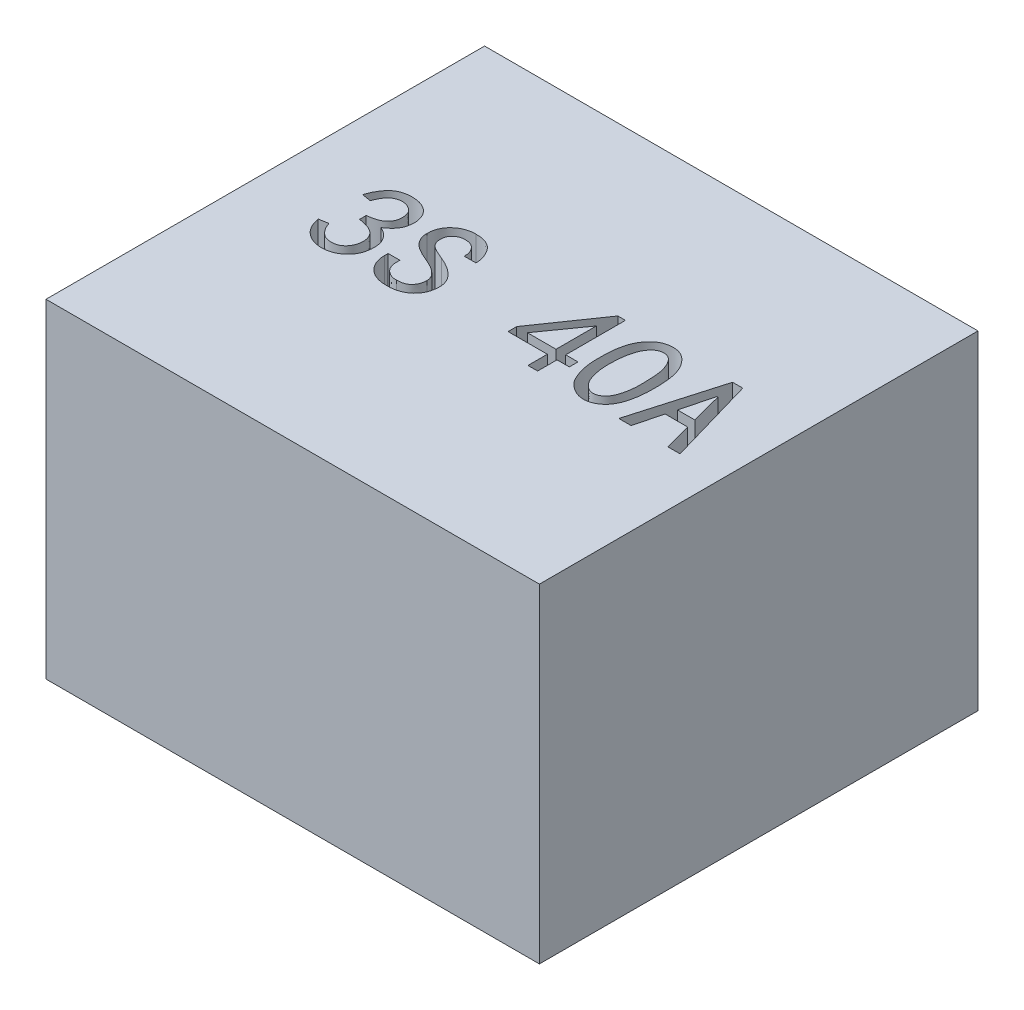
ISO-10303-21;
HEADER;
FILE_DESCRIPTION(('STEP AP214'),'2;1');
FILE_NAME('part.step','',(''),(''),'','','');
FILE_SCHEMA(('AUTOMOTIVE_DESIGN { 1 0 10303 214 1 1 1 1 }'));
ENDSEC;
DATA;
#1=APPLICATION_CONTEXT('core data for automotive mechanical design processes');
#2=APPLICATION_PROTOCOL_DEFINITION('international standard','automotive_design',2000,#1);
#3=PRODUCT_CONTEXT('',#1,'mechanical');
#4=PRODUCT('Part','Part','',(#3));
#5=PRODUCT_RELATED_PRODUCT_CATEGORY('part','',(#4));
#6=PRODUCT_DEFINITION_FORMATION('','',#4);
#7=PRODUCT_DEFINITION_CONTEXT('part definition',#1,'design');
#8=PRODUCT_DEFINITION('design','',#6,#7);
#9=PRODUCT_DEFINITION_SHAPE('','',#8);
#10=(LENGTH_UNIT() NAMED_UNIT(*) SI_UNIT(.MILLI.,.METRE.));
#11=(NAMED_UNIT(*) PLANE_ANGLE_UNIT() SI_UNIT($,.RADIAN.));
#12=(NAMED_UNIT(*) SI_UNIT($,.STERADIAN.) SOLID_ANGLE_UNIT());
#13=UNCERTAINTY_MEASURE_WITH_UNIT(LENGTH_MEASURE(1.E-05),#10,'distance_accuracy_value','');
#14=(GEOMETRIC_REPRESENTATION_CONTEXT(3) GLOBAL_UNCERTAINTY_ASSIGNED_CONTEXT((#13)) GLOBAL_UNIT_ASSIGNED_CONTEXT((#10,
#11,#12)) REPRESENTATION_CONTEXT('',''));
#15=CARTESIAN_POINT('',(0.,0.,0.));
#16=DIRECTION('',(0.,0.,1.));
#17=DIRECTION('',(1.,0.,0.));
#18=AXIS2_PLACEMENT_3D('',#15,#16,#17);
#19=CARTESIAN_POINT('',(0.,48.,0.));
#20=DIRECTION('',(0.,1.,0.));
#21=DIRECTION('',(0.,0.,1.));
#22=AXIS2_PLACEMENT_3D('',#19,#20,#21);
#23=PLANE('',#22);
#24=CARTESIAN_POINT('',(11.771603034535,48.,-1.91061355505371));
#25=CARTESIAN_POINT('',(11.7776911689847,48.,-2.07067415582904));
#26=CARTESIAN_POINT('',(11.7929660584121,48.,-2.3827579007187));
#27=CARTESIAN_POINT('',(11.8323717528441,48.,-2.83788976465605));
#28=CARTESIAN_POINT('',(11.8807611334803,48.,-3.26861426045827));
#29=CARTESIAN_POINT('',(11.9434624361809,48.,-3.67363949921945));
#30=CARTESIAN_POINT('',(12.0210079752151,48.,-4.05161108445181));
#31=CARTESIAN_POINT('',(12.1087686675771,48.,-4.40451144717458));
#32=CARTESIAN_POINT('',(12.2101927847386,48.,-4.73135279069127));
#33=CARTESIAN_POINT('',(12.3595367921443,48.,-5.13052179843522));
#34=CARTESIAN_POINT('',(12.5834855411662,48.,-5.58996048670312));
#35=CARTESIAN_POINT('',(12.9038196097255,48.,-6.09491652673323));
#36=CARTESIAN_POINT('',(13.2760584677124,48.,-6.54883649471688));
#37=CARTESIAN_POINT('',(13.6282082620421,48.,-6.88143850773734));
#38=CARTESIAN_POINT('',(13.9335459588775,48.,-7.11552535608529));
#39=CARTESIAN_POINT('',(14.1775049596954,48.,-7.26751036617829));
#40=CARTESIAN_POINT('',(14.4338069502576,48.,-7.39737011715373));
#41=CARTESIAN_POINT('',(14.703292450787,48.,-7.50327347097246));
#42=CARTESIAN_POINT('',(14.9854659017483,48.,-7.5821612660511));
#43=CARTESIAN_POINT('',(15.2795797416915,48.,-7.64040329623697));
#44=CARTESIAN_POINT('',(15.5866046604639,48.,-7.67643270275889));
#45=CARTESIAN_POINT('',(15.9029787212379,48.,-7.68715189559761));
#46=CARTESIAN_POINT('',(16.2217367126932,48.,-7.67214307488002));
#47=CARTESIAN_POINT('',(16.534870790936,48.,-7.62324855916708));
#48=CARTESIAN_POINT('',(16.8370397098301,48.,-7.53644829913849));
#49=CARTESIAN_POINT('',(17.1284497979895,48.,-7.41728524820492));
#50=CARTESIAN_POINT('',(17.4083079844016,48.,-7.26417549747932));
#51=CARTESIAN_POINT('',(17.6780230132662,48.,-7.0783489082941));
#52=CARTESIAN_POINT('',(17.934397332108,48.,-6.85499976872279));
#53=CARTESIAN_POINT('',(18.180626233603,48.,-6.60319713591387));
#54=CARTESIAN_POINT('',(18.4106112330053,48.,-6.32606829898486));
#55=CARTESIAN_POINT('',(18.6212769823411,48.,-6.02896164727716));
#56=CARTESIAN_POINT('',(18.811748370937,48.,-5.71494178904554));
#57=CARTESIAN_POINT('',(18.9794865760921,48.,-5.38228599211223));
#58=CARTESIAN_POINT('',(19.1298439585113,48.,-5.03392756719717));
#59=CARTESIAN_POINT('',(19.2559804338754,48.,-4.66676359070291));
#60=CARTESIAN_POINT('',(19.360336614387,48.,-4.28228573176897));
#61=CARTESIAN_POINT('',(19.4752491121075,48.,-3.73914331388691));
#62=CARTESIAN_POINT('',(19.5763471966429,48.,-3.01867895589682));
#63=CARTESIAN_POINT('',(19.6475720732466,48.,-2.10684654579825));
#64=CARTESIAN_POINT('',(19.6638244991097,48.,-1.13457779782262));
#65=CARTESIAN_POINT('',(19.6396243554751,48.,-0.293764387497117));
#66=CARTESIAN_POINT('',(19.5940065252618,48.,0.387488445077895));
#67=CARTESIAN_POINT('',(19.5421440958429,48.,0.881609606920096));
#68=CARTESIAN_POINT('',(19.4724838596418,48.,1.35055005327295));
#69=CARTESIAN_POINT('',(19.3913910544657,48.,1.79659238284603));
#70=CARTESIAN_POINT('',(19.2899390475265,48.,2.21736452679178));
#71=CARTESIAN_POINT('',(19.1697173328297,48.,2.61331733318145));
#72=CARTESIAN_POINT('',(19.0398231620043,48.,2.98703744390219));
#73=CARTESIAN_POINT('',(18.8869307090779,48.,3.33459649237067));
#74=CARTESIAN_POINT('',(18.7204068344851,48.,3.65894611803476));
#75=CARTESIAN_POINT('',(18.5305553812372,48.,3.95593155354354));
#76=CARTESIAN_POINT('',(18.3248778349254,48.,4.22956426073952));
#77=CARTESIAN_POINT('',(18.097921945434,48.,4.4776758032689));
#78=CARTESIAN_POINT('',(17.8467308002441,48.,4.69526822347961));
#79=CARTESIAN_POINT('',(17.580043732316,48.,4.89284116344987));
#80=CARTESIAN_POINT('',(17.2906986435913,48.,5.06099798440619));
#81=CARTESIAN_POINT('',(16.9864057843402,48.,5.20369542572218));
#82=CARTESIAN_POINT('',(16.6730070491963,48.,5.31726440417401));
#83=CARTESIAN_POINT('',(16.3544150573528,48.,5.3912853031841));
#84=CARTESIAN_POINT('',(16.036639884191,48.,5.43528034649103));
#85=CARTESIAN_POINT('',(15.7174422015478,48.,5.43544129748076));
#86=CARTESIAN_POINT('',(15.3987131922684,48.,5.40768852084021));
#87=CARTESIAN_POINT('',(15.0817618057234,48.,5.33468327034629));
#88=CARTESIAN_POINT('',(14.7626785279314,48.,5.23430895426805));
#89=CARTESIAN_POINT('',(14.4500101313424,48.,5.09236065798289));
#90=CARTESIAN_POINT('',(14.1490741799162,48.,4.9289143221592));
#91=CARTESIAN_POINT('',(13.8658132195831,48.,4.75299695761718));
#92=CARTESIAN_POINT('',(13.6079683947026,48.,4.56157363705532));
#93=CARTESIAN_POINT('',(13.3734794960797,48.,4.35714930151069));
#94=CARTESIAN_POINT('',(13.1594213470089,48.,4.14144032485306));
#95=CARTESIAN_POINT('',(12.9683201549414,48.,3.91239891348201));
#96=CARTESIAN_POINT('',(12.8021594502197,48.,3.66939086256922));
#97=CARTESIAN_POINT('',(12.6164778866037,48.,3.3273893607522));
#98=CARTESIAN_POINT('',(12.4175536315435,48.,2.88624885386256));
#99=CARTESIAN_POINT('',(12.2116681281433,48.,2.34286970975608));
#100=CARTESIAN_POINT('',(12.0433972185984,48.,1.78642026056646));
#101=CARTESIAN_POINT('',(11.9351955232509,48.,1.30823442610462));
#102=CARTESIAN_POINT('',(11.8638584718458,48.,0.908195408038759));
#103=CARTESIAN_POINT('',(11.8246081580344,48.,0.580262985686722));
#104=CARTESIAN_POINT('',(11.7905157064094,48.,0.227256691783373));
#105=CARTESIAN_POINT('',(11.7699020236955,48.,-0.150906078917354));
#106=CARTESIAN_POINT('',(11.7562286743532,48.,-0.554551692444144));
#107=CARTESIAN_POINT('',(11.7501284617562,48.,-0.983973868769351));
#108=CARTESIAN_POINT('',(11.7570620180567,48.,-1.43909747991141));
#109=CARTESIAN_POINT('',(11.7655205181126,48.,-1.7507006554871));
#110=CARTESIAN_POINT('',(11.771603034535,48.,-1.91061355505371));
#111=B_SPLINE_CURVE_WITH_KNOTS('',3,(#24,#25,#26,#27,#28,#29,#30,#31,#32,#33,#34,#35,#36,#37,
#38,#39,#40,#41,#42,#43,#44,#45,#46,#47,#48,#49,#50,#51,#52,#53,#54,#55,#56,#57,#58,#59,#60,#61,
#62,#63,#64,#65,#66,#67,#68,#69,#70,#71,#72,#73,#74,#75,#76,#77,#78,#79,#80,#81,#82,#83,#84,#85,
#86,#87,#88,#89,#90,#91,#92,#93,#94,#95,#96,#97,#98,#99,#100,#101,#102,#103,#104,#105,#106,#107,
#108,#109,#110),.UNSPECIFIED.,.T.,.F.,(4,1,1,1,1,1,1,1,1,1,1,1,1,1,1,1,1,1,1,1,1,1,1,1,1,1,1,1,
1,1,1,1,1,1,1,1,1,1,1,1,1,1,1,1,1,1,1,1,1,1,1,1,1,1,1,1,1,1,1,1,1,1,1,1,1,1,1,1,1,1,1,1,1,1,1,1,
1,1,1,1,1,1,1,1,4),(0.,0.0140527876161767,0.0274087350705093,0.0400744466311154,
0.052075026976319,0.063353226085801,0.0739166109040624,0.0839678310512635,0.0933606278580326,
0.111288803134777,0.128696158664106,0.145715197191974,0.162661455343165,0.171065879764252,
0.179435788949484,0.187840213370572,0.196242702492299,0.204795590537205,0.213511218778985,
0.222525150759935,0.23188672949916,0.241255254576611,0.250484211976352,0.259624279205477,
0.268775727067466,0.278051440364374,0.287559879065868,0.297454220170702,0.307834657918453,
0.318430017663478,0.329015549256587,0.339763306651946,0.350620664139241,0.361677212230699,
0.373027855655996,0.384650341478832,0.396609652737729,0.421715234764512,0.448413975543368,
0.476810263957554,0.506988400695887,0.522187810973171,0.536706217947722,0.550565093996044,
0.563774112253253,0.576470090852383,0.588513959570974,0.600070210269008,0.61115877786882,
0.621801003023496,0.632026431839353,0.642043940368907,0.651804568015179,0.661463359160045,
0.671158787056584,0.680883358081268,0.690769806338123,0.700617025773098,0.710066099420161,
0.719420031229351,0.728695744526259,0.738013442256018,0.747426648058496,0.757170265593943,
0.767316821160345,0.777493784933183,0.787205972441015,0.796545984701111,0.805635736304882,
0.814475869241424,0.823181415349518,0.831771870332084,0.840256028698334,0.857290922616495,
0.874188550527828,0.891207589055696,0.908249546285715,0.917173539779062,0.926847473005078,
0.937216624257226,0.948285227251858,0.960067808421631,0.972651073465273,0.985960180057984,1.),.UNSPECIFIED.);
#112=CARTESIAN_POINT('',(11.771603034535,48.,-1.91061355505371));
#113=VERTEX_POINT('',#112);
#114=EDGE_CURVE('E693',#113,#113,#111,.T.);
#115=ORIENTED_EDGE('',*,*,#114,.T.);
#116=EDGE_LOOP('',(#115));
#117=FACE_BOUND('',#116,.T.);
#118=DIRECTION('',(0.,0.,-1.));
#119=VECTOR('',#118,1.);
#120=CARTESIAN_POINT('',(36.,48.,-32.));
#121=LINE('',#120,#119);
#122=CARTESIAN_POINT('',(36.,48.,32.));
#123=VERTEX_POINT('',#122);
#124=CARTESIAN_POINT('',(36.,48.,-32.));
#125=VERTEX_POINT('',#124);
#126=EDGE_CURVE('E819',#123,#125,#121,.T.);
#127=ORIENTED_EDGE('',*,*,#126,.T.);
#128=DIRECTION('',(-1.,0.,0.));
#129=VECTOR('',#128,1.);
#130=CARTESIAN_POINT('',(-36.,48.,-32.));
#131=LINE('',#130,#129);
#132=CARTESIAN_POINT('',(-36.,48.,-32.));
#133=VERTEX_POINT('',#132);
#134=EDGE_CURVE('E836',#125,#133,#131,.T.);
#135=ORIENTED_EDGE('',*,*,#134,.T.);
#136=DIRECTION('',(0.,0.,1.));
#137=VECTOR('',#136,1.);
#138=CARTESIAN_POINT('',(-36.,48.,-32.));
#139=LINE('',#138,#137);
#140=CARTESIAN_POINT('',(-36.,48.,32.));
#141=VERTEX_POINT('',#140);
#142=EDGE_CURVE('E811',#133,#141,#139,.T.);
#143=ORIENTED_EDGE('',*,*,#142,.T.);
#144=DIRECTION('',(1.,0.,0.));
#145=VECTOR('',#144,1.);
#146=CARTESIAN_POINT('',(-36.,48.,32.));
#147=LINE('',#146,#145);
#148=EDGE_CURVE('E826',#141,#123,#147,.T.);
#149=ORIENTED_EDGE('',*,*,#148,.T.);
#150=EDGE_LOOP('',(#127,#135,#143,#149));
#151=FACE_BOUND('',#150,.T.);
#152=DIRECTION('',(1.,0.,0.));
#153=VECTOR('',#152,1.);
#154=CARTESIAN_POINT('',(24.579138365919,48.,-7.60836721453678));
#155=LINE('',#154,#153);
#156=CARTESIAN_POINT('',(24.579138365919,48.,-7.60836721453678));
#157=VERTEX_POINT('',#156);
#158=CARTESIAN_POINT('',(26.068386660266,48.,-7.60836721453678));
#159=VERTEX_POINT('',#158);
#160=EDGE_CURVE('E892',#157,#159,#155,.T.);
#161=ORIENTED_EDGE('',*,*,#160,.T.);
#162=DIRECTION('',(0.277653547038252,0.,0.960681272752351));
#163=VECTOR('',#162,1.);
#164=CARTESIAN_POINT('',(26.068386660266,48.,-7.60836721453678));
#165=LINE('',#164,#163);
#166=CARTESIAN_POINT('',(29.7915073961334,48.,5.27363053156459));
#167=VERTEX_POINT('',#166);
#168=EDGE_CURVE('E879',#159,#167,#165,.T.);
#169=ORIENTED_EDGE('',*,*,#168,.T.);
#170=DIRECTION('',(-1.,0.,0.));
#171=VECTOR('',#170,1.);
#172=CARTESIAN_POINT('',(29.7915073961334,48.,5.27363053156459));
#173=LINE('',#172,#171);
#174=CARTESIAN_POINT('',(28.0044094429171,48.,5.27363053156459));
#175=VERTEX_POINT('',#174);
#176=EDGE_CURVE('E918',#167,#175,#173,.T.);
#177=ORIENTED_EDGE('',*,*,#176,.T.);
#178=DIRECTION('',(-0.255391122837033,0.,-0.966837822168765));
#179=VECTOR('',#178,1.);
#180=CARTESIAN_POINT('',(28.0044094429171,48.,5.27363053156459));
#181=LINE('',#180,#179);
#182=CARTESIAN_POINT('',(26.9619356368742,48.,1.32712255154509));
#183=VERTEX_POINT('',#182);
#184=EDGE_CURVE('E922',#175,#183,#181,.T.);
#185=ORIENTED_EDGE('',*,*,#184,.T.);
#186=DIRECTION('',(-1.,0.,0.));
#187=VECTOR('',#186,1.);
#188=CARTESIAN_POINT('',(26.9619356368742,48.,1.32712255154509));
#189=LINE('',#188,#187);
#190=CARTESIAN_POINT('',(23.6855893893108,48.,1.32712255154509));
#191=VERTEX_POINT('',#190);
#192=EDGE_CURVE('E926',#183,#191,#189,.T.);
#193=ORIENTED_EDGE('',*,*,#192,.T.);
#194=DIRECTION('',(-0.255391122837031,0.,0.966837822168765));
#195=VECTOR('',#194,1.);
#196=CARTESIAN_POINT('',(23.6855893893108,48.,1.32712255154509));
#197=LINE('',#196,#195);
#198=CARTESIAN_POINT('',(22.6431155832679,48.,5.27363053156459));
#199=VERTEX_POINT('',#198);
#200=EDGE_CURVE('E930',#191,#199,#197,.T.);
#201=ORIENTED_EDGE('',*,*,#200,.T.);
#202=DIRECTION('',(-1.,0.,0.));
#203=VECTOR('',#202,1.);
#204=CARTESIAN_POINT('',(22.6431155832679,48.,5.27363053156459));
#205=LINE('',#204,#203);
#206=CARTESIAN_POINT('',(20.8560176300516,48.,5.27363053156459));
#207=VERTEX_POINT('',#206);
#208=EDGE_CURVE('E934',#199,#207,#205,.T.);
#209=ORIENTED_EDGE('',*,*,#208,.T.);
#210=DIRECTION('',(0.277653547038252,0.,-0.960681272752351));
#211=VECTOR('',#210,1.);
#212=CARTESIAN_POINT('',(20.8560176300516,48.,5.27363053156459));
#213=LINE('',#212,#211);
#214=EDGE_CURVE('E938',#207,#157,#213,.T.);
#215=ORIENTED_EDGE('',*,*,#214,.T.);
#216=EDGE_LOOP('',(#161,#169,#177,#185,#193,#201,#209,#215));
#217=FACE_BOUND('',#216,.T.);
#218=DIRECTION('',(-1.,0.,0.));
#219=VECTOR('',#218,1.);
#220=CARTESIAN_POINT('',(8.94203127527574,48.,5.19916811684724));
#221=LINE('',#220,#219);
#222=CARTESIAN_POINT('',(8.94203127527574,48.,5.19916811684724));
#223=VERTEX_POINT('',#222);
#224=CARTESIAN_POINT('',(7.52724539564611,48.,5.19916811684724));
#225=VERTEX_POINT('',#224);
#226=EDGE_CURVE('E995',#223,#225,#221,.T.);
#227=ORIENTED_EDGE('',*,*,#226,.T.);
#228=DIRECTION('',(0.,0.,-1.));
#229=VECTOR('',#228,1.);
#230=CARTESIAN_POINT('',(7.52724539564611,48.,5.19916811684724));
#231=LINE('',#230,#229);
#232=CARTESIAN_POINT('',(7.52724539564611,48.,2.36959635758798));
#233=VERTEX_POINT('',#232);
#234=EDGE_CURVE('E1216',#225,#233,#231,.T.);
#235=ORIENTED_EDGE('',*,*,#234,.T.);
#236=DIRECTION('',(-1.,0.,0.));
#237=VECTOR('',#236,1.);
#238=CARTESIAN_POINT('',(7.52724539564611,48.,2.36959635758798));
#239=LINE('',#238,#237);
#240=CARTESIAN_POINT('',(1.79363946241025,48.,2.36959635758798));
#241=VERTEX_POINT('',#240);
#242=EDGE_CURVE('E1212',#233,#241,#239,.T.);
#243=ORIENTED_EDGE('',*,*,#242,.T.);
#244=DIRECTION('',(0.,0.,-1.));
#245=VECTOR('',#244,1.);
#246=CARTESIAN_POINT('',(1.79363946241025,48.,2.36959635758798));
#247=LINE('',#246,#245);
#248=CARTESIAN_POINT('',(1.79363946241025,48.,1.10373530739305));
#249=VERTEX_POINT('',#248);
#250=EDGE_CURVE('E1208',#241,#249,#247,.T.);
#251=ORIENTED_EDGE('',*,*,#250,.T.);
#252=DIRECTION('',(0.569209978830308,0.,-0.822192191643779));
#253=VECTOR('',#252,1.);
#254=CARTESIAN_POINT('',(1.79363946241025,48.,1.10373530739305));
#255=LINE('',#254,#253);
#256=CARTESIAN_POINT('',(7.82509505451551,48.,-7.60836721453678));
#257=VERTEX_POINT('',#256);
#258=EDGE_CURVE('E1204',#249,#257,#255,.T.);
#259=ORIENTED_EDGE('',*,*,#258,.T.);
#260=DIRECTION('',(1.,0.,0.));
#261=VECTOR('',#260,1.);
#262=CARTESIAN_POINT('',(7.82509505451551,48.,-7.60836721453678));
#263=LINE('',#262,#261);
#264=CARTESIAN_POINT('',(8.94203127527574,48.,-7.60836721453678));
#265=VERTEX_POINT('',#264);
#266=EDGE_CURVE('E1200',#257,#265,#263,.T.);
#267=ORIENTED_EDGE('',*,*,#266,.T.);
#268=DIRECTION('',(0.,0.,1.));
#269=VECTOR('',#268,1.);
#270=CARTESIAN_POINT('',(8.94203127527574,48.,-7.60836721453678));
#271=LINE('',#270,#269);
#272=CARTESIAN_POINT('',(8.94203127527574,48.,1.10373530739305));
#273=VERTEX_POINT('',#272);
#274=EDGE_CURVE('E1196',#265,#273,#271,.T.);
#275=ORIENTED_EDGE('',*,*,#274,.T.);
#276=DIRECTION('',(1.,0.,0.));
#277=VECTOR('',#276,1.);
#278=CARTESIAN_POINT('',(8.94203127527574,48.,1.10373530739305));
#279=LINE('',#278,#277);
#280=CARTESIAN_POINT('',(10.7291292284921,48.,1.10373530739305));
#281=VERTEX_POINT('',#280);
#282=EDGE_CURVE('E1192',#273,#281,#279,.T.);
#283=ORIENTED_EDGE('',*,*,#282,.T.);
#284=DIRECTION('',(0.,0.,1.));
#285=VECTOR('',#284,1.);
#286=CARTESIAN_POINT('',(10.7291292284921,48.,1.10373530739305));
#287=LINE('',#286,#285);
#288=CARTESIAN_POINT('',(10.7291292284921,48.,2.36959635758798));
#289=VERTEX_POINT('',#288);
#290=EDGE_CURVE('E1188',#281,#289,#287,.T.);
#291=ORIENTED_EDGE('',*,*,#290,.T.);
#292=DIRECTION('',(-1.,0.,0.));
#293=VECTOR('',#292,1.);
#294=CARTESIAN_POINT('',(10.7291292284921,48.,2.36959635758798));
#295=LINE('',#294,#293);
#296=CARTESIAN_POINT('',(8.94203127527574,48.,2.36959635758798));
#297=VERTEX_POINT('',#296);
#298=EDGE_CURVE('E1184',#289,#297,#295,.T.);
#299=ORIENTED_EDGE('',*,*,#298,.T.);
#300=DIRECTION('',(0.,0.,1.));
#301=VECTOR('',#300,1.);
#302=CARTESIAN_POINT('',(8.94203127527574,48.,2.36959635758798));
#303=LINE('',#302,#301);
#304=EDGE_CURVE('E1180',#297,#223,#303,.T.);
#305=ORIENTED_EDGE('',*,*,#304,.T.);
#306=EDGE_LOOP('',(#227,#235,#243,#251,#259,#267,#275,#283,#291,#299,#305));
#307=FACE_BOUND('',#306,.T.);
#308=CARTESIAN_POINT('',(-14.8114790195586,48.,-4.33202096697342));
#309=CARTESIAN_POINT('',(-14.807228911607,48.,-4.22395491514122));
#310=CARTESIAN_POINT('',(-14.7989027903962,48.,-4.01224945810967));
#311=CARTESIAN_POINT('',(-14.7178684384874,48.,-3.70703190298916));
#312=CARTESIAN_POINT('',(-14.5901300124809,48.,-3.42444551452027));
#313=CARTESIAN_POINT('',(-14.4382771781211,48.,-3.20567613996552));
#314=CARTESIAN_POINT('',(-14.2735422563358,48.,-3.04237265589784));
#315=CARTESIAN_POINT('',(-14.1084132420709,48.,-2.91293456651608));
#316=CARTESIAN_POINT('',(-13.9029658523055,48.,-2.77868033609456));
#317=CARTESIAN_POINT('',(-13.6567484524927,48.,-2.63844098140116));
#318=CARTESIAN_POINT('',(-13.3690984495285,48.,-2.49432695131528));
#319=CARTESIAN_POINT('',(-13.0441952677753,48.,-2.33820560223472));
#320=CARTESIAN_POINT('',(-12.6755957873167,48.,-2.18281376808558));
#321=CARTESIAN_POINT('',(-12.415967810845,48.,-2.07844303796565));
#322=CARTESIAN_POINT('',(-12.2797569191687,48.,-2.02368611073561));
#323=B_SPLINE_CURVE_WITH_KNOTS('',3,(#308,#309,#310,#311,#312,#313,#314,#315,#316,#317,#318,
#319,#320,#321,#322),.UNSPECIFIED.,.F.,.F.,(4,1,1,1,1,1,1,1,1,1,1,1,4),(0.,0.0878564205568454,
0.172114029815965,0.255205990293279,0.339543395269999,0.387190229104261,0.443666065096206,
0.510114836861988,0.586913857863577,0.674306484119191,0.772096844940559,0.880433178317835,1.),.UNSPECIFIED.);
#324=CARTESIAN_POINT('',(-14.8114790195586,48.,-4.33202096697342));
#325=VERTEX_POINT('',#324);
#326=CARTESIAN_POINT('',(-12.2797569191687,48.,-2.02368611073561));
#327=VERTEX_POINT('',#326);
#328=EDGE_CURVE('E467',#325,#327,#323,.T.);
#329=ORIENTED_EDGE('',*,*,#328,.T.);
#330=CARTESIAN_POINT('',(-12.2797569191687,48.,-2.02368611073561));
#331=CARTESIAN_POINT('',(-12.1469310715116,48.,-1.9677154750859));
#332=CARTESIAN_POINT('',(-11.8864009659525,48.,-1.85793235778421));
#333=CARTESIAN_POINT('',(-11.5102946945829,48.,-1.6788072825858));
#334=CARTESIAN_POINT('',(-11.1588192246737,48.,-1.48837951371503));
#335=CARTESIAN_POINT('',(-10.8290737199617,48.,-1.29338467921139));
#336=CARTESIAN_POINT('',(-10.524729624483,48.,-1.08837109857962));
#337=CARTESIAN_POINT('',(-10.2427802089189,48.,-0.875986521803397));
#338=CARTESIAN_POINT('',(-9.98301741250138,48.,-0.656010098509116));
#339=CARTESIAN_POINT('',(-9.74765749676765,48.,-0.426818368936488));
#340=CARTESIAN_POINT('',(-9.53841690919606,48.,-0.189967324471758));
#341=CARTESIAN_POINT('',(-9.35281697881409,48.,0.052985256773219));
#342=CARTESIAN_POINT('',(-9.20234146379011,48.,0.309231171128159));
#343=CARTESIAN_POINT('',(-9.07353268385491,48.,0.569943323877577));
#344=CARTESIAN_POINT('',(-8.97715500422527,48.,0.841608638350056));
#345=CARTESIAN_POINT('',(-8.90451027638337,48.,1.11896710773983));
#346=CARTESIAN_POINT('',(-8.86224902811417,48.,1.40672315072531));
#347=CARTESIAN_POINT('',(-8.85709820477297,48.,1.60093530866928));
#348=CARTESIAN_POINT('',(-8.85448584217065,48.,1.69943462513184));
#349=B_SPLINE_CURVE_WITH_KNOTS('',3,(#330,#331,#332,#333,#334,#335,#336,#337,#338,#339,#340,
#341,#342,#343,#344,#345,#346,#347,#348),.UNSPECIFIED.,.F.,.F.,(4,1,1,1,1,1,1,1,1,1,1,1,1,1,1,1,
4),(0.,0.0803903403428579,0.157680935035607,0.232242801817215,0.303296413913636,
0.371275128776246,0.436805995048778,0.500097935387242,0.561014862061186,0.61986382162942,
0.676267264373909,0.731228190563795,0.785350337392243,0.838226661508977,0.891703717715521,
0.945074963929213,1.),.UNSPECIFIED.);
#350=CARTESIAN_POINT('',(-8.85448584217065,48.,1.69943462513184));
#351=VERTEX_POINT('',#350);
#352=EDGE_CURVE('E67',#327,#351,#349,.T.);
#353=ORIENTED_EDGE('',*,*,#352,.T.);
#354=CARTESIAN_POINT('',(-8.85448584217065,48.,1.69943462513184));
#355=CARTESIAN_POINT('',(-8.85754814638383,48.,1.83839374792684));
#356=CARTESIAN_POINT('',(-8.86353109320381,48.,2.10988377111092));
#357=CARTESIAN_POINT('',(-8.91370896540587,48.,2.50716825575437));
#358=CARTESIAN_POINT('',(-8.99859077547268,48.,2.88226225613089));
#359=CARTESIAN_POINT('',(-9.11768847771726,48.,3.23541349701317));
#360=CARTESIAN_POINT('',(-9.26993708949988,48.,3.56569422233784));
#361=CARTESIAN_POINT('',(-9.45644048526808,48.,3.87485381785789));
#362=CARTESIAN_POINT('',(-9.67714544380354,48.,4.16204385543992));
#363=CARTESIAN_POINT('',(-9.93163195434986,48.,4.42366717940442));
#364=CARTESIAN_POINT('',(-10.2133520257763,48.,4.6588063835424));
#365=CARTESIAN_POINT('',(-10.5214543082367,48.,4.86359580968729));
#366=CARTESIAN_POINT('',(-10.8536564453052,48.,5.03864814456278));
#367=CARTESIAN_POINT('',(-11.212184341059,48.,5.17853468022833));
#368=CARTESIAN_POINT('',(-11.5932298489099,48.,5.28939112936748));
#369=CARTESIAN_POINT('',(-11.9996780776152,48.,5.36544633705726));
#370=CARTESIAN_POINT('',(-12.4293891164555,48.,5.4129862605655));
#371=CARTESIAN_POINT('',(-12.7245647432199,48.,5.41931841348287));
#372=CARTESIAN_POINT('',(-12.8754562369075,48.,5.42255536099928));
#373=B_SPLINE_CURVE_WITH_KNOTS('',3,(#354,#355,#356,#357,#358,#359,#360,#361,#362,#363,#364,
#365,#366,#367,#368,#369,#370,#371,#372),.UNSPECIFIED.,.F.,.F.,(4,1,1,1,1,1,1,1,1,1,1,1,1,1,1,1,
4),(0.,0.0672590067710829,0.131406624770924,0.193489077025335,0.253165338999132,
0.311512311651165,0.36921748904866,0.427615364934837,0.486474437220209,0.545568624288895,
0.604943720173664,0.665265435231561,0.727003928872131,0.790952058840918,0.857116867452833,
0.926959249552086,1.),.UNSPECIFIED.);
#374=CARTESIAN_POINT('',(-12.8754562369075,48.,5.42255536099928));
#375=VERTEX_POINT('',#374);
#376=EDGE_CURVE('E571',#351,#375,#373,.T.);
#377=ORIENTED_EDGE('',*,*,#376,.T.);
#378=CARTESIAN_POINT('',(-12.8754562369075,48.,5.42255536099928));
#379=CARTESIAN_POINT('',(-13.0263801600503,48.,5.41962686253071));
#380=CARTESIAN_POINT('',(-13.3208081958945,48.,5.41391383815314));
#381=CARTESIAN_POINT('',(-13.7485475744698,48.,5.36237924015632));
#382=CARTESIAN_POINT('',(-14.1528048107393,48.,5.28459644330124));
#383=CARTESIAN_POINT('',(-14.5299188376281,48.,5.16770042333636));
#384=CARTESIAN_POINT('',(-14.8834700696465,48.,5.02288488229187));
#385=CARTESIAN_POINT('',(-15.2078467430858,48.,4.84011029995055));
#386=CARTESIAN_POINT('',(-15.5121549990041,48.,4.63230742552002));
#387=CARTESIAN_POINT('',(-15.7817962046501,48.,4.38429672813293));
#388=CARTESIAN_POINT('',(-16.0292163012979,48.,4.11946850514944));
#389=CARTESIAN_POINT('',(-16.2374677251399,48.,3.82975148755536));
#390=CARTESIAN_POINT('',(-16.4197392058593,48.,3.52858536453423));
#391=CARTESIAN_POINT('',(-16.5651711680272,48.,3.20865546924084));
#392=CARTESIAN_POINT('',(-16.6834508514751,48.,2.87435929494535));
#393=CARTESIAN_POINT('',(-16.7608993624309,48.,2.52128176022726));
#394=CARTESIAN_POINT('',(-16.8131898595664,48.,2.15328765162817));
#395=CARTESIAN_POINT('',(-16.8190045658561,48.,1.90186810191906));
#396=CARTESIAN_POINT('',(-16.821964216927,48.,1.77389703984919));
#397=B_SPLINE_CURVE_WITH_KNOTS('',3,(#378,#379,#380,#381,#382,#383,#384,#385,#386,#387,#388,
#389,#390,#391,#392,#393,#394,#395,#396),.UNSPECIFIED.,.F.,.F.,(4,1,1,1,1,1,1,1,1,1,1,1,1,1,1,1,
4),(0.,0.0747836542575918,0.145890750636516,0.213274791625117,0.278572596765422,
0.341282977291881,0.4022743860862,0.462826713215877,0.523490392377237,0.583479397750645,
0.64217718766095,0.700008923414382,0.757711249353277,0.816077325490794,0.875439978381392,
0.936599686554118,1.),.UNSPECIFIED.);
#398=CARTESIAN_POINT('',(-16.821964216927,48.,1.77389703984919));
#399=VERTEX_POINT('',#398);
#400=EDGE_CURVE('E565',#375,#399,#397,.T.);
#401=ORIENTED_EDGE('',*,*,#400,.T.);
#402=DIRECTION('',(0.,0.,-1.));
#403=VECTOR('',#402,1.);
#404=CARTESIAN_POINT('',(-16.821964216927,48.,1.77389703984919));
#405=LINE('',#404,#403);
#406=CARTESIAN_POINT('',(-16.821964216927,48.,1.25266013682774));
#407=VERTEX_POINT('',#406);
#408=EDGE_CURVE('E561',#399,#407,#405,.T.);
#409=ORIENTED_EDGE('',*,*,#408,.T.);
#410=DIRECTION('',(1.,0.,0.));
#411=VECTOR('',#410,1.);
#412=CARTESIAN_POINT('',(-16.821964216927,48.,1.25266013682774));
#413=LINE('',#412,#411);
#414=CARTESIAN_POINT('',(-15.109328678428,48.,1.25266013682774));
#415=VERTEX_POINT('',#414);
#416=EDGE_CURVE('E557',#407,#415,#413,.T.);
#417=ORIENTED_EDGE('',*,*,#416,.T.);
#418=DIRECTION('',(0.,0.,1.));
#419=VECTOR('',#418,1.);
#420=CARTESIAN_POINT('',(-15.109328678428,48.,1.25266013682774));
#421=LINE('',#420,#419);
#422=CARTESIAN_POINT('',(-15.109328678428,48.,1.69943462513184));
#423=VERTEX_POINT('',#422);
#424=EDGE_CURVE('E550',#415,#423,#421,.T.);
#425=ORIENTED_EDGE('',*,*,#424,.T.);
#426=CARTESIAN_POINT('',(-15.109328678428,48.,1.69943462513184));
#427=CARTESIAN_POINT('',(-15.1070237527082,48.,1.78959909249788));
#428=CARTESIAN_POINT('',(-15.1025180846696,48.,1.96585256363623));
#429=CARTESIAN_POINT('',(-15.0729856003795,48.,2.22183024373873));
#430=CARTESIAN_POINT('',(-15.0202388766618,48.,2.46207844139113));
#431=CARTESIAN_POINT('',(-14.9462726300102,48.,2.6848670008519));
#432=CARTESIAN_POINT('',(-14.8515948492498,48.,2.89241961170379));
#433=CARTESIAN_POINT('',(-14.7353003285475,48.,3.0826394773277));
#434=CARTESIAN_POINT('',(-14.5996016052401,48.,3.25872239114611));
#435=CARTESIAN_POINT('',(-14.3909039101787,48.,3.46497399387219));
#436=CARTESIAN_POINT('',(-14.0995590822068,48.,3.67821374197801));
#437=CARTESIAN_POINT('',(-13.7190908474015,48.,3.87230717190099));
#438=CARTESIAN_POINT('',(-13.3055792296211,48.,3.98509562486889));
#439=CARTESIAN_POINT('',(-13.0204489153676,48.,4.00012621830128));
#440=CARTESIAN_POINT('',(-12.8754562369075,48.,4.00776948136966));
#441=B_SPLINE_CURVE_WITH_KNOTS('',3,(#426,#427,#428,#429,#430,#431,#432,#433,#434,#435,#436,
#437,#438,#439,#440),.UNSPECIFIED.,.F.,.F.,(4,1,1,1,1,1,1,1,1,1,1,1,4),(0.,0.0749947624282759,
0.146599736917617,0.213942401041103,0.279226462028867,0.341494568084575,0.403258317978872,
0.464284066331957,0.525919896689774,0.646731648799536,0.762993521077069,0.879478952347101,1.),.UNSPECIFIED.);
#442=CARTESIAN_POINT('',(-12.8754562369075,48.,4.00776948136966));
#443=VERTEX_POINT('',#442);
#444=EDGE_CURVE('E541',#423,#443,#441,.T.);
#445=ORIENTED_EDGE('',*,*,#444,.T.);
#446=CARTESIAN_POINT('',(-12.8754562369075,48.,4.00776948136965));
#447=CARTESIAN_POINT('',(-12.7798058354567,48.,4.00520480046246));
#448=CARTESIAN_POINT('',(-12.5936222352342,48.,4.00021264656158));
#449=CARTESIAN_POINT('',(-12.3238196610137,48.,3.9745848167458));
#450=CARTESIAN_POINT('',(-12.0738294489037,48.,3.92418429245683));
#451=CARTESIAN_POINT('',(-11.8442863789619,48.,3.85627722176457));
#452=CARTESIAN_POINT('',(-11.6337390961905,48.,3.76728721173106));
#453=CARTESIAN_POINT('',(-11.4445674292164,48.,3.65703576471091));
#454=CARTESIAN_POINT('',(-11.2722215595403,48.,3.52934966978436));
#455=CARTESIAN_POINT('',(-11.0769650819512,48.,3.32976023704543));
#456=CARTESIAN_POINT('',(-10.8711918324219,48.,3.05182599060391));
#457=CARTESIAN_POINT('',(-10.6960570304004,48.,2.67846359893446));
#458=CARTESIAN_POINT('',(-10.5866539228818,48.,2.27369544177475));
#459=CARTESIAN_POINT('',(-10.5737394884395,48.,1.99247379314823));
#460=CARTESIAN_POINT('',(-10.5671213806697,48.,1.84835945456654));
#461=B_SPLINE_CURVE_WITH_KNOTS('',3,(#446,#447,#448,#449,#450,#451,#452,#453,#454,#455,#456,
#457,#458,#459,#460),.UNSPECIFIED.,.F.,.F.,(4,1,1,1,1,1,1,1,1,1,1,1,4),(0.,0.0801849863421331,
0.156080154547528,0.226792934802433,0.293577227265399,0.35639997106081,0.417847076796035,
0.476708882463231,0.535545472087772,0.651270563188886,0.764653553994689,0.879394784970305,1.),.UNSPECIFIED.);
#462=CARTESIAN_POINT('',(-10.5671213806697,48.,1.84835945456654));
#463=VERTEX_POINT('',#462);
#464=EDGE_CURVE('E532',#443,#463,#461,.T.);
#465=ORIENTED_EDGE('',*,*,#464,.T.);
#466=CARTESIAN_POINT('',(-10.5671213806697,48.,1.84835945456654));
#467=CARTESIAN_POINT('',(-10.569403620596,48.,1.78664172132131));
#468=CARTESIAN_POINT('',(-10.5739274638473,48.,1.66430517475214));
#469=CARTESIAN_POINT('',(-10.6055654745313,48.,1.48192841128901));
#470=CARTESIAN_POINT('',(-10.6573664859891,48.,1.30299216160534));
#471=CARTESIAN_POINT('',(-10.7330291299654,48.,1.12880025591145));
#472=CARTESIAN_POINT('',(-10.8285214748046,48.,0.958137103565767));
#473=CARTESIAN_POINT('',(-10.9439273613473,48.,0.791029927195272));
#474=CARTESIAN_POINT('',(-11.0806474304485,48.,0.626890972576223));
#475=CARTESIAN_POINT('',(-11.2964457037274,48.,0.408779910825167));
#476=CARTESIAN_POINT('',(-11.6190142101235,48.,0.145971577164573));
#477=CARTESIAN_POINT('',(-12.0676370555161,48.,-0.151597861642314));
#478=CARTESIAN_POINT('',(-12.5921283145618,48.,-0.43263680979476));
#479=CARTESIAN_POINT('',(-12.9733845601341,48.,-0.597114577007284));
#480=CARTESIAN_POINT('',(-13.1733058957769,48.,-0.683362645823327));
#481=B_SPLINE_CURVE_WITH_KNOTS('',3,(#466,#467,#468,#469,#470,#471,#472,#473,#474,#475,#476,
#477,#478,#479,#480),.UNSPECIFIED.,.F.,.F.,(4,1,1,1,1,1,1,1,1,1,1,1,4),(0.,0.0481876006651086,
0.095517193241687,0.14413607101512,0.193345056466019,0.243482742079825,0.296653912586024,
0.351715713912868,0.410098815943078,0.536033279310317,0.675815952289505,0.830005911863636,1.),.UNSPECIFIED.);
#482=CARTESIAN_POINT('',(-13.1733058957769,48.,-0.683362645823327));
#483=VERTEX_POINT('',#482);
#484=EDGE_CURVE('E523',#463,#483,#481,.T.);
#485=ORIENTED_EDGE('',*,*,#484,.T.);
#486=CARTESIAN_POINT('',(-13.1733058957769,48.,-0.683362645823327));
#487=CARTESIAN_POINT('',(-13.3170872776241,48.,-0.739442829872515));
#488=CARTESIAN_POINT('',(-13.5962784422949,48.,-0.848337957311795));
#489=CARTESIAN_POINT('',(-13.9968968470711,48.,-1.02207833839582));
#490=CARTESIAN_POINT('',(-14.3667311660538,48.,-1.19993748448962));
#491=CARTESIAN_POINT('',(-14.7034759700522,48.,-1.38587548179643));
#492=CARTESIAN_POINT('',(-15.0109015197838,48.,-1.57173847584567));
#493=CARTESIAN_POINT('',(-15.2854568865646,48.,-1.76543316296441));
#494=CARTESIAN_POINT('',(-15.5280613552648,48.,-1.9642579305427));
#495=CARTESIAN_POINT('',(-15.7441224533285,48.,-2.16524286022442));
#496=CARTESIAN_POINT('',(-15.9263385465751,48.,-2.37850720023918));
#497=CARTESIAN_POINT('',(-16.0893483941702,48.,-2.59527488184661));
#498=CARTESIAN_POINT('',(-16.2205210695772,48.,-2.82665943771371));
#499=CARTESIAN_POINT('',(-16.3322540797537,48.,-3.06387599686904));
#500=CARTESIAN_POINT('',(-16.4188269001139,48.,-3.31149446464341));
#501=CARTESIAN_POINT('',(-16.4777107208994,48.,-3.56875865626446));
#502=CARTESIAN_POINT('',(-16.5196470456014,48.,-3.83516032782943));
#503=CARTESIAN_POINT('',(-16.5226100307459,48.,-4.01653589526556));
#504=CARTESIAN_POINT('',(-16.5241145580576,48.,-4.10863372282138));
#505=B_SPLINE_CURVE_WITH_KNOTS('',3,(#486,#487,#488,#489,#490,#491,#492,#493,#494,#495,#496,
#497,#498,#499,#500,#501,#502,#503,#504),.UNSPECIFIED.,.F.,.F.,(4,1,1,1,1,1,1,1,1,1,1,1,1,1,1,1,
4),(0.,0.0901742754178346,0.175098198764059,0.255100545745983,0.329867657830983,
0.399792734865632,0.464923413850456,0.526000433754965,0.582996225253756,0.637066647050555,
0.689712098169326,0.741216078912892,0.792165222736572,0.842790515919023,0.894126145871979,
0.946239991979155,1.),.UNSPECIFIED.);
#506=CARTESIAN_POINT('',(-16.5241145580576,48.,-4.10863372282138));
#507=VERTEX_POINT('',#506);
#508=EDGE_CURVE('E514',#483,#507,#505,.T.);
#509=ORIENTED_EDGE('',*,*,#508,.T.);
#510=CARTESIAN_POINT('',(-16.5241145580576,48.,-4.10863372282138));
#511=CARTESIAN_POINT('',(-16.5209817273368,48.,-4.23564642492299));
#512=CARTESIAN_POINT('',(-16.5148273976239,48.,-4.48515816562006));
#513=CARTESIAN_POINT('',(-16.4650710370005,48.,-4.85051628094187));
#514=CARTESIAN_POINT('',(-16.3791441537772,48.,-5.19694083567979));
#515=CARTESIAN_POINT('',(-16.2604590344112,48.,-5.52453758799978));
#516=CARTESIAN_POINT('',(-16.1071437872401,48.,-5.83308663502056));
#517=CARTESIAN_POINT('',(-15.9218366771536,48.,-6.12377821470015));
#518=CARTESIAN_POINT('',(-15.7024805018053,48.,-6.39648488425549));
#519=CARTESIAN_POINT('',(-15.4493639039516,48.,-6.64433487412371));
#520=CARTESIAN_POINT('',(-15.1742937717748,48.,-6.8690658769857));
#521=CARTESIAN_POINT('',(-14.8853723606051,48.,-7.06952862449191));
#522=CARTESIAN_POINT('',(-14.5803199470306,48.,-7.23484315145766));
#523=CARTESIAN_POINT('',(-14.2634157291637,48.,-7.37045980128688));
#524=CARTESIAN_POINT('',(-13.935532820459,48.,-7.47974553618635));
#525=CARTESIAN_POINT('',(-13.5930884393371,48.,-7.55207011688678));
#526=CARTESIAN_POINT('',(-13.2391509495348,48.,-7.60236643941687));
#527=CARTESIAN_POINT('',(-12.9979052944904,48.,-7.60634686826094));
#528=CARTESIAN_POINT('',(-12.8754562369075,48.,-7.60836721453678));
#529=B_SPLINE_CURVE_WITH_KNOTS('',3,(#510,#511,#512,#513,#514,#515,#516,#517,#518,#519,#520,
#521,#522,#523,#524,#525,#526,#527,#528),.UNSPECIFIED.,.F.,.F.,(4,1,1,1,1,1,1,1,1,1,1,1,1,1,1,1,
4),(0.,0.0674189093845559,0.132441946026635,0.195300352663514,0.256598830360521,
0.317061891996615,0.377855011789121,0.439293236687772,0.502452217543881,0.565571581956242,
0.627711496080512,0.68886795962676,0.749431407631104,0.810552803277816,0.872016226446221,
0.935039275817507,1.),.UNSPECIFIED.);
#530=CARTESIAN_POINT('',(-12.8754562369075,48.,-7.60836721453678));
#531=VERTEX_POINT('',#530);
#532=EDGE_CURVE('E505',#507,#531,#529,.T.);
#533=ORIENTED_EDGE('',*,*,#532,.T.);
#534=CARTESIAN_POINT('',(-12.8754562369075,48.,-7.60836721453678));
#535=CARTESIAN_POINT('',(-12.7199769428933,48.,-7.60429908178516));
#536=CARTESIAN_POINT('',(-12.418216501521,48.,-7.5964034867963));
#537=CARTESIAN_POINT('',(-11.9826160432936,48.,-7.54617080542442));
#538=CARTESIAN_POINT('',(-11.5809075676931,48.,-7.4538949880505));
#539=CARTESIAN_POINT('',(-11.2124898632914,48.,-7.32892458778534));
#540=CARTESIAN_POINT('',(-10.8776994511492,48.,-7.16378080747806));
#541=CARTESIAN_POINT('',(-10.5747877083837,48.,-6.96670381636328));
#542=CARTESIAN_POINT('',(-10.3094696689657,48.,-6.72742719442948));
#543=CARTESIAN_POINT('',(-10.0794766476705,48.,-6.45696625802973));
#544=CARTESIAN_POINT('',(-9.88241309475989,48.,-6.16585671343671));
#545=CARTESIAN_POINT('',(-9.70647190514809,48.,-5.86876558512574));
#546=CARTESIAN_POINT('',(-9.55642979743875,48.,-5.5663767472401));
#547=CARTESIAN_POINT('',(-9.43841538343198,48.,-5.2552725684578));
#548=CARTESIAN_POINT('',(-9.34437586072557,48.,-4.94004950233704));
#549=CARTESIAN_POINT('',(-9.27346370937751,48.,-4.61875066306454));
#550=CARTESIAN_POINT('',(-9.23575278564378,48.,-4.29064494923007));
#551=CARTESIAN_POINT('',(-9.22978522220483,48.,-4.07010775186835));
#552=CARTESIAN_POINT('',(-9.22679791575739,48.,-3.95970889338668));
#553=B_SPLINE_CURVE_WITH_KNOTS('',3,(#534,#535,#536,#537,#538,#539,#540,#541,#542,#543,#544,
#545,#546,#547,#548,#549,#550,#551,#552),.UNSPECIFIED.,.F.,.F.,(4,1,1,1,1,1,1,1,1,1,1,1,1,1,1,1,
4),(0.,0.0801412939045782,0.155541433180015,0.225537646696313,0.292215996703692,
0.355572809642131,0.41746709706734,0.477865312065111,0.539020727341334,0.60000153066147,
0.658833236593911,0.716892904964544,0.773735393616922,0.830099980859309,0.88632300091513,
0.943094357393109,1.),.UNSPECIFIED.);
#554=CARTESIAN_POINT('',(-9.22679791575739,48.,-3.95970889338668));
#555=VERTEX_POINT('',#554);
#556=EDGE_CURVE('E499',#531,#555,#553,.T.);
#557=ORIENTED_EDGE('',*,*,#556,.T.);
#558=DIRECTION('',(-1.,0.,0.));
#559=VECTOR('',#558,1.);
#560=CARTESIAN_POINT('',(-9.22679791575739,48.,-3.95970889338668));
#561=LINE('',#560,#559);
#562=CARTESIAN_POINT('',(-10.9394334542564,48.,-3.95970889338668));
#563=VERTEX_POINT('',#562);
#564=EDGE_CURVE('E492',#555,#563,#561,.T.);
#565=ORIENTED_EDGE('',*,*,#564,.T.);
#566=CARTESIAN_POINT('',(-10.9394334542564,48.,-3.95970889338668));
#567=CARTESIAN_POINT('',(-10.9340552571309,48.,-4.09327463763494));
#568=CARTESIAN_POINT('',(-10.923425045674,48.,-4.35727241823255));
#569=CARTESIAN_POINT('',(-11.0017357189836,48.,-4.7470816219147));
#570=CARTESIAN_POINT('',(-11.1551399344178,48.,-5.11574093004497));
#571=CARTESIAN_POINT('',(-11.3396094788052,48.,-5.40003317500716));
#572=CARTESIAN_POINT('',(-11.5194270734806,48.,-5.60794685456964));
#573=CARTESIAN_POINT('',(-11.673155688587,48.,-5.74402313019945));
#574=CARTESIAN_POINT('',(-11.8384508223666,48.,-5.86029443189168));
#575=CARTESIAN_POINT('',(-12.0188825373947,48.,-5.95622536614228));
#576=CARTESIAN_POINT('',(-12.2136367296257,48.,-6.02952734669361));
#577=CARTESIAN_POINT('',(-12.4226653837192,48.,-6.08238672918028));
#578=CARTESIAN_POINT('',(-12.6447590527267,48.,-6.11243388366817));
#579=CARTESIAN_POINT('',(-12.7972267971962,48.,-6.11685202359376));
#580=CARTESIAN_POINT('',(-12.8754562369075,48.,-6.1191189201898));
#581=B_SPLINE_CURVE_WITH_KNOTS('',3,(#566,#567,#568,#569,#570,#571,#572,#573,#574,#575,#576,
#577,#578,#579,#580),.UNSPECIFIED.,.F.,.F.,(4,1,1,1,1,1,1,1,1,1,1,1,4),(0.,0.121683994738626,
0.240513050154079,0.359422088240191,0.484420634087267,0.548050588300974,0.609867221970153,
0.671329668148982,0.732147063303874,0.795893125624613,0.860821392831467,0.928589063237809,1.),.UNSPECIFIED.);
#582=CARTESIAN_POINT('',(-12.8754562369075,48.,-6.1191189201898));
#583=VERTEX_POINT('',#582);
#584=EDGE_CURVE('E483',#563,#583,#581,.T.);
#585=ORIENTED_EDGE('',*,*,#584,.T.);
#586=CARTESIAN_POINT('',(-12.8754562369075,48.,-6.1191189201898));
#587=CARTESIAN_POINT('',(-13.0175983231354,48.,-6.11401876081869));
#588=CARTESIAN_POINT('',(-13.288582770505,48.,-6.10429564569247));
#589=CARTESIAN_POINT('',(-13.6720701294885,48.,-6.01105507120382));
#590=CARTESIAN_POINT('',(-14.0102401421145,48.,-5.85924164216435));
#591=CARTESIAN_POINT('',(-14.2966673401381,48.,-5.64404726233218));
#592=CARTESIAN_POINT('',(-14.5296025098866,48.,-5.38051717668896));
#593=CARTESIAN_POINT('',(-14.6960100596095,48.,-5.06816536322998));
#594=CARTESIAN_POINT('',(-14.7938186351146,48.,-4.71289202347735));
#595=CARTESIAN_POINT('',(-14.8054394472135,48.,-4.46227284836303));
#596=CARTESIAN_POINT('',(-14.8114790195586,48.,-4.33202096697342));
#597=B_SPLINE_CURVE_WITH_KNOTS('',3,(#586,#587,#588,#589,#590,#591,#592,#593,#594,#595,#596),
.UNSPECIFIED.,.F.,.F.,(4,1,1,1,1,1,1,1,4),(0.,0.143194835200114,0.272991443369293,
0.395421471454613,0.514694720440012,0.631696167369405,0.747467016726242,0.868753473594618,1.),.UNSPECIFIED.);
#598=EDGE_CURVE('E473',#583,#325,#597,.T.);
#599=ORIENTED_EDGE('',*,*,#598,.T.);
#600=EDGE_LOOP('',(#329,#353,#377,#401,#409,#417,#425,#445,#465,#485,#509,#533,#557,#565,#585,#599));
#601=FACE_BOUND('',#600,.T.);
#602=CARTESIAN_POINT('',(-26.1297660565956,48.,-4.33202096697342));
#603=CARTESIAN_POINT('',(-26.0516347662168,48.,-4.54769161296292));
#604=CARTESIAN_POINT('',(-25.899388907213,48.,-4.96794529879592));
#605=CARTESIAN_POINT('',(-25.6148908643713,48.,-5.55888925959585));
#606=CARTESIAN_POINT('',(-25.2847119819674,48.,-6.09145735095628));
#607=CARTESIAN_POINT('',(-24.9751863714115,48.,-6.49340429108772));
#608=CARTESIAN_POINT('',(-24.7033193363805,48.,-6.78207130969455));
#609=CARTESIAN_POINT('',(-24.4778689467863,48.,-6.96815101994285));
#610=CARTESIAN_POINT('',(-24.2388798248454,48.,-7.13727445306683));
#611=CARTESIAN_POINT('',(-23.9801031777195,48.,-7.27877356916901));
#612=CARTESIAN_POINT('',(-23.7046082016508,48.,-7.39945600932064));
#613=CARTESIAN_POINT('',(-23.4110342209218,48.,-7.49177791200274));
#614=CARTESIAN_POINT('',(-23.1012273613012,48.,-7.56360969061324));
#615=CARTESIAN_POINT('',(-22.7784043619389,48.,-7.61235041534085));
#616=CARTESIAN_POINT('',(-22.453117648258,48.,-7.63817682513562));
#617=CARTESIAN_POINT('',(-22.1334927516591,48.,-7.6486753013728));
#618=CARTESIAN_POINT('',(-21.8241924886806,48.,-7.63258335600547));
#619=CARTESIAN_POINT('',(-21.5242294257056,48.,-7.60521051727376));
#620=CARTESIAN_POINT('',(-21.2360420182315,48.,-7.55116239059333));
#621=CARTESIAN_POINT('',(-20.9579278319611,48.,-7.48040571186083));
#622=CARTESIAN_POINT('',(-20.6916304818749,48.,-7.38518775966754));
#623=CARTESIAN_POINT('',(-20.4340694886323,48.,-7.27648957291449));
#624=CARTESIAN_POINT('',(-20.1934099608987,48.,-7.14648724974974));
#625=CARTESIAN_POINT('',(-19.9667319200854,48.,-7.00411629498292));
#626=CARTESIAN_POINT('',(-19.7638755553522,48.,-6.83882242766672));
#627=CARTESIAN_POINT('',(-19.5730010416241,48.,-6.664091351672));
#628=CARTESIAN_POINT('',(-19.4091349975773,48.,-6.46534442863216));
#629=CARTESIAN_POINT('',(-19.2578191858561,48.,-6.25456868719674));
#630=CARTESIAN_POINT('',(-19.1258802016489,48.,-6.02675994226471));
#631=CARTESIAN_POINT('',(-19.0165246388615,48.,-5.782992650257));
#632=CARTESIAN_POINT('',(-18.9251834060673,48.,-5.53055773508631));
#633=CARTESIAN_POINT('',(-18.8568318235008,48.,-5.26912118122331));
#634=CARTESIAN_POINT('',(-18.8058361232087,48.,-5.0030546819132));
#635=CARTESIAN_POINT('',(-18.7819099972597,48.,-4.72967605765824));
#636=CARTESIAN_POINT('',(-18.7791098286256,48.,-4.45212772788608));
#637=CARTESIAN_POINT('',(-18.7989553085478,48.,-4.16817298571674));
#638=CARTESIAN_POINT('',(-18.8408906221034,48.,-3.87887225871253));
#639=CARTESIAN_POINT('',(-18.9029754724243,48.,-3.58496192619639));
#640=CARTESIAN_POINT('',(-18.9923229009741,48.,-3.29123099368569));
#641=CARTESIAN_POINT('',(-19.1209753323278,48.,-3.00555847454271));
#642=CARTESIAN_POINT('',(-19.2844936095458,48.,-2.72956132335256));
#643=CARTESIAN_POINT('',(-19.4825729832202,48.,-2.46283416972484));
#644=CARTESIAN_POINT('',(-19.7149007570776,48.,-2.20563596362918));
#645=CARTESIAN_POINT('',(-19.9849371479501,48.,-1.96119685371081));
#646=CARTESIAN_POINT('',(-20.2861554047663,48.,-1.72185831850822));
#647=CARTESIAN_POINT('',(-20.5061848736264,48.,-1.57705437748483));
#648=CARTESIAN_POINT('',(-20.6195473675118,48.,-1.50244920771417));
#649=B_SPLINE_CURVE_WITH_KNOTS('',3,(#602,#603,#604,#605,#606,#607,#608,#609,#610,#611,#612,
#613,#614,#615,#616,#617,#618,#619,#620,#621,#622,#623,#624,#625,#626,#627,#628,#629,#630,#631,
#632,#633,#634,#635,#636,#637,#638,#639,#640,#641,#642,#643,#644,#645,#646,#647,#648),
.UNSPECIFIED.,.F.,.F.,(4,1,1,1,1,1,1,1,1,1,1,1,1,1,1,1,1,1,1,1,1,1,1,1,1,1,1,1,1,1,1,1,1,1,1,1,
1,1,1,1,1,1,1,1,4),(0.,0.0474644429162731,0.0924887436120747,0.135475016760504,
0.176967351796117,0.197290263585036,0.217416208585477,0.237371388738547,0.257814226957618,
0.278354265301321,0.299538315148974,0.321418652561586,0.344133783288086,0.367048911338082,
0.388940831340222,0.410275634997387,0.431123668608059,0.451242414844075,0.4709050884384,
0.490465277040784,0.509730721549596,0.528715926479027,0.547033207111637,0.565043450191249,
0.582813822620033,0.600503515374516,0.61824533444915,0.636491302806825,0.654886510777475,
0.673486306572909,0.691996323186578,0.710770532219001,0.729498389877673,0.748719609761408,
0.76817584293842,0.78836018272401,0.809187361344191,0.830314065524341,0.851780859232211,
0.873876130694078,0.89659843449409,0.920446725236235,0.945498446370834,0.971919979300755,1.),.UNSPECIFIED.);
#650=CARTESIAN_POINT('',(-26.1297660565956,48.,-4.33202096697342));
#651=VERTEX_POINT('',#650);
#652=CARTESIAN_POINT('',(-20.6195473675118,48.,-1.50244920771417));
#653=VERTEX_POINT('',#652);
#654=EDGE_CURVE('E399',#651,#653,#649,.T.);
#655=ORIENTED_EDGE('',*,*,#654,.T.);
#656=CARTESIAN_POINT('',(-20.6195473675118,48.,-1.50244920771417));
#657=CARTESIAN_POINT('',(-20.4531707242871,48.,-1.42370627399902));
#658=CARTESIAN_POINT('',(-20.1274518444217,48.,-1.26954965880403));
#659=CARTESIAN_POINT('',(-19.6918908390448,48.,-0.957676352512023));
#660=CARTESIAN_POINT('',(-19.317982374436,48.,-0.589955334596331));
#661=CARTESIAN_POINT('',(-19.0592055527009,48.,-0.237992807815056));
#662=CARTESIAN_POINT('',(-18.8843335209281,48.,0.0689515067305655));
#663=CARTESIAN_POINT('',(-18.7802332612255,48.,0.321239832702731));
#664=CARTESIAN_POINT('',(-18.7006498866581,48.,0.590477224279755));
#665=CARTESIAN_POINT('',(-18.6431428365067,48.,0.875669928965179));
#666=CARTESIAN_POINT('',(-18.6066432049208,48.,1.17811658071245));
#667=CARTESIAN_POINT('',(-18.597502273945,48.,1.4981323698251));
#668=CARTESIAN_POINT('',(-18.608179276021,48.,1.83629276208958));
#669=CARTESIAN_POINT('',(-18.6441478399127,48.,2.18546106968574));
#670=CARTESIAN_POINT('',(-18.7016483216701,48.,2.5359754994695));
#671=CARTESIAN_POINT('',(-18.7939194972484,48.,2.87346684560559));
#672=CARTESIAN_POINT('',(-18.9119135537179,48.,3.19422423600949));
#673=CARTESIAN_POINT('',(-19.0594903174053,48.,3.49883897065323));
#674=CARTESIAN_POINT('',(-19.2378586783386,48.,3.78465018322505));
#675=CARTESIAN_POINT('',(-19.448516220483,48.,4.05107540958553));
#676=CARTESIAN_POINT('',(-19.6820705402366,48.,4.30400576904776));
#677=CARTESIAN_POINT('',(-19.9470313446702,48.,4.53266324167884));
#678=CARTESIAN_POINT('',(-20.2277527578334,48.,4.74097942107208));
#679=CARTESIAN_POINT('',(-20.5223608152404,48.,4.92144993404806));
#680=CARTESIAN_POINT('',(-20.8255508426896,48.,5.07369442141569));
#681=CARTESIAN_POINT('',(-21.1385088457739,48.,5.19578163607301));
#682=CARTESIAN_POINT('',(-21.4610083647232,48.,5.28701232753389));
#683=CARTESIAN_POINT('',(-21.7923178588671,48.,5.35002644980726));
#684=CARTESIAN_POINT('',(-22.1336002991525,48.,5.38691771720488));
#685=CARTESIAN_POINT('',(-22.4805018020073,48.,5.39084806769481));
#686=CARTESIAN_POINT('',(-22.8265042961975,48.,5.3702223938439));
#687=CARTESIAN_POINT('',(-23.1633438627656,48.,5.31849303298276));
#688=CARTESIAN_POINT('',(-23.4900186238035,48.,5.24950796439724));
#689=CARTESIAN_POINT('',(-23.8035956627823,48.,5.14736064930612));
#690=CARTESIAN_POINT('',(-24.1076594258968,48.,5.02530410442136));
#691=CARTESIAN_POINT('',(-24.396809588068,48.,4.87178118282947));
#692=CARTESIAN_POINT('',(-24.6758446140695,48.,4.69658470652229));
#693=CARTESIAN_POINT('',(-24.941960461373,48.,4.49702700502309));
#694=CARTESIAN_POINT('',(-25.1911421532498,48.,4.27055004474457));
#695=CARTESIAN_POINT('',(-25.4176988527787,48.,4.01791676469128));
#696=CARTESIAN_POINT('',(-25.623733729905,48.,3.742560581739));
#697=CARTESIAN_POINT('',(-25.7980089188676,48.,3.43823853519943));
#698=CARTESIAN_POINT('',(-25.9586545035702,48.,3.11487042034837));
#699=CARTESIAN_POINT('',(-26.087858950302,48.,2.76350246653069));
#700=CARTESIAN_POINT('',(-26.2010309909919,48.,2.39018400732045));
#701=CARTESIAN_POINT('',(-26.2524179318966,48.,2.1302053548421));
#702=CARTESIAN_POINT('',(-26.2786908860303,48.,1.99728428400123));
#703=B_SPLINE_CURVE_WITH_KNOTS('',3,(#656,#657,#658,#659,#660,#661,#662,#663,#664,#665,#666,
#667,#668,#669,#670,#671,#672,#673,#674,#675,#676,#677,#678,#679,#680,#681,#682,#683,#684,#685,
#686,#687,#688,#689,#690,#691,#692,#693,#694,#695,#696,#697,#698,#699,#700,#701,#702),
.UNSPECIFIED.,.F.,.F.,(4,1,1,1,1,1,1,1,1,1,1,1,1,1,1,1,1,1,1,1,1,1,1,1,1,1,1,1,1,1,1,1,1,1,1,1,
1,1,1,1,1,1,1,1,4),(0.,0.0353832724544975,0.0692705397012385,0.102562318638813,0.13597995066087,
0.153016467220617,0.170470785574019,0.188390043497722,0.206995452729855,0.226424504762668,
0.246967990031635,0.268572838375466,0.291520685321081,0.314508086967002,0.336877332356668,
0.358773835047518,0.380225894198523,0.40193272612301,0.423494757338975,0.445534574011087,
0.468112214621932,0.490768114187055,0.512775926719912,0.534543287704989,0.55600629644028,
0.577352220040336,0.598978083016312,0.620869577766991,0.643350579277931,0.665696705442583,
0.687523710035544,0.708909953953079,0.729900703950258,0.750936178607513,0.771915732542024,
0.792834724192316,0.814321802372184,0.835871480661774,0.857552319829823,0.879570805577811,
0.901942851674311,0.924977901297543,0.949008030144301,0.97392898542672,1.),.UNSPECIFIED.);
#704=CARTESIAN_POINT('',(-26.2786908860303,48.,1.99728428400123));
#705=VERTEX_POINT('',#704);
#706=EDGE_CURVE('E59',#653,#705,#703,.T.);
#707=ORIENTED_EDGE('',*,*,#706,.T.);
#708=DIRECTION('',(0.986393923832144,0.,-0.164398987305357));
#709=VECTOR('',#708,1.);
#710=CARTESIAN_POINT('',(-26.2786908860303,48.,1.99728428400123));
#711=LINE('',#710,#709);
#712=CARTESIAN_POINT('',(-24.938367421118,48.,1.77389703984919));
#713=VERTEX_POINT('',#712);
#714=EDGE_CURVE('E403',#705,#713,#711,.T.);
#715=ORIENTED_EDGE('',*,*,#714,.T.);
#716=CARTESIAN_POINT('',(-24.938367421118,48.,1.77389703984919));
#717=CARTESIAN_POINT('',(-24.8855345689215,48.,1.93003564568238));
#718=CARTESIAN_POINT('',(-24.7817637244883,48.,2.23671291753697));
#719=CARTESIAN_POINT('',(-24.5575410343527,48.,2.66025130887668));
#720=CARTESIAN_POINT('',(-24.2895391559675,48.,3.04240559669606));
#721=CARTESIAN_POINT('',(-24.0324214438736,48.,3.32859251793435));
#722=CARTESIAN_POINT('',(-23.8000147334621,48.,3.52402299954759));
#723=CARTESIAN_POINT('',(-23.6167101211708,48.,3.6519075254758));
#724=CARTESIAN_POINT('',(-23.424065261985,48.,3.76161692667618));
#725=CARTESIAN_POINT('',(-23.2166499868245,48.,3.84211013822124));
#726=CARTESIAN_POINT('',(-23.0021108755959,48.,3.91137637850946));
#727=CARTESIAN_POINT('',(-22.7746593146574,48.,3.95025585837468));
#728=CARTESIAN_POINT('',(-22.5386692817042,48.,3.97246908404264));
#729=CARTESIAN_POINT('',(-22.2958490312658,48.,3.97628976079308));
#730=CARTESIAN_POINT('',(-22.0538341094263,48.,3.95416475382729));
#731=CARTESIAN_POINT('',(-21.8201081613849,48.,3.90993379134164));
#732=CARTESIAN_POINT('',(-21.598370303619,48.,3.84454839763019));
#733=CARTESIAN_POINT('',(-21.3895459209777,48.,3.75323534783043));
#734=CARTESIAN_POINT('',(-21.1965837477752,48.,3.63491239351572));
#735=CARTESIAN_POINT('',(-21.0120508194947,48.,3.50035562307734));
#736=CARTESIAN_POINT('',(-20.8430406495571,48.,3.33859360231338));
#737=CARTESIAN_POINT('',(-20.6911702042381,48.,3.15457339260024));
#738=CARTESIAN_POINT('',(-20.553813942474,48.,2.95704246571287));
#739=CARTESIAN_POINT('',(-20.4351081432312,48.,2.75063836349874));
#740=CARTESIAN_POINT('',(-20.3370486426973,48.,2.53674407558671));
#741=CARTESIAN_POINT('',(-20.2637890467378,48.,2.31527397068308));
#742=CARTESIAN_POINT('',(-20.2068113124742,48.,2.08782130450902));
#743=CARTESIAN_POINT('',(-20.1753675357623,48.,1.85294965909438));
#744=CARTESIAN_POINT('',(-20.1602897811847,48.,1.61131198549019));
#745=CARTESIAN_POINT('',(-20.1701629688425,48.,1.36600296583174));
#746=CARTESIAN_POINT('',(-20.1951404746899,48.,1.12378651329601));
#747=CARTESIAN_POINT('',(-20.2461653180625,48.,0.892271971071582));
#748=CARTESIAN_POINT('',(-20.3148037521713,48.,0.675543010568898));
#749=CARTESIAN_POINT('',(-20.4000017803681,48.,0.469524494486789));
#750=CARTESIAN_POINT('',(-20.5110029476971,48.,0.281304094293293));
#751=CARTESIAN_POINT('',(-20.6388094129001,48.,0.105252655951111));
#752=CARTESIAN_POINT('',(-20.7861499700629,48.,-0.0564717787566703));
#753=CARTESIAN_POINT('',(-20.9566113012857,48.,-0.202959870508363));
#754=CARTESIAN_POINT('',(-21.1484574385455,48.,-0.338939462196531));
#755=CARTESIAN_POINT('',(-21.365930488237,48.,-0.464508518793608));
#756=CARTESIAN_POINT('',(-21.6120816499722,48.,-0.574802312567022));
#757=CARTESIAN_POINT('',(-21.8817089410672,48.,-0.681125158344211));
#758=CARTESIAN_POINT('',(-22.1803252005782,48.,-0.770700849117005));
#759=CARTESIAN_POINT('',(-22.5040845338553,48.,-0.853100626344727));
#760=CARTESIAN_POINT('',(-22.8556223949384,48.,-0.925172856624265));
#761=CARTESIAN_POINT('',(-23.0995982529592,48.,-0.962114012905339));
#762=CARTESIAN_POINT('',(-23.225731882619,48.,-0.981212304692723));
#763=B_SPLINE_CURVE_WITH_KNOTS('',3,(#716,#717,#718,#719,#720,#721,#722,#723,#724,#725,#726,
#727,#728,#729,#730,#731,#732,#733,#734,#735,#736,#737,#738,#739,#740,#741,#742,#743,#744,#745,
#746,#747,#748,#749,#750,#751,#752,#753,#754,#755,#756,#757,#758,#759,#760,#761,#762),
.UNSPECIFIED.,.F.,.F.,(4,1,1,1,1,1,1,1,1,1,1,1,1,1,1,1,1,1,1,1,1,1,1,1,1,1,1,1,1,1,1,1,1,1,1,1,
1,1,1,1,1,1,1,1,4),(0.,0.0421545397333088,0.0827971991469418,0.122176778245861,
0.161495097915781,0.180875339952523,0.199813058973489,0.21867601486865,0.237472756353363,
0.256683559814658,0.276306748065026,0.296404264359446,0.317356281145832,0.338391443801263,
0.358520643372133,0.378181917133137,0.397470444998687,0.416687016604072,0.436037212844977,
0.455851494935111,0.476407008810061,0.49704189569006,0.517392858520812,0.537303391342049,
0.557179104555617,0.577047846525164,0.597255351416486,0.61776903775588,0.638966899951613,
0.660049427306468,0.680041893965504,0.699547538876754,0.718217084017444,0.73699170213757,
0.755354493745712,0.773849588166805,0.792871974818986,0.812793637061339,0.833991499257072,
0.857058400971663,0.881801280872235,0.90815989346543,0.936820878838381,0.967336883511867,1.),.UNSPECIFIED.);
#764=CARTESIAN_POINT('',(-23.225731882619,48.,-0.981212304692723));
#765=VERTEX_POINT('',#764);
#766=EDGE_CURVE('E1036',#713,#765,#763,.T.);
#767=ORIENTED_EDGE('',*,*,#766,.T.);
#768=DIRECTION('',(0.,0.,-1.));
#769=VECTOR('',#768,1.);
#770=CARTESIAN_POINT('',(-23.225731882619,48.,-0.981212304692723));
#771=LINE('',#770,#769);
#772=CARTESIAN_POINT('',(-23.225731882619,48.,-1.94922369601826));
#773=VERTEX_POINT('',#772);
#774=EDGE_CURVE('E1039',#765,#773,#771,.T.);
#775=ORIENTED_EDGE('',*,*,#774,.T.);
#776=CARTESIAN_POINT('',(-23.225731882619,48.,-1.94922369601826));
#777=CARTESIAN_POINT('',(-23.0995324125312,48.,-1.96210953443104));
#778=CARTESIAN_POINT('',(-22.8552447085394,48.,-1.98705299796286));
#779=CARTESIAN_POINT('',(-22.5041946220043,48.,-2.05312367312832));
#780=CARTESIAN_POINT('',(-22.1790842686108,48.,-2.12753285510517));
#781=CARTESIAN_POINT('',(-21.8813407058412,48.,-2.22207746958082));
#782=CARTESIAN_POINT('',(-21.6099705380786,48.,-2.3322367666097));
#783=CARTESIAN_POINT('',(-21.3638900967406,48.,-2.45740622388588));
#784=CARTESIAN_POINT('',(-21.1461308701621,48.,-2.60263286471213));
#785=CARTESIAN_POINT('',(-20.9551035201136,48.,-2.76309845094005));
#786=CARTESIAN_POINT('',(-20.7880572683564,48.,-2.93754360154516));
#787=CARTESIAN_POINT('',(-20.6471081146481,48.,-3.1259347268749));
#788=CARTESIAN_POINT('',(-20.5295832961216,48.,-3.32629381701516));
#789=CARTESIAN_POINT('',(-20.4378250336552,48.,-3.54034595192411));
#790=CARTESIAN_POINT('',(-20.3731223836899,48.,-3.76766651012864));
#791=CARTESIAN_POINT('',(-20.3266900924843,48.,-4.00653183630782));
#792=CARTESIAN_POINT('',(-20.3129859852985,48.,-4.25833777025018));
#793=CARTESIAN_POINT('',(-20.3178342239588,48.,-4.51752777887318));
#794=CARTESIAN_POINT('',(-20.3455709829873,48.,-4.77417706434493));
#795=CARTESIAN_POINT('',(-20.4046346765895,48.,-5.01739573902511));
#796=CARTESIAN_POINT('',(-20.4877898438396,48.,-5.24231043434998));
#797=CARTESIAN_POINT('',(-20.5939242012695,48.,-5.45123420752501));
#798=CARTESIAN_POINT('',(-20.732653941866,48.,-5.63748667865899));
#799=CARTESIAN_POINT('',(-20.8929068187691,48.,-5.80710961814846));
#800=CARTESIAN_POINT('',(-21.0797378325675,48.,-5.95675037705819));
#801=CARTESIAN_POINT('',(-21.2887021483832,48.,-6.0852704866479));
#802=CARTESIAN_POINT('',(-21.5123543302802,48.,-6.19023608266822));
#803=CARTESIAN_POINT('',(-21.7412448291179,48.,-6.27570102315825));
#804=CARTESIAN_POINT('',(-21.9753584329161,48.,-6.32696907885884));
#805=CARTESIAN_POINT('',(-22.2118031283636,48.,-6.3547898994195));
#806=CARTESIAN_POINT('',(-22.4525183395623,48.,-6.35913684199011));
#807=CARTESIAN_POINT('',(-22.6963200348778,48.,-6.32911595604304));
#808=CARTESIAN_POINT('',(-22.9439578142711,48.,-6.27652678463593));
#809=CARTESIAN_POINT('',(-23.1937373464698,48.,-6.1976074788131));
#810=CARTESIAN_POINT('',(-23.4422298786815,48.,-6.08627197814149));
#811=CARTESIAN_POINT('',(-23.6752758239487,48.,-5.92548820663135));
#812=CARTESIAN_POINT('',(-23.8932059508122,48.,-5.72364660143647));
#813=CARTESIAN_POINT('',(-24.1035411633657,48.,-5.4845225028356));
#814=CARTESIAN_POINT('',(-24.2930355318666,48.,-5.19789993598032));
#815=CARTESIAN_POINT('',(-24.4761291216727,48.,-4.87425633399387));
#816=CARTESIAN_POINT('',(-24.6450306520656,48.,-4.5080743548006));
#817=CARTESIAN_POINT('',(-24.7399684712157,48.,-4.24547818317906));
#818=CARTESIAN_POINT('',(-24.7894425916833,48.,-4.10863372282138));
#819=B_SPLINE_CURVE_WITH_KNOTS('',3,(#776,#777,#778,#779,#780,#781,#782,#783,#784,#785,#786,
#787,#788,#789,#790,#791,#792,#793,#794,#795,#796,#797,#798,#799,#800,#801,#802,#803,#804,#805,
#806,#807,#808,#809,#810,#811,#812,#813,#814,#815,#816,#817,#818),.UNSPECIFIED.,.F.,.F.,(4,1,1,
1,1,1,1,1,1,1,1,1,1,1,1,1,1,1,1,1,1,1,1,1,1,1,1,1,1,1,1,1,1,1,1,1,1,1,1,1,4),(0.,
0.0346279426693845,0.0670302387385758,0.0974770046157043,0.125663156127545,0.152236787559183,
0.177388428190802,0.200923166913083,0.223552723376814,0.245394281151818,0.266733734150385,
0.287660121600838,0.308691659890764,0.330141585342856,0.35210257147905,0.374997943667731,
0.398853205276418,0.422862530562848,0.445331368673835,0.467016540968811,0.488239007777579,
0.509077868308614,0.530209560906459,0.551813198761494,0.574246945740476,0.597043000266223,
0.619199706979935,0.640820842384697,0.662307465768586,0.684150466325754,0.706385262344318,
0.729232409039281,0.753210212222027,0.777810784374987,0.80329600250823,0.830130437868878,
0.858777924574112,0.890042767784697,0.923767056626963,0.9602733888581,1.),.UNSPECIFIED.);
#820=CARTESIAN_POINT('',(-24.7894425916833,48.,-4.10863372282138));
#821=VERTEX_POINT('',#820);
#822=EDGE_CURVE('E1009',#773,#821,#819,.T.);
#823=ORIENTED_EDGE('',*,*,#822,.T.);
#824=DIRECTION('',(-0.986393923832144,0.,-0.164398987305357));
#825=VECTOR('',#824,1.);
#826=CARTESIAN_POINT('',(-24.7894425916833,48.,-4.10863372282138));
#827=LINE('',#826,#825);
#828=EDGE_CURVE('E1003',#821,#651,#827,.T.);
#829=ORIENTED_EDGE('',*,*,#828,.T.);
#830=EDGE_LOOP('',(#655,#707,#715,#767,#775,#823,#829));
#831=FACE_BOUND('',#830,.T.);
#832=ADVANCED_FACE('F43',(#117,#151,#217,#307,#601,#831),#23,.T.);
#833=CARTESIAN_POINT('',(36.,48.,-32.));
#834=DIRECTION('',(-1.,0.,0.));
#835=DIRECTION('',(0.,0.,1.));
#836=AXIS2_PLACEMENT_3D('',#833,#834,#835);
#837=PLANE('',#836);
#838=DIRECTION('',(0.,0.,-1.));
#839=VECTOR('',#838,1.);
#840=CARTESIAN_POINT('',(36.,0.,-32.));
#841=LINE('',#840,#839);
#842=CARTESIAN_POINT('',(36.,0.,32.));
#843=VERTEX_POINT('',#842);
#844=CARTESIAN_POINT('',(36.,0.,-32.));
#845=VERTEX_POINT('',#844);
#846=EDGE_CURVE('E405',#843,#845,#841,.T.);
#847=ORIENTED_EDGE('',*,*,#846,.T.);
#848=DIRECTION('',(0.,-1.,0.));
#849=VECTOR('',#848,1.);
#850=CARTESIAN_POINT('',(36.,48.,-32.));
#851=LINE('',#850,#849);
#852=EDGE_CURVE('E11',#125,#845,#851,.T.);
#853=ORIENTED_EDGE('',*,*,#852,.F.);
#854=ORIENTED_EDGE('',*,*,#126,.F.);
#855=DIRECTION('',(0.,-1.,0.));
#856=VECTOR('',#855,1.);
#857=CARTESIAN_POINT('',(36.,48.,32.));
#858=LINE('',#857,#856);
#859=EDGE_CURVE('E822',#123,#843,#858,.T.);
#860=ORIENTED_EDGE('',*,*,#859,.T.);
#861=EDGE_LOOP('',(#847,#853,#854,#860));
#862=FACE_BOUND('',#861,.T.);
#863=ADVANCED_FACE('F45',(#862),#837,.F.);
#864=CARTESIAN_POINT('',(-36.,48.,-32.));
#865=DIRECTION('',(0.,0.,1.));
#866=DIRECTION('',(1.,0.,0.));
#867=AXIS2_PLACEMENT_3D('',#864,#865,#866);
#868=PLANE('',#867);
#869=DIRECTION('',(-1.,0.,0.));
#870=VECTOR('',#869,1.);
#871=CARTESIAN_POINT('',(-36.,0.,-32.));
#872=LINE('',#871,#870);
#873=CARTESIAN_POINT('',(-36.,0.,-32.));
#874=VERTEX_POINT('',#873);
#875=EDGE_CURVE('E411',#845,#874,#872,.T.);
#876=ORIENTED_EDGE('',*,*,#875,.T.);
#877=DIRECTION('',(0.,-1.,0.));
#878=VECTOR('',#877,1.);
#879=CARTESIAN_POINT('',(-36.,48.,-32.));
#880=LINE('',#879,#878);
#881=EDGE_CURVE('E52',#133,#874,#880,.T.);
#882=ORIENTED_EDGE('',*,*,#881,.F.);
#883=ORIENTED_EDGE('',*,*,#134,.F.);
#884=ORIENTED_EDGE('',*,*,#852,.T.);
#885=EDGE_LOOP('',(#876,#882,#883,#884));
#886=FACE_BOUND('',#885,.T.);
#887=ADVANCED_FACE('F792',(#886),#868,.F.);
#888=CARTESIAN_POINT('',(-36.,48.,-32.));
#889=DIRECTION('',(1.,0.,0.));
#890=DIRECTION('',(0.,0.,-1.));
#891=AXIS2_PLACEMENT_3D('',#888,#889,#890);
#892=PLANE('',#891);
#893=DIRECTION('',(0.,0.,1.));
#894=VECTOR('',#893,1.);
#895=CARTESIAN_POINT('',(-36.,0.,-32.));
#896=LINE('',#895,#894);
#897=CARTESIAN_POINT('',(-36.,0.,32.));
#898=VERTEX_POINT('',#897);
#899=EDGE_CURVE('E807',#874,#898,#896,.T.);
#900=ORIENTED_EDGE('',*,*,#899,.T.);
#901=DIRECTION('',(0.,-1.,0.));
#902=VECTOR('',#901,1.);
#903=CARTESIAN_POINT('',(-36.,48.,32.));
#904=LINE('',#903,#902);
#905=EDGE_CURVE('E813',#141,#898,#904,.T.);
#906=ORIENTED_EDGE('',*,*,#905,.F.);
#907=ORIENTED_EDGE('',*,*,#142,.F.);
#908=ORIENTED_EDGE('',*,*,#881,.T.);
#909=EDGE_LOOP('',(#900,#906,#907,#908));
#910=FACE_BOUND('',#909,.T.);
#911=ADVANCED_FACE('F789',(#910),#892,.F.);
#912=CARTESIAN_POINT('',(-36.,48.,32.));
#913=DIRECTION('',(0.,0.,-1.));
#914=DIRECTION('',(-1.,0.,0.));
#915=AXIS2_PLACEMENT_3D('',#912,#913,#914);
#916=PLANE('',#915);
#917=DIRECTION('',(1.,0.,0.));
#918=VECTOR('',#917,1.);
#919=CARTESIAN_POINT('',(-36.,0.,32.));
#920=LINE('',#919,#918);
#921=EDGE_CURVE('E815',#898,#843,#920,.T.);
#922=ORIENTED_EDGE('',*,*,#921,.T.);
#923=ORIENTED_EDGE('',*,*,#859,.F.);
#924=ORIENTED_EDGE('',*,*,#148,.F.);
#925=ORIENTED_EDGE('',*,*,#905,.T.);
#926=EDGE_LOOP('',(#922,#923,#924,#925));
#927=FACE_BOUND('',#926,.T.);
#928=ADVANCED_FACE('F785',(#927),#916,.F.);
#929=CARTESIAN_POINT('',(0.,0.,0.));
#930=DIRECTION('',(0.,1.,0.));
#931=DIRECTION('',(0.,0.,1.));
#932=AXIS2_PLACEMENT_3D('',#929,#930,#931);
#933=PLANE('',#932);
#934=ORIENTED_EDGE('',*,*,#846,.F.);
#935=ORIENTED_EDGE('',*,*,#921,.F.);
#936=ORIENTED_EDGE('',*,*,#899,.F.);
#937=ORIENTED_EDGE('',*,*,#875,.F.);
#938=EDGE_LOOP('',(#934,#935,#936,#937));
#939=FACE_BOUND('',#938,.T.);
#940=ADVANCED_FACE('F730',(#939),#933,.F.);
#941=CARTESIAN_POINT('',(26.068386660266,38.,-7.60836721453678));
#942=DIRECTION('',(-0.960681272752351,0.,0.277653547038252));
#943=DIRECTION('',(0.277653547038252,0.,0.960681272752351));
#944=AXIS2_PLACEMENT_3D('',#941,#942,#943);
#945=PLANE('',#944);
#946=ORIENTED_EDGE('',*,*,#168,.F.);
#947=DIRECTION('',(0.,1.,0.));
#948=VECTOR('',#947,1.);
#949=CARTESIAN_POINT('',(26.068386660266,38.,-7.60836721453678));
#950=LINE('',#949,#948);
#951=CARTESIAN_POINT('',(26.068386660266,38.,-7.60836721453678));
#952=VERTEX_POINT('',#951);
#953=EDGE_CURVE('E914',#952,#159,#950,.T.);
#954=ORIENTED_EDGE('',*,*,#953,.F.);
#955=DIRECTION('',(0.277653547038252,0.,0.960681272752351));
#956=VECTOR('',#955,1.);
#957=CARTESIAN_POINT('',(26.068386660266,38.,-7.60836721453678));
#958=LINE('',#957,#956);
#959=CARTESIAN_POINT('',(29.7915073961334,38.,5.27363053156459));
#960=VERTEX_POINT('',#959);
#961=EDGE_CURVE('E888',#952,#960,#958,.T.);
#962=ORIENTED_EDGE('',*,*,#961,.T.);
#963=DIRECTION('',(0.,1.,0.));
#964=VECTOR('',#963,1.);
#965=CARTESIAN_POINT('',(29.7915073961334,38.,5.27363053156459));
#966=LINE('',#965,#964);
#967=EDGE_CURVE('E718',#960,#167,#966,.T.);
#968=ORIENTED_EDGE('',*,*,#967,.T.);
#969=EDGE_LOOP('',(#946,#954,#962,#968));
#970=FACE_BOUND('',#969,.T.);
#971=ADVANCED_FACE('F726',(#970),#945,.T.);
#972=CARTESIAN_POINT('',(29.7915073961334,38.,5.27363053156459));
#973=DIRECTION('',(0.,0.,-1.));
#974=DIRECTION('',(-1.,0.,0.));
#975=AXIS2_PLACEMENT_3D('',#972,#973,#974);
#976=PLANE('',#975);
#977=ORIENTED_EDGE('',*,*,#176,.F.);
#978=ORIENTED_EDGE('',*,*,#967,.F.);
#979=DIRECTION('',(-1.,0.,0.));
#980=VECTOR('',#979,1.);
#981=CARTESIAN_POINT('',(29.7915073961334,38.,5.27363053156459));
#982=LINE('',#981,#980);
#983=CARTESIAN_POINT('',(28.0044094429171,38.,5.27363053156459));
#984=VERTEX_POINT('',#983);
#985=EDGE_CURVE('E893',#960,#984,#982,.T.);
#986=ORIENTED_EDGE('',*,*,#985,.T.);
#987=DIRECTION('',(0.,1.,0.));
#988=VECTOR('',#987,1.);
#989=CARTESIAN_POINT('',(28.0044094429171,38.,5.27363053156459));
#990=LINE('',#989,#988);
#991=EDGE_CURVE('E962',#984,#175,#990,.T.);
#992=ORIENTED_EDGE('',*,*,#991,.T.);
#993=EDGE_LOOP('',(#977,#978,#986,#992));
#994=FACE_BOUND('',#993,.T.);
#995=ADVANCED_FACE('F729',(#994),#976,.T.);
#996=CARTESIAN_POINT('',(28.0044094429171,38.,5.27363053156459));
#997=DIRECTION('',(0.966837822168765,0.,-0.255391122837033));
#998=DIRECTION('',(-0.255391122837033,0.,-0.966837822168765));
#999=AXIS2_PLACEMENT_3D('',#996,#997,#998);
#1000=PLANE('',#999);
#1001=ORIENTED_EDGE('',*,*,#184,.F.);
#1002=ORIENTED_EDGE('',*,*,#991,.F.);
#1003=DIRECTION('',(-0.255391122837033,0.,-0.966837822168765));
#1004=VECTOR('',#1003,1.);
#1005=CARTESIAN_POINT('',(28.0044094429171,38.,5.27363053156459));
#1006=LINE('',#1005,#1004);
#1007=CARTESIAN_POINT('',(26.9619356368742,38.,1.32712255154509));
#1008=VERTEX_POINT('',#1007);
#1009=EDGE_CURVE('E896',#984,#1008,#1006,.T.);
#1010=ORIENTED_EDGE('',*,*,#1009,.T.);
#1011=DIRECTION('',(0.,1.,0.));
#1012=VECTOR('',#1011,1.);
#1013=CARTESIAN_POINT('',(26.9619356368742,38.,1.32712255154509));
#1014=LINE('',#1013,#1012);
#1015=EDGE_CURVE('E960',#1008,#183,#1014,.T.);
#1016=ORIENTED_EDGE('',*,*,#1015,.T.);
#1017=EDGE_LOOP('',(#1001,#1002,#1010,#1016));
#1018=FACE_BOUND('',#1017,.T.);
#1019=ADVANCED_FACE('F734',(#1018),#1000,.T.);
#1020=CARTESIAN_POINT('',(26.9619356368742,38.,1.32712255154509));
#1021=DIRECTION('',(0.,0.,-1.));
#1022=DIRECTION('',(-1.,0.,0.));
#1023=AXIS2_PLACEMENT_3D('',#1020,#1021,#1022);
#1024=PLANE('',#1023);
#1025=ORIENTED_EDGE('',*,*,#192,.F.);
#1026=ORIENTED_EDGE('',*,*,#1015,.F.);
#1027=DIRECTION('',(-1.,0.,0.));
#1028=VECTOR('',#1027,1.);
#1029=CARTESIAN_POINT('',(26.9619356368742,38.,1.32712255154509));
#1030=LINE('',#1029,#1028);
#1031=CARTESIAN_POINT('',(23.6855893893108,38.,1.32712255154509));
#1032=VERTEX_POINT('',#1031);
#1033=EDGE_CURVE('E899',#1008,#1032,#1030,.T.);
#1034=ORIENTED_EDGE('',*,*,#1033,.T.);
#1035=DIRECTION('',(0.,1.,0.));
#1036=VECTOR('',#1035,1.);
#1037=CARTESIAN_POINT('',(23.6855893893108,38.,1.32712255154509));
#1038=LINE('',#1037,#1036);
#1039=EDGE_CURVE('E957',#1032,#191,#1038,.T.);
#1040=ORIENTED_EDGE('',*,*,#1039,.T.);
#1041=EDGE_LOOP('',(#1025,#1026,#1034,#1040));
#1042=FACE_BOUND('',#1041,.T.);
#1043=ADVANCED_FACE('F738',(#1042),#1024,.T.);
#1044=CARTESIAN_POINT('',(23.6855893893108,38.,1.32712255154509));
#1045=DIRECTION('',(-0.966837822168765,0.,-0.255391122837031));
#1046=DIRECTION('',(-0.255391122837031,0.,0.966837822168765));
#1047=AXIS2_PLACEMENT_3D('',#1044,#1045,#1046);
#1048=PLANE('',#1047);
#1049=ORIENTED_EDGE('',*,*,#200,.F.);
#1050=ORIENTED_EDGE('',*,*,#1039,.F.);
#1051=DIRECTION('',(-0.255391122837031,0.,0.966837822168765));
#1052=VECTOR('',#1051,1.);
#1053=CARTESIAN_POINT('',(23.6855893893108,38.,1.32712255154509));
#1054=LINE('',#1053,#1052);
#1055=CARTESIAN_POINT('',(22.6431155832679,38.,5.27363053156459));
#1056=VERTEX_POINT('',#1055);
#1057=EDGE_CURVE('E902',#1032,#1056,#1054,.T.);
#1058=ORIENTED_EDGE('',*,*,#1057,.T.);
#1059=DIRECTION('',(0.,1.,0.));
#1060=VECTOR('',#1059,1.);
#1061=CARTESIAN_POINT('',(22.6431155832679,38.,5.27363053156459));
#1062=LINE('',#1061,#1060);
#1063=EDGE_CURVE('E954',#1056,#199,#1062,.T.);
#1064=ORIENTED_EDGE('',*,*,#1063,.T.);
#1065=EDGE_LOOP('',(#1049,#1050,#1058,#1064));
#1066=FACE_BOUND('',#1065,.T.);
#1067=ADVANCED_FACE('F742',(#1066),#1048,.T.);
#1068=CARTESIAN_POINT('',(22.6431155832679,38.,5.27363053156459));
#1069=DIRECTION('',(0.,0.,-1.));
#1070=DIRECTION('',(-1.,0.,0.));
#1071=AXIS2_PLACEMENT_3D('',#1068,#1069,#1070);
#1072=PLANE('',#1071);
#1073=ORIENTED_EDGE('',*,*,#208,.F.);
#1074=ORIENTED_EDGE('',*,*,#1063,.F.);
#1075=DIRECTION('',(-1.,0.,0.));
#1076=VECTOR('',#1075,1.);
#1077=CARTESIAN_POINT('',(22.6431155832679,38.,5.27363053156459));
#1078=LINE('',#1077,#1076);
#1079=CARTESIAN_POINT('',(20.8560176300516,38.,5.27363053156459));
#1080=VERTEX_POINT('',#1079);
#1081=EDGE_CURVE('E905',#1056,#1080,#1078,.T.);
#1082=ORIENTED_EDGE('',*,*,#1081,.T.);
#1083=DIRECTION('',(0.,1.,0.));
#1084=VECTOR('',#1083,1.);
#1085=CARTESIAN_POINT('',(20.8560176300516,38.,5.27363053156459));
#1086=LINE('',#1085,#1084);
#1087=EDGE_CURVE('E951',#1080,#207,#1086,.T.);
#1088=ORIENTED_EDGE('',*,*,#1087,.T.);
#1089=EDGE_LOOP('',(#1073,#1074,#1082,#1088));
#1090=FACE_BOUND('',#1089,.T.);
#1091=ADVANCED_FACE('F746',(#1090),#1072,.T.);
#1092=CARTESIAN_POINT('',(20.8560176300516,38.,5.27363053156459));
#1093=DIRECTION('',(0.960681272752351,0.,0.277653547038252));
#1094=DIRECTION('',(0.277653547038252,0.,-0.960681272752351));
#1095=AXIS2_PLACEMENT_3D('',#1092,#1093,#1094);
#1096=PLANE('',#1095);
#1097=ORIENTED_EDGE('',*,*,#214,.F.);
#1098=ORIENTED_EDGE('',*,*,#1087,.F.);
#1099=DIRECTION('',(0.277653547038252,0.,-0.960681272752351));
#1100=VECTOR('',#1099,1.);
#1101=CARTESIAN_POINT('',(20.8560176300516,38.,5.27363053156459));
#1102=LINE('',#1101,#1100);
#1103=CARTESIAN_POINT('',(24.579138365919,38.,-7.60836721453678));
#1104=VERTEX_POINT('',#1103);
#1105=EDGE_CURVE('E908',#1080,#1104,#1102,.T.);
#1106=ORIENTED_EDGE('',*,*,#1105,.T.);
#1107=DIRECTION('',(0.,1.,0.));
#1108=VECTOR('',#1107,1.);
#1109=CARTESIAN_POINT('',(24.579138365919,38.,-7.60836721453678));
#1110=LINE('',#1109,#1108);
#1111=EDGE_CURVE('E948',#1104,#157,#1110,.T.);
#1112=ORIENTED_EDGE('',*,*,#1111,.T.);
#1113=EDGE_LOOP('',(#1097,#1098,#1106,#1112));
#1114=FACE_BOUND('',#1113,.T.);
#1115=ADVANCED_FACE('F750',(#1114),#1096,.T.);
#1116=CARTESIAN_POINT('',(24.579138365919,38.,-7.60836721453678));
#1117=DIRECTION('',(0.,0.,1.));
#1118=DIRECTION('',(1.,0.,0.));
#1119=AXIS2_PLACEMENT_3D('',#1116,#1117,#1118);
#1120=PLANE('',#1119);
#1121=ORIENTED_EDGE('',*,*,#160,.F.);
#1122=ORIENTED_EDGE('',*,*,#1111,.F.);
#1123=DIRECTION('',(1.,0.,0.));
#1124=VECTOR('',#1123,1.);
#1125=CARTESIAN_POINT('',(24.579138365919,38.,-7.60836721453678));
#1126=LINE('',#1125,#1124);
#1127=EDGE_CURVE('E911',#1104,#952,#1126,.T.);
#1128=ORIENTED_EDGE('',*,*,#1127,.T.);
#1129=ORIENTED_EDGE('',*,*,#953,.T.);
#1130=EDGE_LOOP('',(#1121,#1122,#1128,#1129));
#1131=FACE_BOUND('',#1130,.T.);
#1132=ADVANCED_FACE('F754',(#1131),#1120,.T.);
#1133=CARTESIAN_POINT('',(0.,38.,0.));
#1134=DIRECTION('',(0.,-1.,0.));
#1135=DIRECTION('',(0.,0.,-1.));
#1136=AXIS2_PLACEMENT_3D('',#1133,#1134,#1135);
#1137=PLANE('',#1136);
#1138=DIRECTION('',(1.,0.,0.));
#1139=VECTOR('',#1138,1.);
#1140=CARTESIAN_POINT('',(24.0579014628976,38.,-0.0876633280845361));
#1141=LINE('',#1140,#1139);
#1142=CARTESIAN_POINT('',(24.0579014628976,38.,-0.0876633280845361));
#1143=VERTEX_POINT('',#1142);
#1144=CARTESIAN_POINT('',(26.5896235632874,38.,-0.0876633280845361));
#1145=VERTEX_POINT('',#1144);
#1146=EDGE_CURVE('E843',#1143,#1145,#1141,.T.);
#1147=ORIENTED_EDGE('',*,*,#1146,.F.);
#1148=DIRECTION('',(-0.25371268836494,0.,0.967279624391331));
#1149=VECTOR('',#1148,1.);
#1150=CARTESIAN_POINT('',(25.2493000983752,38.,-4.62987062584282));
#1151=LINE('',#1150,#1149);
#1152=CARTESIAN_POINT('',(25.2493000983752,38.,-4.62987062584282));
#1153=VERTEX_POINT('',#1152);
#1154=EDGE_CURVE('E856',#1153,#1143,#1151,.T.);
#1155=ORIENTED_EDGE('',*,*,#1154,.F.);
#1156=DIRECTION('',(-1.,0.,0.));
#1157=VECTOR('',#1156,1.);
#1158=CARTESIAN_POINT('',(25.3982249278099,38.,-4.62987062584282));
#1159=LINE('',#1158,#1157);
#1160=CARTESIAN_POINT('',(25.3982249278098,38.,-4.62987062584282));
#1161=VERTEX_POINT('',#1160);
#1162=EDGE_CURVE('E852',#1161,#1153,#1159,.T.);
#1163=ORIENTED_EDGE('',*,*,#1162,.F.);
#1164=DIRECTION('',(-0.25371268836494,0.,-0.967279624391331));
#1165=VECTOR('',#1164,1.);
#1166=CARTESIAN_POINT('',(26.5896235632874,38.,-0.0876633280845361));
#1167=LINE('',#1166,#1165);
#1168=EDGE_CURVE('E848',#1145,#1161,#1167,.T.);
#1169=ORIENTED_EDGE('',*,*,#1168,.F.);
#1170=EDGE_LOOP('',(#1147,#1155,#1163,#1169));
#1171=FACE_BOUND('',#1170,.T.);
#1172=ORIENTED_EDGE('',*,*,#961,.F.);
#1173=ORIENTED_EDGE('',*,*,#1127,.F.);
#1174=ORIENTED_EDGE('',*,*,#1105,.F.);
#1175=ORIENTED_EDGE('',*,*,#1081,.F.);
#1176=ORIENTED_EDGE('',*,*,#1057,.F.);
#1177=ORIENTED_EDGE('',*,*,#1033,.F.);
#1178=ORIENTED_EDGE('',*,*,#1009,.F.);
#1179=ORIENTED_EDGE('',*,*,#985,.F.);
#1180=EDGE_LOOP('',(#1172,#1173,#1174,#1175,#1176,#1177,#1178,#1179));
#1181=FACE_BOUND('',#1180,.T.);
#1182=ADVANCED_FACE('F758',(#1171,#1181),#1137,.F.);
#1183=CARTESIAN_POINT('',(24.0579014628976,38.,-0.0876633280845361));
#1184=DIRECTION('',(0.,0.,1.));
#1185=DIRECTION('',(1.,0.,0.));
#1186=AXIS2_PLACEMENT_3D('',#1183,#1184,#1185);
#1187=PLANE('',#1186);
#1188=DIRECTION('',(1.,0.,0.));
#1189=VECTOR('',#1188,1.);
#1190=CARTESIAN_POINT('',(24.0579014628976,48.,-0.0876633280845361));
#1191=LINE('',#1190,#1189);
#1192=CARTESIAN_POINT('',(24.0579014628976,48.,-0.0876633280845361));
#1193=VERTEX_POINT('',#1192);
#1194=CARTESIAN_POINT('',(26.5896235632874,48.,-0.0876633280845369));
#1195=VERTEX_POINT('',#1194);
#1196=EDGE_CURVE('E694',#1193,#1195,#1191,.T.);
#1197=ORIENTED_EDGE('',*,*,#1196,.F.);
#1198=DIRECTION('',(0.,1.,0.));
#1199=VECTOR('',#1198,1.);
#1200=CARTESIAN_POINT('',(24.0579014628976,38.,-0.0876633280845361));
#1201=LINE('',#1200,#1199);
#1202=EDGE_CURVE('E875',#1143,#1193,#1201,.T.);
#1203=ORIENTED_EDGE('',*,*,#1202,.F.);
#1204=ORIENTED_EDGE('',*,*,#1146,.T.);
#1205=DIRECTION('',(0.,1.,0.));
#1206=VECTOR('',#1205,1.);
#1207=CARTESIAN_POINT('',(26.5896235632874,38.,-0.0876633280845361));
#1208=LINE('',#1207,#1206);
#1209=EDGE_CURVE('E860',#1145,#1195,#1208,.T.);
#1210=ORIENTED_EDGE('',*,*,#1209,.T.);
#1211=EDGE_LOOP('',(#1197,#1203,#1204,#1210));
#1212=FACE_BOUND('',#1211,.T.);
#1213=ADVANCED_FACE('F762',(#1212),#1187,.T.);
#1214=CARTESIAN_POINT('',(25.2493000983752,38.,-4.62987062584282));
#1215=DIRECTION('',(-0.967279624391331,0.,-0.25371268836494));
#1216=DIRECTION('',(-0.25371268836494,0.,0.967279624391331));
#1217=AXIS2_PLACEMENT_3D('',#1214,#1215,#1216);
#1218=PLANE('',#1217);
#1219=DIRECTION('',(-0.25371268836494,0.,0.967279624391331));
#1220=VECTOR('',#1219,1.);
#1221=CARTESIAN_POINT('',(25.2493000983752,48.,-4.62987062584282));
#1222=LINE('',#1221,#1220);
#1223=CARTESIAN_POINT('',(25.2493000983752,48.,-4.62987062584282));
#1224=VERTEX_POINT('',#1223);
#1225=EDGE_CURVE('E847',#1224,#1193,#1222,.T.);
#1226=ORIENTED_EDGE('',*,*,#1225,.F.);
#1227=DIRECTION('',(0.,1.,0.));
#1228=VECTOR('',#1227,1.);
#1229=CARTESIAN_POINT('',(25.2493000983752,38.,-4.62987062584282));
#1230=LINE('',#1229,#1228);
#1231=EDGE_CURVE('E878',#1153,#1224,#1230,.T.);
#1232=ORIENTED_EDGE('',*,*,#1231,.F.);
#1233=ORIENTED_EDGE('',*,*,#1154,.T.);
#1234=ORIENTED_EDGE('',*,*,#1202,.T.);
#1235=EDGE_LOOP('',(#1226,#1232,#1233,#1234));
#1236=FACE_BOUND('',#1235,.T.);
#1237=ADVANCED_FACE('F766',(#1236),#1218,.T.);
#1238=CARTESIAN_POINT('',(25.3982249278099,38.,-4.62987062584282));
#1239=DIRECTION('',(0.,0.,-1.));
#1240=DIRECTION('',(-1.,0.,0.));
#1241=AXIS2_PLACEMENT_3D('',#1238,#1239,#1240);
#1242=PLANE('',#1241);
#1243=DIRECTION('',(-1.,0.,0.));
#1244=VECTOR('',#1243,1.);
#1245=CARTESIAN_POINT('',(25.3982249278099,48.,-4.62987062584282));
#1246=LINE('',#1245,#1244);
#1247=CARTESIAN_POINT('',(25.3982249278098,48.,-4.62987062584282));
#1248=VERTEX_POINT('',#1247);
#1249=EDGE_CURVE('E868',#1248,#1224,#1246,.T.);
#1250=ORIENTED_EDGE('',*,*,#1249,.F.);
#1251=DIRECTION('',(0.,1.,0.));
#1252=VECTOR('',#1251,1.);
#1253=CARTESIAN_POINT('',(25.3982249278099,38.,-4.62987062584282));
#1254=LINE('',#1253,#1252);
#1255=EDGE_CURVE('E882',#1161,#1248,#1254,.T.);
#1256=ORIENTED_EDGE('',*,*,#1255,.F.);
#1257=ORIENTED_EDGE('',*,*,#1162,.T.);
#1258=ORIENTED_EDGE('',*,*,#1231,.T.);
#1259=EDGE_LOOP('',(#1250,#1256,#1257,#1258));
#1260=FACE_BOUND('',#1259,.T.);
#1261=ADVANCED_FACE('F770',(#1260),#1242,.T.);
#1262=CARTESIAN_POINT('',(26.5896235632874,38.,-0.0876633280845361));
#1263=DIRECTION('',(0.967279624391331,0.,-0.25371268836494));
#1264=DIRECTION('',(-0.25371268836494,0.,-0.967279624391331));
#1265=AXIS2_PLACEMENT_3D('',#1262,#1263,#1264);
#1266=PLANE('',#1265);
#1267=DIRECTION('',(-0.25371268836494,0.,-0.967279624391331));
#1268=VECTOR('',#1267,1.);
#1269=CARTESIAN_POINT('',(26.5896235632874,48.,-0.0876633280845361));
#1270=LINE('',#1269,#1268);
#1271=EDGE_CURVE('E864',#1195,#1248,#1270,.T.);
#1272=ORIENTED_EDGE('',*,*,#1271,.F.);
#1273=ORIENTED_EDGE('',*,*,#1209,.F.);
#1274=ORIENTED_EDGE('',*,*,#1168,.T.);
#1275=ORIENTED_EDGE('',*,*,#1255,.T.);
#1276=EDGE_LOOP('',(#1272,#1273,#1274,#1275));
#1277=FACE_BOUND('',#1276,.T.);
#1278=ADVANCED_FACE('F682',(#1277),#1266,.T.);
#1279=CARTESIAN_POINT('',(11.771603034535,38.,-1.91061355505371));
#1280=CARTESIAN_POINT('',(11.7776911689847,38.,-2.07067415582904));
#1281=CARTESIAN_POINT('',(11.7929660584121,38.,-2.3827579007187));
#1282=CARTESIAN_POINT('',(11.8323717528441,38.,-2.83788976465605));
#1283=CARTESIAN_POINT('',(11.8807611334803,38.,-3.26861426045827));
#1284=CARTESIAN_POINT('',(11.9434624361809,38.,-3.67363949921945));
#1285=CARTESIAN_POINT('',(12.0210079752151,38.,-4.05161108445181));
#1286=CARTESIAN_POINT('',(12.1087686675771,38.,-4.40451144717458));
#1287=CARTESIAN_POINT('',(12.2101927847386,38.,-4.73135279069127));
#1288=CARTESIAN_POINT('',(12.3595367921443,38.,-5.13052179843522));
#1289=CARTESIAN_POINT('',(12.5834855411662,38.,-5.58996048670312));
#1290=CARTESIAN_POINT('',(12.9038196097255,38.,-6.09491652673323));
#1291=CARTESIAN_POINT('',(13.2760584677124,38.,-6.54883649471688));
#1292=CARTESIAN_POINT('',(13.6282082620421,38.,-6.88143850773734));
#1293=CARTESIAN_POINT('',(13.9335459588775,38.,-7.11552535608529));
#1294=CARTESIAN_POINT('',(14.1775049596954,38.,-7.26751036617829));
#1295=CARTESIAN_POINT('',(14.4338069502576,38.,-7.39737011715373));
#1296=CARTESIAN_POINT('',(14.703292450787,38.,-7.50327347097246));
#1297=CARTESIAN_POINT('',(14.9854659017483,38.,-7.5821612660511));
#1298=CARTESIAN_POINT('',(15.2795797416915,38.,-7.64040329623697));
#1299=CARTESIAN_POINT('',(15.5866046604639,38.,-7.67643270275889));
#1300=CARTESIAN_POINT('',(15.9029787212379,38.,-7.68715189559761));
#1301=CARTESIAN_POINT('',(16.2217367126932,38.,-7.67214307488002));
#1302=CARTESIAN_POINT('',(16.534870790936,38.,-7.62324855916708));
#1303=CARTESIAN_POINT('',(16.8370397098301,38.,-7.53644829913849));
#1304=CARTESIAN_POINT('',(17.1284497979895,38.,-7.41728524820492));
#1305=CARTESIAN_POINT('',(17.4083079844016,38.,-7.26417549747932));
#1306=CARTESIAN_POINT('',(17.6780230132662,38.,-7.0783489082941));
#1307=CARTESIAN_POINT('',(17.934397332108,38.,-6.85499976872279));
#1308=CARTESIAN_POINT('',(18.180626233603,38.,-6.60319713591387));
#1309=CARTESIAN_POINT('',(18.4106112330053,38.,-6.32606829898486));
#1310=CARTESIAN_POINT('',(18.6212769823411,38.,-6.02896164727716));
#1311=CARTESIAN_POINT('',(18.811748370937,38.,-5.71494178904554));
#1312=CARTESIAN_POINT('',(18.9794865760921,38.,-5.38228599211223));
#1313=CARTESIAN_POINT('',(19.1298439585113,38.,-5.03392756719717));
#1314=CARTESIAN_POINT('',(19.2559804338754,38.,-4.66676359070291));
#1315=CARTESIAN_POINT('',(19.360336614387,38.,-4.28228573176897));
#1316=CARTESIAN_POINT('',(19.4752491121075,38.,-3.73914331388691));
#1317=CARTESIAN_POINT('',(19.5763471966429,38.,-3.01867895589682));
#1318=CARTESIAN_POINT('',(19.6475720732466,38.,-2.10684654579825));
#1319=CARTESIAN_POINT('',(19.6638244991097,38.,-1.13457779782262));
#1320=CARTESIAN_POINT('',(19.6396243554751,38.,-0.293764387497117));
#1321=CARTESIAN_POINT('',(19.5940065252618,38.,0.387488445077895));
#1322=CARTESIAN_POINT('',(19.5421440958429,38.,0.881609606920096));
#1323=CARTESIAN_POINT('',(19.4724838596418,38.,1.35055005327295));
#1324=CARTESIAN_POINT('',(19.3913910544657,38.,1.79659238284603));
#1325=CARTESIAN_POINT('',(19.2899390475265,38.,2.21736452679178));
#1326=CARTESIAN_POINT('',(19.1697173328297,38.,2.61331733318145));
#1327=CARTESIAN_POINT('',(19.0398231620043,38.,2.98703744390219));
#1328=CARTESIAN_POINT('',(18.8869307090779,38.,3.33459649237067));
#1329=CARTESIAN_POINT('',(18.7204068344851,38.,3.65894611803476));
#1330=CARTESIAN_POINT('',(18.5305553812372,38.,3.95593155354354));
#1331=CARTESIAN_POINT('',(18.3248778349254,38.,4.22956426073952));
#1332=CARTESIAN_POINT('',(18.097921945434,38.,4.4776758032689));
#1333=CARTESIAN_POINT('',(17.8467308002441,38.,4.69526822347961));
#1334=CARTESIAN_POINT('',(17.580043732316,38.,4.89284116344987));
#1335=CARTESIAN_POINT('',(17.2906986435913,38.,5.06099798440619));
#1336=CARTESIAN_POINT('',(16.9864057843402,38.,5.20369542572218));
#1337=CARTESIAN_POINT('',(16.6730070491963,38.,5.31726440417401));
#1338=CARTESIAN_POINT('',(16.3544150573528,38.,5.3912853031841));
#1339=CARTESIAN_POINT('',(16.036639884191,38.,5.43528034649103));
#1340=CARTESIAN_POINT('',(15.7174422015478,38.,5.43544129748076));
#1341=CARTESIAN_POINT('',(15.3987131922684,38.,5.40768852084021));
#1342=CARTESIAN_POINT('',(15.0817618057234,38.,5.33468327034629));
#1343=CARTESIAN_POINT('',(14.7626785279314,38.,5.23430895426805));
#1344=CARTESIAN_POINT('',(14.4500101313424,38.,5.09236065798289));
#1345=CARTESIAN_POINT('',(14.1490741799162,38.,4.9289143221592));
#1346=CARTESIAN_POINT('',(13.8658132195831,38.,4.75299695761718));
#1347=CARTESIAN_POINT('',(13.6079683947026,38.,4.56157363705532));
#1348=CARTESIAN_POINT('',(13.3734794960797,38.,4.35714930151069));
#1349=CARTESIAN_POINT('',(13.1594213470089,38.,4.14144032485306));
#1350=CARTESIAN_POINT('',(12.9683201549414,38.,3.91239891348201));
#1351=CARTESIAN_POINT('',(12.8021594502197,38.,3.66939086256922));
#1352=CARTESIAN_POINT('',(12.6164778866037,38.,3.3273893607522));
#1353=CARTESIAN_POINT('',(12.4175536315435,38.,2.88624885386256));
#1354=CARTESIAN_POINT('',(12.2116681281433,38.,2.34286970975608));
#1355=CARTESIAN_POINT('',(12.0433972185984,38.,1.78642026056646));
#1356=CARTESIAN_POINT('',(11.9351955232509,38.,1.30823442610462));
#1357=CARTESIAN_POINT('',(11.8638584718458,38.,0.908195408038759));
#1358=CARTESIAN_POINT('',(11.8246081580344,38.,0.580262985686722));
#1359=CARTESIAN_POINT('',(11.7905157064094,38.,0.227256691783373));
#1360=CARTESIAN_POINT('',(11.7699020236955,38.,-0.150906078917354));
#1361=CARTESIAN_POINT('',(11.7562286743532,38.,-0.554551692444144));
#1362=CARTESIAN_POINT('',(11.7501284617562,38.,-0.983973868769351));
#1363=CARTESIAN_POINT('',(11.7570620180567,38.,-1.43909747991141));
#1364=CARTESIAN_POINT('',(11.7655205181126,38.,-1.7507006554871));
#1365=CARTESIAN_POINT('',(11.771603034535,38.,-1.91061355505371));
#1366=B_SPLINE_CURVE_WITH_KNOTS('',3,(#1279,#1280,#1281,#1282,#1283,#1284,#1285,#1286,#1287,
#1288,#1289,#1290,#1291,#1292,#1293,#1294,#1295,#1296,#1297,#1298,#1299,#1300,#1301,#1302,#1303,
#1304,#1305,#1306,#1307,#1308,#1309,#1310,#1311,#1312,#1313,#1314,#1315,#1316,#1317,#1318,#1319,
#1320,#1321,#1322,#1323,#1324,#1325,#1326,#1327,#1328,#1329,#1330,#1331,#1332,#1333,#1334,#1335,
#1336,#1337,#1338,#1339,#1340,#1341,#1342,#1343,#1344,#1345,#1346,#1347,#1348,#1349,#1350,#1351,
#1352,#1353,#1354,#1355,#1356,#1357,#1358,#1359,#1360,#1361,#1362,#1363,#1364,#1365),
.UNSPECIFIED.,.T.,.F.,(4,1,1,1,1,1,1,1,1,1,1,1,1,1,1,1,1,1,1,1,1,1,1,1,1,1,1,1,1,1,1,1,1,1,1,1,
1,1,1,1,1,1,1,1,1,1,1,1,1,1,1,1,1,1,1,1,1,1,1,1,1,1,1,1,1,1,1,1,1,1,1,1,1,1,1,1,1,1,1,1,1,1,1,1,
4),(0.,0.0140527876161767,0.0274087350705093,0.0400744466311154,0.052075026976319,
0.063353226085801,0.0739166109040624,0.0839678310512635,0.0933606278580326,0.111288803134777,
0.128696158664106,0.145715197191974,0.162661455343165,0.171065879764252,0.179435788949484,
0.187840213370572,0.196242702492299,0.204795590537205,0.213511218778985,0.222525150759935,
0.23188672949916,0.241255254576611,0.250484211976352,0.259624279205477,0.268775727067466,
0.278051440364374,0.287559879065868,0.297454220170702,0.307834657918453,0.318430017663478,
0.329015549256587,0.339763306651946,0.350620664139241,0.361677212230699,0.373027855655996,
0.384650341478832,0.396609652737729,0.421715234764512,0.448413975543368,0.476810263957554,
0.506988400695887,0.522187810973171,0.536706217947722,0.550565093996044,0.563774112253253,
0.576470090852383,0.588513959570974,0.600070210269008,0.61115877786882,0.621801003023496,
0.632026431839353,0.642043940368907,0.651804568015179,0.661463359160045,0.671158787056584,
0.680883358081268,0.690769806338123,0.700617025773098,0.710066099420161,0.719420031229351,
0.728695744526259,0.738013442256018,0.747426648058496,0.757170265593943,0.767316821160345,
0.777493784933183,0.787205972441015,0.796545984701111,0.805635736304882,0.814475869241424,
0.823181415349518,0.831771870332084,0.840256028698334,0.857290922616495,0.874188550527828,
0.891207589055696,0.908249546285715,0.917173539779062,0.926847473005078,0.937216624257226,
0.948285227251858,0.960067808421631,0.972651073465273,0.985960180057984,1.),.UNSPECIFIED.);
#1367=DIRECTION('',(0.,1.,0.));
#1368=VECTOR('',#1367,1.);
#1369=SURFACE_OF_LINEAR_EXTRUSION('',#1366,#1368);
#1370=CARTESIAN_POINT('',(11.771603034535,38.,-1.91061355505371));
#1371=VERTEX_POINT('',#1370);
#1372=EDGE_CURVE('E685',#1371,#1371,#1366,.T.);
#1373=ORIENTED_EDGE('',*,*,#1372,.T.);
#1374=EDGE_LOOP('',(#1373));
#1375=FACE_BOUND('',#1374,.T.);
#1376=ORIENTED_EDGE('',*,*,#114,.F.);
#1377=EDGE_LOOP('',(#1376));
#1378=FACE_BOUND('',#1377,.T.);
#1379=ADVANCED_FACE('F677',(#1375,#1378),#1369,.T.);
#1380=CARTESIAN_POINT('',(19.6375394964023,38.,-0.362205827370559));
#1381=DIRECTION('',(7.42055339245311E-12,1.,2.74981284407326E-13));
#1382=DIRECTION('',(-1.,7.42055339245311E-12,0.));
#1383=AXIS2_PLACEMENT_3D('',#1380,#1381,#1382);
#1384=PLANE('',#1383);
#1385=CARTESIAN_POINT('',(13.3353137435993,38.,-2.3573880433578));
#1386=CARTESIAN_POINT('',(13.3168065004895,38.,-2.18944186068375));
#1387=CARTESIAN_POINT('',(13.2858254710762,38.,-1.85798023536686));
#1388=CARTESIAN_POINT('',(13.2576808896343,38.,-1.36674142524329));
#1389=CARTESIAN_POINT('',(13.2501506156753,38.,-0.889286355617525));
#1390=CARTESIAN_POINT('',(13.2571992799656,38.,-0.425578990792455));
#1391=CARTESIAN_POINT('',(13.2846269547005,38.,0.0235136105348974));
#1392=CARTESIAN_POINT('',(13.3313932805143,38.,0.458850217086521));
#1393=CARTESIAN_POINT('',(13.3980170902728,38.,0.880127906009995));
#1394=CARTESIAN_POINT('',(13.4795572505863,38.,1.28622882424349));
#1395=CARTESIAN_POINT('',(13.5772539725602,38.,1.67066240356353));
#1396=CARTESIAN_POINT('',(13.6931143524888,38.,2.02820549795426));
#1397=CARTESIAN_POINT('',(13.8249913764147,38.,2.35625349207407));
#1398=CARTESIAN_POINT('',(13.9708783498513,38.,2.65530053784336));
#1399=CARTESIAN_POINT('',(14.1310176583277,38.,2.92570363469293));
#1400=CARTESIAN_POINT('',(14.3083912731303,38.,3.16592729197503));
#1401=CARTESIAN_POINT('',(14.4980227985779,38.,3.3810818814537));
#1402=CARTESIAN_POINT('',(14.7055794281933,38.,3.56189385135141));
#1403=CARTESIAN_POINT('',(14.9184589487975,38.,3.71373687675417));
#1404=CARTESIAN_POINT('',(15.1361045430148,38.,3.83171748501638));
#1405=CARTESIAN_POINT('',(15.3549665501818,38.,3.9153186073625));
#1406=CARTESIAN_POINT('',(15.5758803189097,38.,3.96643595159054));
#1407=CARTESIAN_POINT('',(15.7980495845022,38.,3.98275739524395));
#1408=CARTESIAN_POINT('',(16.021562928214,38.,3.96694771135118));
#1409=CARTESIAN_POINT('',(16.2447670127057,38.,3.91176775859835));
#1410=CARTESIAN_POINT('',(16.4665531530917,38.,3.82719673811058));
#1411=CARTESIAN_POINT('',(16.6805582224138,38.,3.71071582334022));
#1412=CARTESIAN_POINT('',(16.8830145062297,38.,3.57006453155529));
#1413=CARTESIAN_POINT('',(17.0697007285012,38.,3.4020967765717));
#1414=CARTESIAN_POINT('',(17.2407155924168,38.,3.20861551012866));
#1415=CARTESIAN_POINT('',(17.3950811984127,38.,2.98842392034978));
#1416=CARTESIAN_POINT('',(17.5363229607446,38.,2.74528639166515));
#1417=CARTESIAN_POINT('',(17.6603439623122,38.,2.47517014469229));
#1418=CARTESIAN_POINT('',(17.8061819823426,38.,2.07967179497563));
#1419=CARTESIAN_POINT('',(17.953054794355,38.,1.55297395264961));
#1420=CARTESIAN_POINT('',(18.0837235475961,38.,0.894820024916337));
#1421=CARTESIAN_POINT('',(18.1607951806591,38.,0.208451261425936));
#1422=CARTESIAN_POINT('',(18.1810025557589,38.,-0.495762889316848));
#1423=CARTESIAN_POINT('',(18.1678637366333,38.,-1.19548668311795));
#1424=CARTESIAN_POINT('',(18.1521053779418,38.,-1.87332537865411));
#1425=CARTESIAN_POINT('',(18.1142138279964,38.,-2.51782571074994));
#1426=CARTESIAN_POINT('',(18.0688651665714,38.,-3.13226950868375));
#1427=CARTESIAN_POINT('',(17.9919042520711,38.,-3.71940009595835));
#1428=CARTESIAN_POINT('',(17.8500755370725,38.,-4.27614224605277));
#1429=CARTESIAN_POINT('',(17.6514151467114,38.,-4.80400561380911));
#1430=CARTESIAN_POINT('',(17.4475117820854,38.,-5.22069998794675));
#1431=CARTESIAN_POINT('',(17.2520965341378,38.,-5.52317318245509));
#1432=CARTESIAN_POINT('',(17.0980461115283,38.,-5.72612399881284));
#1433=CARTESIAN_POINT('',(16.9267813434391,38.,-5.89571373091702));
#1434=CARTESIAN_POINT('',(16.7461925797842,38.,-6.04028999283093));
#1435=CARTESIAN_POINT('',(16.5520789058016,38.,-6.15035889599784));
#1436=CARTESIAN_POINT('',(16.3461957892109,38.,-6.23269304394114));
#1437=CARTESIAN_POINT('',(16.1286331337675,38.,-6.28371617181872));
#1438=CARTESIAN_POINT('',(15.9026880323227,38.,-6.30887469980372));
#1439=CARTESIAN_POINT('',(15.6750560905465,38.,-6.30447664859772));
#1440=CARTESIAN_POINT('',(15.4514665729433,38.,-6.26452297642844));
#1441=CARTESIAN_POINT('',(15.2346073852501,38.,-6.19464953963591));
#1442=CARTESIAN_POINT('',(15.0231140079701,38.,-6.09517621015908));
#1443=CARTESIAN_POINT('',(14.8214237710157,38.,-5.96054179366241));
#1444=CARTESIAN_POINT('',(14.626312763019,38.,-5.79576182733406));
#1445=CARTESIAN_POINT('',(14.4399790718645,38.,-5.59806156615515));
#1446=CARTESIAN_POINT('',(14.25642833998,38.,-5.37280661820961));
#1447=CARTESIAN_POINT('',(14.0889983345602,38.,-5.11124165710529));
#1448=CARTESIAN_POINT('',(13.9341543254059,38.,-4.81823984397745));
#1449=CARTESIAN_POINT('',(13.7968399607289,38.,-4.49003606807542));
#1450=CARTESIAN_POINT('',(13.6738463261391,38.,-4.12853188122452));
#1451=CARTESIAN_POINT('',(13.5634460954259,38.,-3.73373858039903));
#1452=CARTESIAN_POINT('',(13.4703771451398,38.,-3.3054530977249));
#1453=CARTESIAN_POINT('',(13.3941526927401,38.,-2.84319199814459));
#1454=CARTESIAN_POINT('',(13.3535869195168,38.,-2.52321015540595));
#1455=CARTESIAN_POINT('',(13.3353137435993,38.,-2.3573880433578));
#1456=B_SPLINE_CURVE_WITH_KNOTS('',3,(#1385,#1386,#1387,#1388,#1389,#1390,#1391,#1392,#1393,
#1394,#1395,#1396,#1397,#1398,#1399,#1400,#1401,#1402,#1403,#1404,#1405,#1406,#1407,#1408,#1409,
#1410,#1411,#1412,#1413,#1414,#1415,#1416,#1417,#1418,#1419,#1420,#1421,#1422,#1423,#1424,#1425,
#1426,#1427,#1428,#1429,#1430,#1431,#1432,#1433,#1434,#1435,#1436,#1437,#1438,#1439,#1440,#1441,
#1442,#1443,#1444,#1445,#1446,#1447,#1448,#1449,#1450,#1451,#1452,#1453,#1454,#1455),
.UNSPECIFIED.,.T.,.F.,(4,1,1,1,1,1,1,1,1,1,1,1,1,1,1,1,1,1,1,1,1,1,1,1,1,1,1,1,1,1,1,1,1,1,1,1,
1,1,1,1,1,1,1,1,1,1,1,1,1,1,1,1,1,1,1,1,1,1,1,1,1,1,1,1,1,1,1,1,4),(0.,0.0202676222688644,
0.039927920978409,0.0590087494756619,0.0775382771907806,0.0955472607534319,0.112961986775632,
0.130040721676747,0.146693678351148,0.16263474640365,0.177595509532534,0.191745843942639,
0.20501261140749,0.21747588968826,0.229386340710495,0.240788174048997,0.251805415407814,
0.262330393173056,0.272099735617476,0.28141865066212,0.290353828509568,0.299200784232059,
0.308047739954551,0.317115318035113,0.326679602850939,0.336448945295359,0.34626919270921,
0.356187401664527,0.366499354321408,0.377178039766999,0.388394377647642,0.400186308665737,
0.412783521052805,0.438928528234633,0.465681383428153,0.493203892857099,0.521672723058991,
0.550126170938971,0.577155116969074,0.602999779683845,0.627561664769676,0.651064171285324,
0.673932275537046,0.696300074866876,0.718640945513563,0.729408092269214,0.739466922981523,
0.749136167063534,0.758247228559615,0.767138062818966,0.775800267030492,0.784760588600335,
0.793857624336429,0.803013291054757,0.811969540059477,0.821002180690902,0.830275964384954,
0.839910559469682,0.850006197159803,0.860847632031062,0.872455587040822,0.884813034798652,
0.898033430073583,0.912166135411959,0.927441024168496,0.943815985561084,0.961315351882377,
0.979988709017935,1.),.UNSPECIFIED.);
#1457=CARTESIAN_POINT('',(13.3353137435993,38.,-2.3573880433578));
#1458=VERTEX_POINT('',#1457);
#1459=EDGE_CURVE('E708',#1458,#1458,#1456,.T.);
#1460=ORIENTED_EDGE('',*,*,#1459,.F.);
#1461=EDGE_LOOP('',(#1460));
#1462=FACE_BOUND('',#1461,.T.);
#1463=ORIENTED_EDGE('',*,*,#1372,.F.);
#1464=EDGE_LOOP('',(#1463));
#1465=FACE_BOUND('',#1464,.T.);
#1466=ADVANCED_FACE('F681',(#1462,#1465),#1384,.T.);
#1467=DIRECTION('',(0.,1.,0.));
#1468=VECTOR('',#1467,1.);
#1469=SURFACE_OF_LINEAR_EXTRUSION('',#1456,#1468);
#1470=ORIENTED_EDGE('',*,*,#1459,.T.);
#1471=EDGE_LOOP('',(#1470));
#1472=FACE_BOUND('',#1471,.T.);
#1473=CARTESIAN_POINT('',(13.3353137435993,48.,-2.3573880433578));
#1474=CARTESIAN_POINT('',(13.3168065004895,48.,-2.18944186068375));
#1475=CARTESIAN_POINT('',(13.2858254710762,48.,-1.85798023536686));
#1476=CARTESIAN_POINT('',(13.2576808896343,48.,-1.36674142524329));
#1477=CARTESIAN_POINT('',(13.2501506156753,48.,-0.889286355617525));
#1478=CARTESIAN_POINT('',(13.2571992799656,48.,-0.425578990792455));
#1479=CARTESIAN_POINT('',(13.2846269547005,48.,0.0235136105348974));
#1480=CARTESIAN_POINT('',(13.3313932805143,48.,0.458850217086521));
#1481=CARTESIAN_POINT('',(13.3980170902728,48.,0.880127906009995));
#1482=CARTESIAN_POINT('',(13.4795572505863,48.,1.28622882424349));
#1483=CARTESIAN_POINT('',(13.5772539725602,48.,1.67066240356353));
#1484=CARTESIAN_POINT('',(13.6931143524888,48.,2.02820549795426));
#1485=CARTESIAN_POINT('',(13.8249913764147,48.,2.35625349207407));
#1486=CARTESIAN_POINT('',(13.9708783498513,48.,2.65530053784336));
#1487=CARTESIAN_POINT('',(14.1310176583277,48.,2.92570363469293));
#1488=CARTESIAN_POINT('',(14.3083912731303,48.,3.16592729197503));
#1489=CARTESIAN_POINT('',(14.4980227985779,48.,3.3810818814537));
#1490=CARTESIAN_POINT('',(14.7055794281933,48.,3.56189385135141));
#1491=CARTESIAN_POINT('',(14.9184589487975,48.,3.71373687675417));
#1492=CARTESIAN_POINT('',(15.1361045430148,48.,3.83171748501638));
#1493=CARTESIAN_POINT('',(15.3549665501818,48.,3.9153186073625));
#1494=CARTESIAN_POINT('',(15.5758803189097,48.,3.96643595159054));
#1495=CARTESIAN_POINT('',(15.7980495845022,48.,3.98275739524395));
#1496=CARTESIAN_POINT('',(16.021562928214,48.,3.96694771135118));
#1497=CARTESIAN_POINT('',(16.2447670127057,48.,3.91176775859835));
#1498=CARTESIAN_POINT('',(16.4665531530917,48.,3.82719673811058));
#1499=CARTESIAN_POINT('',(16.6805582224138,48.,3.71071582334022));
#1500=CARTESIAN_POINT('',(16.8830145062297,48.,3.57006453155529));
#1501=CARTESIAN_POINT('',(17.0697007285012,48.,3.4020967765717));
#1502=CARTESIAN_POINT('',(17.2407155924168,48.,3.20861551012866));
#1503=CARTESIAN_POINT('',(17.3950811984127,48.,2.98842392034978));
#1504=CARTESIAN_POINT('',(17.5363229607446,48.,2.74528639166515));
#1505=CARTESIAN_POINT('',(17.6603439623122,48.,2.47517014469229));
#1506=CARTESIAN_POINT('',(17.8061819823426,48.,2.07967179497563));
#1507=CARTESIAN_POINT('',(17.953054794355,48.,1.55297395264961));
#1508=CARTESIAN_POINT('',(18.0837235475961,48.,0.894820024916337));
#1509=CARTESIAN_POINT('',(18.1607951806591,48.,0.208451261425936));
#1510=CARTESIAN_POINT('',(18.1810025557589,48.,-0.495762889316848));
#1511=CARTESIAN_POINT('',(18.1678637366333,48.,-1.19548668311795));
#1512=CARTESIAN_POINT('',(18.1521053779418,48.,-1.87332537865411));
#1513=CARTESIAN_POINT('',(18.1142138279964,48.,-2.51782571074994));
#1514=CARTESIAN_POINT('',(18.0688651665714,48.,-3.13226950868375));
#1515=CARTESIAN_POINT('',(17.9919042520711,48.,-3.71940009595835));
#1516=CARTESIAN_POINT('',(17.8500755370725,48.,-4.27614224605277));
#1517=CARTESIAN_POINT('',(17.6514151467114,48.,-4.80400561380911));
#1518=CARTESIAN_POINT('',(17.4475117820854,48.,-5.22069998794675));
#1519=CARTESIAN_POINT('',(17.2520965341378,48.,-5.52317318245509));
#1520=CARTESIAN_POINT('',(17.0980461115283,48.,-5.72612399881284));
#1521=CARTESIAN_POINT('',(16.9267813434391,48.,-5.89571373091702));
#1522=CARTESIAN_POINT('',(16.7461925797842,48.,-6.04028999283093));
#1523=CARTESIAN_POINT('',(16.5520789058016,48.,-6.15035889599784));
#1524=CARTESIAN_POINT('',(16.3461957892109,48.,-6.23269304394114));
#1525=CARTESIAN_POINT('',(16.1286331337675,48.,-6.28371617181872));
#1526=CARTESIAN_POINT('',(15.9026880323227,48.,-6.30887469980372));
#1527=CARTESIAN_POINT('',(15.6750560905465,48.,-6.30447664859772));
#1528=CARTESIAN_POINT('',(15.4514665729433,48.,-6.26452297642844));
#1529=CARTESIAN_POINT('',(15.2346073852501,48.,-6.19464953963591));
#1530=CARTESIAN_POINT('',(15.0231140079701,48.,-6.09517621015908));
#1531=CARTESIAN_POINT('',(14.8214237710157,48.,-5.96054179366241));
#1532=CARTESIAN_POINT('',(14.626312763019,48.,-5.79576182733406));
#1533=CARTESIAN_POINT('',(14.4399790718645,48.,-5.59806156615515));
#1534=CARTESIAN_POINT('',(14.25642833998,48.,-5.37280661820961));
#1535=CARTESIAN_POINT('',(14.0889983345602,48.,-5.11124165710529));
#1536=CARTESIAN_POINT('',(13.9341543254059,48.,-4.81823984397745));
#1537=CARTESIAN_POINT('',(13.7968399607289,48.,-4.49003606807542));
#1538=CARTESIAN_POINT('',(13.6738463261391,48.,-4.12853188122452));
#1539=CARTESIAN_POINT('',(13.5634460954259,48.,-3.73373858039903));
#1540=CARTESIAN_POINT('',(13.4703771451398,48.,-3.3054530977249));
#1541=CARTESIAN_POINT('',(13.3941526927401,48.,-2.84319199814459));
#1542=CARTESIAN_POINT('',(13.3535869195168,48.,-2.52321015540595));
#1543=CARTESIAN_POINT('',(13.3353137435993,48.,-2.3573880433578));
#1544=B_SPLINE_CURVE_WITH_KNOTS('',3,(#1473,#1474,#1475,#1476,#1477,#1478,#1479,#1480,#1481,
#1482,#1483,#1484,#1485,#1486,#1487,#1488,#1489,#1490,#1491,#1492,#1493,#1494,#1495,#1496,#1497,
#1498,#1499,#1500,#1501,#1502,#1503,#1504,#1505,#1506,#1507,#1508,#1509,#1510,#1511,#1512,#1513,
#1514,#1515,#1516,#1517,#1518,#1519,#1520,#1521,#1522,#1523,#1524,#1525,#1526,#1527,#1528,#1529,
#1530,#1531,#1532,#1533,#1534,#1535,#1536,#1537,#1538,#1539,#1540,#1541,#1542,#1543),
.UNSPECIFIED.,.T.,.F.,(4,1,1,1,1,1,1,1,1,1,1,1,1,1,1,1,1,1,1,1,1,1,1,1,1,1,1,1,1,1,1,1,1,1,1,1,
1,1,1,1,1,1,1,1,1,1,1,1,1,1,1,1,1,1,1,1,1,1,1,1,1,1,1,1,1,1,1,1,4),(0.,0.0202676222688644,
0.039927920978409,0.0590087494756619,0.0775382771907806,0.0955472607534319,0.112961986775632,
0.130040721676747,0.146693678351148,0.16263474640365,0.177595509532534,0.191745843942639,
0.20501261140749,0.21747588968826,0.229386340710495,0.240788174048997,0.251805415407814,
0.262330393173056,0.272099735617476,0.28141865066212,0.290353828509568,0.299200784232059,
0.308047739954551,0.317115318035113,0.326679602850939,0.336448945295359,0.34626919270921,
0.356187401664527,0.366499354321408,0.377178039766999,0.388394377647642,0.400186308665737,
0.412783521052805,0.438928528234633,0.465681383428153,0.493203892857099,0.521672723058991,
0.550126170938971,0.577155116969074,0.602999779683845,0.627561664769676,0.651064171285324,
0.673932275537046,0.696300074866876,0.718640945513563,0.729408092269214,0.739466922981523,
0.749136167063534,0.758247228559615,0.767138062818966,0.775800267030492,0.784760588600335,
0.793857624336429,0.803013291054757,0.811969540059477,0.821002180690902,0.830275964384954,
0.839910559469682,0.850006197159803,0.860847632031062,0.872455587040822,0.884813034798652,
0.898033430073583,0.912166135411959,0.927441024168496,0.943815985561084,0.961315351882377,
0.979988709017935,1.),.UNSPECIFIED.);
#1545=CARTESIAN_POINT('',(13.3353137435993,48.,-2.3573880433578));
#1546=VERTEX_POINT('',#1545);
#1547=EDGE_CURVE('E698',#1546,#1546,#1544,.T.);
#1548=ORIENTED_EDGE('',*,*,#1547,.F.);
#1549=EDGE_LOOP('',(#1548));
#1550=FACE_BOUND('',#1549,.T.);
#1551=ADVANCED_FACE('F619',(#1472,#1550),#1469,.T.);
#1552=CARTESIAN_POINT('',(7.52724539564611,38.,5.19916811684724));
#1553=DIRECTION('',(1.,0.,0.));
#1554=DIRECTION('',(0.,0.,-1.));
#1555=AXIS2_PLACEMENT_3D('',#1552,#1553,#1554);
#1556=PLANE('',#1555);
#1557=ORIENTED_EDGE('',*,*,#234,.F.);
#1558=DIRECTION('',(0.,1.,0.));
#1559=VECTOR('',#1558,1.);
#1560=CARTESIAN_POINT('',(7.52724539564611,38.,5.19916811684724));
#1561=LINE('',#1560,#1559);
#1562=CARTESIAN_POINT('',(7.52724539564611,38.,5.19916811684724));
#1563=VERTEX_POINT('',#1562);
#1564=EDGE_CURVE('E1173',#1563,#225,#1561,.T.);
#1565=ORIENTED_EDGE('',*,*,#1564,.F.);
#1566=DIRECTION('',(0.,0.,-1.));
#1567=VECTOR('',#1566,1.);
#1568=CARTESIAN_POINT('',(7.52724539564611,38.,5.19916811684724));
#1569=LINE('',#1568,#1567);
#1570=CARTESIAN_POINT('',(7.52724539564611,38.,2.36959635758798));
#1571=VERTEX_POINT('',#1570);
#1572=EDGE_CURVE('E1181',#1563,#1571,#1569,.T.);
#1573=ORIENTED_EDGE('',*,*,#1572,.T.);
#1574=DIRECTION('',(0.,1.,0.));
#1575=VECTOR('',#1574,1.);
#1576=CARTESIAN_POINT('',(7.52724539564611,38.,2.36959635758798));
#1577=LINE('',#1576,#1575);
#1578=EDGE_CURVE('E707',#1571,#233,#1577,.T.);
#1579=ORIENTED_EDGE('',*,*,#1578,.T.);
#1580=EDGE_LOOP('',(#1557,#1565,#1573,#1579));
#1581=FACE_BOUND('',#1580,.T.);
#1582=ADVANCED_FACE('F615',(#1581),#1556,.T.);
#1583=CARTESIAN_POINT('',(7.52724539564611,38.,2.36959635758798));
#1584=DIRECTION('',(0.,0.,-1.));
#1585=DIRECTION('',(-1.,0.,0.));
#1586=AXIS2_PLACEMENT_3D('',#1583,#1584,#1585);
#1587=PLANE('',#1586);
#1588=ORIENTED_EDGE('',*,*,#242,.F.);
#1589=ORIENTED_EDGE('',*,*,#1578,.F.);
#1590=DIRECTION('',(-1.,0.,0.));
#1591=VECTOR('',#1590,1.);
#1592=CARTESIAN_POINT('',(7.52724539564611,38.,2.36959635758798));
#1593=LINE('',#1592,#1591);
#1594=CARTESIAN_POINT('',(1.79363946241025,38.,2.36959635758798));
#1595=VERTEX_POINT('',#1594);
#1596=EDGE_CURVE('E1246',#1571,#1595,#1593,.T.);
#1597=ORIENTED_EDGE('',*,*,#1596,.T.);
#1598=DIRECTION('',(0.,1.,0.));
#1599=VECTOR('',#1598,1.);
#1600=CARTESIAN_POINT('',(1.79363946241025,38.,2.36959635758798));
#1601=LINE('',#1600,#1599);
#1602=EDGE_CURVE('E1146',#1595,#241,#1601,.T.);
#1603=ORIENTED_EDGE('',*,*,#1602,.T.);
#1604=EDGE_LOOP('',(#1588,#1589,#1597,#1603));
#1605=FACE_BOUND('',#1604,.T.);
#1606=ADVANCED_FACE('F618',(#1605),#1587,.T.);
#1607=CARTESIAN_POINT('',(1.79363946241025,38.,2.36959635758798));
#1608=DIRECTION('',(1.,0.,0.));
#1609=DIRECTION('',(0.,0.,-1.));
#1610=AXIS2_PLACEMENT_3D('',#1607,#1608,#1609);
#1611=PLANE('',#1610);
#1612=ORIENTED_EDGE('',*,*,#250,.F.);
#1613=ORIENTED_EDGE('',*,*,#1602,.F.);
#1614=DIRECTION('',(0.,0.,-1.));
#1615=VECTOR('',#1614,1.);
#1616=CARTESIAN_POINT('',(1.79363946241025,38.,2.36959635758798));
#1617=LINE('',#1616,#1615);
#1618=CARTESIAN_POINT('',(1.79363946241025,38.,1.10373530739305));
#1619=VERTEX_POINT('',#1618);
#1620=EDGE_CURVE('E1243',#1595,#1619,#1617,.T.);
#1621=ORIENTED_EDGE('',*,*,#1620,.T.);
#1622=DIRECTION('',(0.,1.,0.));
#1623=VECTOR('',#1622,1.);
#1624=CARTESIAN_POINT('',(1.79363946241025,38.,1.10373530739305));
#1625=LINE('',#1624,#1623);
#1626=EDGE_CURVE('E1149',#1619,#249,#1625,.T.);
#1627=ORIENTED_EDGE('',*,*,#1626,.T.);
#1628=EDGE_LOOP('',(#1612,#1613,#1621,#1627));
#1629=FACE_BOUND('',#1628,.T.);
#1630=ADVANCED_FACE('F623',(#1629),#1611,.T.);
#1631=CARTESIAN_POINT('',(1.79363946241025,38.,1.10373530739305));
#1632=DIRECTION('',(0.822192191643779,0.,0.569209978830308));
#1633=DIRECTION('',(0.569209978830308,0.,-0.822192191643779));
#1634=AXIS2_PLACEMENT_3D('',#1631,#1632,#1633);
#1635=PLANE('',#1634);
#1636=ORIENTED_EDGE('',*,*,#258,.F.);
#1637=ORIENTED_EDGE('',*,*,#1626,.F.);
#1638=DIRECTION('',(0.569209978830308,0.,-0.822192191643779));
#1639=VECTOR('',#1638,1.);
#1640=CARTESIAN_POINT('',(1.79363946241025,38.,1.10373530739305));
#1641=LINE('',#1640,#1639);
#1642=CARTESIAN_POINT('',(7.82509505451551,38.,-7.60836721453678));
#1643=VERTEX_POINT('',#1642);
#1644=EDGE_CURVE('E1240',#1619,#1643,#1641,.T.);
#1645=ORIENTED_EDGE('',*,*,#1644,.T.);
#1646=DIRECTION('',(0.,1.,0.));
#1647=VECTOR('',#1646,1.);
#1648=CARTESIAN_POINT('',(7.82509505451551,38.,-7.60836721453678));
#1649=LINE('',#1648,#1647);
#1650=EDGE_CURVE('E1152',#1643,#257,#1649,.T.);
#1651=ORIENTED_EDGE('',*,*,#1650,.T.);
#1652=EDGE_LOOP('',(#1636,#1637,#1645,#1651));
#1653=FACE_BOUND('',#1652,.T.);
#1654=ADVANCED_FACE('F627',(#1653),#1635,.T.);
#1655=CARTESIAN_POINT('',(7.82509505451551,38.,-7.60836721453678));
#1656=DIRECTION('',(0.,0.,1.));
#1657=DIRECTION('',(1.,0.,0.));
#1658=AXIS2_PLACEMENT_3D('',#1655,#1656,#1657);
#1659=PLANE('',#1658);
#1660=ORIENTED_EDGE('',*,*,#266,.F.);
#1661=ORIENTED_EDGE('',*,*,#1650,.F.);
#1662=DIRECTION('',(1.,0.,0.));
#1663=VECTOR('',#1662,1.);
#1664=CARTESIAN_POINT('',(7.82509505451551,38.,-7.60836721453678));
#1665=LINE('',#1664,#1663);
#1666=CARTESIAN_POINT('',(8.94203127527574,38.,-7.60836721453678));
#1667=VERTEX_POINT('',#1666);
#1668=EDGE_CURVE('E1237',#1643,#1667,#1665,.T.);
#1669=ORIENTED_EDGE('',*,*,#1668,.T.);
#1670=DIRECTION('',(0.,1.,0.));
#1671=VECTOR('',#1670,1.);
#1672=CARTESIAN_POINT('',(8.94203127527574,38.,-7.60836721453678));
#1673=LINE('',#1672,#1671);
#1674=EDGE_CURVE('E1155',#1667,#265,#1673,.T.);
#1675=ORIENTED_EDGE('',*,*,#1674,.T.);
#1676=EDGE_LOOP('',(#1660,#1661,#1669,#1675));
#1677=FACE_BOUND('',#1676,.T.);
#1678=ADVANCED_FACE('F631',(#1677),#1659,.T.);
#1679=CARTESIAN_POINT('',(8.94203127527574,38.,-7.60836721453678));
#1680=DIRECTION('',(-1.,0.,0.));
#1681=DIRECTION('',(0.,0.,1.));
#1682=AXIS2_PLACEMENT_3D('',#1679,#1680,#1681);
#1683=PLANE('',#1682);
#1684=ORIENTED_EDGE('',*,*,#274,.F.);
#1685=ORIENTED_EDGE('',*,*,#1674,.F.);
#1686=DIRECTION('',(0.,0.,1.));
#1687=VECTOR('',#1686,1.);
#1688=CARTESIAN_POINT('',(8.94203127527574,38.,-7.60836721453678));
#1689=LINE('',#1688,#1687);
#1690=CARTESIAN_POINT('',(8.94203127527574,38.,1.10373530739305));
#1691=VERTEX_POINT('',#1690);
#1692=EDGE_CURVE('E1234',#1667,#1691,#1689,.T.);
#1693=ORIENTED_EDGE('',*,*,#1692,.T.);
#1694=DIRECTION('',(0.,1.,0.));
#1695=VECTOR('',#1694,1.);
#1696=CARTESIAN_POINT('',(8.94203127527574,38.,1.10373530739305));
#1697=LINE('',#1696,#1695);
#1698=EDGE_CURVE('E1158',#1691,#273,#1697,.T.);
#1699=ORIENTED_EDGE('',*,*,#1698,.T.);
#1700=EDGE_LOOP('',(#1684,#1685,#1693,#1699));
#1701=FACE_BOUND('',#1700,.T.);
#1702=ADVANCED_FACE('F635',(#1701),#1683,.T.);
#1703=CARTESIAN_POINT('',(8.94203127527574,38.,1.10373530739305));
#1704=DIRECTION('',(0.,0.,1.));
#1705=DIRECTION('',(1.,0.,0.));
#1706=AXIS2_PLACEMENT_3D('',#1703,#1704,#1705);
#1707=PLANE('',#1706);
#1708=ORIENTED_EDGE('',*,*,#282,.F.);
#1709=ORIENTED_EDGE('',*,*,#1698,.F.);
#1710=DIRECTION('',(1.,0.,0.));
#1711=VECTOR('',#1710,1.);
#1712=CARTESIAN_POINT('',(8.94203127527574,38.,1.10373530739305));
#1713=LINE('',#1712,#1711);
#1714=CARTESIAN_POINT('',(10.7291292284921,38.,1.10373530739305));
#1715=VERTEX_POINT('',#1714);
#1716=EDGE_CURVE('E1231',#1691,#1715,#1713,.T.);
#1717=ORIENTED_EDGE('',*,*,#1716,.T.);
#1718=DIRECTION('',(0.,1.,0.));
#1719=VECTOR('',#1718,1.);
#1720=CARTESIAN_POINT('',(10.7291292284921,38.,1.10373530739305));
#1721=LINE('',#1720,#1719);
#1722=EDGE_CURVE('E1161',#1715,#281,#1721,.T.);
#1723=ORIENTED_EDGE('',*,*,#1722,.T.);
#1724=EDGE_LOOP('',(#1708,#1709,#1717,#1723));
#1725=FACE_BOUND('',#1724,.T.);
#1726=ADVANCED_FACE('F639',(#1725),#1707,.T.);
#1727=CARTESIAN_POINT('',(10.7291292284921,38.,1.10373530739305));
#1728=DIRECTION('',(-1.,0.,0.));
#1729=DIRECTION('',(0.,0.,1.));
#1730=AXIS2_PLACEMENT_3D('',#1727,#1728,#1729);
#1731=PLANE('',#1730);
#1732=ORIENTED_EDGE('',*,*,#290,.F.);
#1733=ORIENTED_EDGE('',*,*,#1722,.F.);
#1734=DIRECTION('',(0.,0.,1.));
#1735=VECTOR('',#1734,1.);
#1736=CARTESIAN_POINT('',(10.7291292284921,38.,1.10373530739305));
#1737=LINE('',#1736,#1735);
#1738=CARTESIAN_POINT('',(10.7291292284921,38.,2.36959635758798));
#1739=VERTEX_POINT('',#1738);
#1740=EDGE_CURVE('E1228',#1715,#1739,#1737,.T.);
#1741=ORIENTED_EDGE('',*,*,#1740,.T.);
#1742=DIRECTION('',(0.,1.,0.));
#1743=VECTOR('',#1742,1.);
#1744=CARTESIAN_POINT('',(10.7291292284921,38.,2.36959635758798));
#1745=LINE('',#1744,#1743);
#1746=EDGE_CURVE('E1164',#1739,#289,#1745,.T.);
#1747=ORIENTED_EDGE('',*,*,#1746,.T.);
#1748=EDGE_LOOP('',(#1732,#1733,#1741,#1747));
#1749=FACE_BOUND('',#1748,.T.);
#1750=ADVANCED_FACE('F643',(#1749),#1731,.T.);
#1751=CARTESIAN_POINT('',(10.7291292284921,38.,2.36959635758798));
#1752=DIRECTION('',(0.,0.,-1.));
#1753=DIRECTION('',(-1.,0.,0.));
#1754=AXIS2_PLACEMENT_3D('',#1751,#1752,#1753);
#1755=PLANE('',#1754);
#1756=ORIENTED_EDGE('',*,*,#298,.F.);
#1757=ORIENTED_EDGE('',*,*,#1746,.F.);
#1758=DIRECTION('',(-1.,0.,0.));
#1759=VECTOR('',#1758,1.);
#1760=CARTESIAN_POINT('',(10.7291292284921,38.,2.36959635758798));
#1761=LINE('',#1760,#1759);
#1762=CARTESIAN_POINT('',(8.94203127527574,38.,2.36959635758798));
#1763=VERTEX_POINT('',#1762);
#1764=EDGE_CURVE('E1225',#1739,#1763,#1761,.T.);
#1765=ORIENTED_EDGE('',*,*,#1764,.T.);
#1766=DIRECTION('',(0.,1.,0.));
#1767=VECTOR('',#1766,1.);
#1768=CARTESIAN_POINT('',(8.94203127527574,38.,2.36959635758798));
#1769=LINE('',#1768,#1767);
#1770=EDGE_CURVE('E1167',#1763,#297,#1769,.T.);
#1771=ORIENTED_EDGE('',*,*,#1770,.T.);
#1772=EDGE_LOOP('',(#1756,#1757,#1765,#1771));
#1773=FACE_BOUND('',#1772,.T.);
#1774=ADVANCED_FACE('F647',(#1773),#1755,.T.);
#1775=CARTESIAN_POINT('',(8.94203127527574,38.,2.36959635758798));
#1776=DIRECTION('',(-1.,0.,0.));
#1777=DIRECTION('',(0.,0.,1.));
#1778=AXIS2_PLACEMENT_3D('',#1775,#1776,#1777);
#1779=PLANE('',#1778);
#1780=ORIENTED_EDGE('',*,*,#304,.F.);
#1781=ORIENTED_EDGE('',*,*,#1770,.F.);
#1782=DIRECTION('',(0.,0.,1.));
#1783=VECTOR('',#1782,1.);
#1784=CARTESIAN_POINT('',(8.94203127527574,38.,2.36959635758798));
#1785=LINE('',#1784,#1783);
#1786=CARTESIAN_POINT('',(8.94203127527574,38.,5.19916811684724));
#1787=VERTEX_POINT('',#1786);
#1788=EDGE_CURVE('E1222',#1763,#1787,#1785,.T.);
#1789=ORIENTED_EDGE('',*,*,#1788,.T.);
#1790=DIRECTION('',(0.,1.,0.));
#1791=VECTOR('',#1790,1.);
#1792=CARTESIAN_POINT('',(8.94203127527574,38.,5.19916811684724));
#1793=LINE('',#1792,#1791);
#1794=EDGE_CURVE('E1170',#1787,#223,#1793,.T.);
#1795=ORIENTED_EDGE('',*,*,#1794,.T.);
#1796=EDGE_LOOP('',(#1780,#1781,#1789,#1795));
#1797=FACE_BOUND('',#1796,.T.);
#1798=ADVANCED_FACE('F651',(#1797),#1779,.T.);
#1799=CARTESIAN_POINT('',(8.94203127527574,38.,5.19916811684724));
#1800=DIRECTION('',(0.,0.,-1.));
#1801=DIRECTION('',(-1.,0.,0.));
#1802=AXIS2_PLACEMENT_3D('',#1799,#1800,#1801);
#1803=PLANE('',#1802);
#1804=ORIENTED_EDGE('',*,*,#226,.F.);
#1805=ORIENTED_EDGE('',*,*,#1794,.F.);
#1806=DIRECTION('',(-1.,0.,0.));
#1807=VECTOR('',#1806,1.);
#1808=CARTESIAN_POINT('',(8.94203127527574,38.,5.19916811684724));
#1809=LINE('',#1808,#1807);
#1810=EDGE_CURVE('E1177',#1787,#1563,#1809,.T.);
#1811=ORIENTED_EDGE('',*,*,#1810,.T.);
#1812=ORIENTED_EDGE('',*,*,#1564,.T.);
#1813=EDGE_LOOP('',(#1804,#1805,#1811,#1812));
#1814=FACE_BOUND('',#1813,.T.);
#1815=ADVANCED_FACE('F655',(#1814),#1803,.T.);
#1816=CARTESIAN_POINT('',(0.,38.,0.));
#1817=DIRECTION('',(0.,1.,0.));
#1818=DIRECTION('',(0.,0.,1.));
#1819=AXIS2_PLACEMENT_3D('',#1816,#1817,#1818);
#1820=PLANE('',#1819);
#1821=DIRECTION('',(-0.578303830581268,0.,0.815821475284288));
#1822=VECTOR('',#1821,1.);
#1823=CARTESIAN_POINT('',(7.52724539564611,38.,-4.77879545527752));
#1824=LINE('',#1823,#1822);
#1825=CARTESIAN_POINT('',(7.52724539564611,38.,-4.77879545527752));
#1826=VERTEX_POINT('',#1825);
#1827=CARTESIAN_POINT('',(3.35735017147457,38.,1.10373530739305));
#1828=VERTEX_POINT('',#1827);
#1829=EDGE_CURVE('E1255',#1826,#1828,#1824,.T.);
#1830=ORIENTED_EDGE('',*,*,#1829,.F.);
#1831=DIRECTION('',(0.,0.,-1.));
#1832=VECTOR('',#1831,1.);
#1833=CARTESIAN_POINT('',(7.52724539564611,38.,1.10373530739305));
#1834=LINE('',#1833,#1832);
#1835=CARTESIAN_POINT('',(7.52724539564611,38.,1.10373530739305));
#1836=VERTEX_POINT('',#1835);
#1837=EDGE_CURVE('E1277',#1836,#1826,#1834,.T.);
#1838=ORIENTED_EDGE('',*,*,#1837,.F.);
#1839=DIRECTION('',(1.,0.,0.));
#1840=VECTOR('',#1839,1.);
#1841=CARTESIAN_POINT('',(3.35735017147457,38.,1.10373530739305));
#1842=LINE('',#1841,#1840);
#1843=EDGE_CURVE('E1267',#1828,#1836,#1842,.T.);
#1844=ORIENTED_EDGE('',*,*,#1843,.F.);
#1845=EDGE_LOOP('',(#1830,#1838,#1844));
#1846=FACE_BOUND('',#1845,.T.);
#1847=ORIENTED_EDGE('',*,*,#1572,.F.);
#1848=ORIENTED_EDGE('',*,*,#1810,.F.);
#1849=ORIENTED_EDGE('',*,*,#1788,.F.);
#1850=ORIENTED_EDGE('',*,*,#1764,.F.);
#1851=ORIENTED_EDGE('',*,*,#1740,.F.);
#1852=ORIENTED_EDGE('',*,*,#1716,.F.);
#1853=ORIENTED_EDGE('',*,*,#1692,.F.);
#1854=ORIENTED_EDGE('',*,*,#1668,.F.);
#1855=ORIENTED_EDGE('',*,*,#1644,.F.);
#1856=ORIENTED_EDGE('',*,*,#1620,.F.);
#1857=ORIENTED_EDGE('',*,*,#1596,.F.);
#1858=EDGE_LOOP('',(#1847,#1848,#1849,#1850,#1851,#1852,#1853,#1854,#1855,#1856,#1857));
#1859=FACE_BOUND('',#1858,.T.);
#1860=ADVANCED_FACE('F659',(#1846,#1859),#1820,.T.);
#1861=CARTESIAN_POINT('',(3.35735017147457,38.,1.10373530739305));
#1862=DIRECTION('',(0.,0.,1.));
#1863=DIRECTION('',(1.,0.,0.));
#1864=AXIS2_PLACEMENT_3D('',#1861,#1862,#1863);
#1865=PLANE('',#1864);
#1866=DIRECTION('',(1.,0.,0.));
#1867=VECTOR('',#1866,1.);
#1868=CARTESIAN_POINT('',(3.35735017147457,48.,1.10373530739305));
#1869=LINE('',#1868,#1867);
#1870=CARTESIAN_POINT('',(3.35735017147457,48.,1.10373530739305));
#1871=VERTEX_POINT('',#1870);
#1872=CARTESIAN_POINT('',(7.52724539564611,48.,1.10373530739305));
#1873=VERTEX_POINT('',#1872);
#1874=EDGE_CURVE('E421',#1871,#1873,#1869,.T.);
#1875=ORIENTED_EDGE('',*,*,#1874,.F.);
#1876=DIRECTION('',(0.,1.,0.));
#1877=VECTOR('',#1876,1.);
#1878=CARTESIAN_POINT('',(3.35735017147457,38.,1.10373530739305));
#1879=LINE('',#1878,#1877);
#1880=EDGE_CURVE('E1219',#1828,#1871,#1879,.T.);
#1881=ORIENTED_EDGE('',*,*,#1880,.F.);
#1882=ORIENTED_EDGE('',*,*,#1843,.T.);
#1883=DIRECTION('',(0.,1.,0.));
#1884=VECTOR('',#1883,1.);
#1885=CARTESIAN_POINT('',(7.52724539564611,38.,1.10373530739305));
#1886=LINE('',#1885,#1884);
#1887=EDGE_CURVE('E1252',#1836,#1873,#1886,.T.);
#1888=ORIENTED_EDGE('',*,*,#1887,.T.);
#1889=EDGE_LOOP('',(#1875,#1881,#1882,#1888));
#1890=FACE_BOUND('',#1889,.T.);
#1891=ADVANCED_FACE('F663',(#1890),#1865,.T.);
#1892=CARTESIAN_POINT('',(7.52724539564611,38.,-4.77879545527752));
#1893=DIRECTION('',(-0.815821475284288,0.,-0.578303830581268));
#1894=DIRECTION('',(-0.578303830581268,0.,0.815821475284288));
#1895=AXIS2_PLACEMENT_3D('',#1892,#1893,#1894);
#1896=PLANE('',#1895);
#1897=DIRECTION('',(-0.578303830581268,0.,0.815821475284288));
#1898=VECTOR('',#1897,1.);
#1899=CARTESIAN_POINT('',(7.52724539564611,48.,-4.77879545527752));
#1900=LINE('',#1899,#1898);
#1901=CARTESIAN_POINT('',(7.52724539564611,48.,-4.77879545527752));
#1902=VERTEX_POINT('',#1901);
#1903=EDGE_CURVE('E1262',#1902,#1871,#1900,.T.);
#1904=ORIENTED_EDGE('',*,*,#1903,.F.);
#1905=DIRECTION('',(0.,1.,0.));
#1906=VECTOR('',#1905,1.);
#1907=CARTESIAN_POINT('',(7.52724539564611,38.,-4.77879545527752));
#1908=LINE('',#1907,#1906);
#1909=EDGE_CURVE('E1256',#1826,#1902,#1908,.T.);
#1910=ORIENTED_EDGE('',*,*,#1909,.F.);
#1911=ORIENTED_EDGE('',*,*,#1829,.T.);
#1912=ORIENTED_EDGE('',*,*,#1880,.T.);
#1913=EDGE_LOOP('',(#1904,#1910,#1911,#1912));
#1914=FACE_BOUND('',#1913,.T.);
#1915=ADVANCED_FACE('F667',(#1914),#1896,.T.);
#1916=CARTESIAN_POINT('',(7.52724539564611,38.,1.10373530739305));
#1917=DIRECTION('',(1.,0.,0.));
#1918=DIRECTION('',(0.,0.,-1.));
#1919=AXIS2_PLACEMENT_3D('',#1916,#1917,#1918);
#1920=PLANE('',#1919);
#1921=DIRECTION('',(0.,0.,-1.));
#1922=VECTOR('',#1921,1.);
#1923=CARTESIAN_POINT('',(7.52724539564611,48.,1.10373530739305));
#1924=LINE('',#1923,#1922);
#1925=EDGE_CURVE('E1266',#1873,#1902,#1924,.T.);
#1926=ORIENTED_EDGE('',*,*,#1925,.F.);
#1927=ORIENTED_EDGE('',*,*,#1887,.F.);
#1928=ORIENTED_EDGE('',*,*,#1837,.T.);
#1929=ORIENTED_EDGE('',*,*,#1909,.T.);
#1930=EDGE_LOOP('',(#1926,#1927,#1928,#1929));
#1931=FACE_BOUND('',#1930,.T.);
#1932=ADVANCED_FACE('F669',(#1931),#1920,.T.);
#1933=CARTESIAN_POINT('',(-12.2797569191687,38.,-2.02368611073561));
#1934=CARTESIAN_POINT('',(-12.1469310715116,38.,-1.9677154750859));
#1935=CARTESIAN_POINT('',(-11.8864009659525,38.,-1.85793235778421));
#1936=CARTESIAN_POINT('',(-11.5102946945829,38.,-1.6788072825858));
#1937=CARTESIAN_POINT('',(-11.1588192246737,38.,-1.48837951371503));
#1938=CARTESIAN_POINT('',(-10.8290737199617,38.,-1.29338467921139));
#1939=CARTESIAN_POINT('',(-10.524729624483,38.,-1.08837109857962));
#1940=CARTESIAN_POINT('',(-10.2427802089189,38.,-0.875986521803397));
#1941=CARTESIAN_POINT('',(-9.98301741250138,38.,-0.656010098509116));
#1942=CARTESIAN_POINT('',(-9.74765749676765,38.,-0.426818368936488));
#1943=CARTESIAN_POINT('',(-9.53841690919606,38.,-0.189967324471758));
#1944=CARTESIAN_POINT('',(-9.35281697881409,38.,0.052985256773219));
#1945=CARTESIAN_POINT('',(-9.20234146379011,38.,0.309231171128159));
#1946=CARTESIAN_POINT('',(-9.07353268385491,38.,0.569943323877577));
#1947=CARTESIAN_POINT('',(-8.97715500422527,38.,0.841608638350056));
#1948=CARTESIAN_POINT('',(-8.90451027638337,38.,1.11896710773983));
#1949=CARTESIAN_POINT('',(-8.86224902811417,38.,1.40672315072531));
#1950=CARTESIAN_POINT('',(-8.85709820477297,38.,1.60093530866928));
#1951=CARTESIAN_POINT('',(-8.85448584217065,38.,1.69943462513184));
#1952=B_SPLINE_CURVE_WITH_KNOTS('',3,(#1933,#1934,#1935,#1936,#1937,#1938,#1939,#1940,#1941,
#1942,#1943,#1944,#1945,#1946,#1947,#1948,#1949,#1950,#1951),.UNSPECIFIED.,.F.,.F.,(4,1,1,1,1,1,
1,1,1,1,1,1,1,1,1,1,4),(0.,0.0803903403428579,0.157680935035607,0.232242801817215,
0.303296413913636,0.371275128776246,0.436805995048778,0.500097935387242,0.561014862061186,
0.61986382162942,0.676267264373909,0.731228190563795,0.785350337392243,0.838226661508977,
0.891703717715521,0.945074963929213,1.),.UNSPECIFIED.);
#1953=DIRECTION('',(0.,1.,0.));
#1954=VECTOR('',#1953,1.);
#1955=SURFACE_OF_LINEAR_EXTRUSION('',#1952,#1954);
#1956=ORIENTED_EDGE('',*,*,#352,.F.);
#1957=DIRECTION('',(0.,1.,0.));
#1958=VECTOR('',#1957,1.);
#1959=CARTESIAN_POINT('',(-12.2797569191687,38.,-2.02368611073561));
#1960=LINE('',#1959,#1958);
#1961=CARTESIAN_POINT('',(-12.2797569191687,38.,-2.02368611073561));
#1962=VERTEX_POINT('',#1961);
#1963=EDGE_CURVE('E463',#1962,#327,#1960,.T.);
#1964=ORIENTED_EDGE('',*,*,#1963,.F.);
#1965=CARTESIAN_POINT('',(-8.85448584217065,38.,1.69943462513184));
#1966=VERTEX_POINT('',#1965);
#1967=EDGE_CURVE('E474',#1962,#1966,#1952,.T.);
#1968=ORIENTED_EDGE('',*,*,#1967,.T.);
#1969=DIRECTION('',(0.,1.,0.));
#1970=VECTOR('',#1969,1.);
#1971=CARTESIAN_POINT('',(-8.85448584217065,38.,1.69943462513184));
#1972=LINE('',#1971,#1970);
#1973=EDGE_CURVE('E417',#1966,#351,#1972,.T.);
#1974=ORIENTED_EDGE('',*,*,#1973,.T.);
#1975=EDGE_LOOP('',(#1956,#1964,#1968,#1974));
#1976=FACE_BOUND('',#1975,.T.);
#1977=ADVANCED_FACE('F672',(#1976),#1955,.T.);
#1978=CARTESIAN_POINT('',(-8.85448584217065,38.,1.69943462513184));
#1979=CARTESIAN_POINT('',(-8.85754814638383,38.,1.83839374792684));
#1980=CARTESIAN_POINT('',(-8.86353109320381,38.,2.10988377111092));
#1981=CARTESIAN_POINT('',(-8.91370896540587,38.,2.50716825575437));
#1982=CARTESIAN_POINT('',(-8.99859077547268,38.,2.88226225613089));
#1983=CARTESIAN_POINT('',(-9.11768847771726,38.,3.23541349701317));
#1984=CARTESIAN_POINT('',(-9.26993708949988,38.,3.56569422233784));
#1985=CARTESIAN_POINT('',(-9.45644048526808,38.,3.87485381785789));
#1986=CARTESIAN_POINT('',(-9.67714544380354,38.,4.16204385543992));
#1987=CARTESIAN_POINT('',(-9.93163195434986,38.,4.42366717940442));
#1988=CARTESIAN_POINT('',(-10.2133520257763,38.,4.6588063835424));
#1989=CARTESIAN_POINT('',(-10.5214543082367,38.,4.86359580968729));
#1990=CARTESIAN_POINT('',(-10.8536564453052,38.,5.03864814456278));
#1991=CARTESIAN_POINT('',(-11.212184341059,38.,5.17853468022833));
#1992=CARTESIAN_POINT('',(-11.5932298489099,38.,5.28939112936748));
#1993=CARTESIAN_POINT('',(-11.9996780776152,38.,5.36544633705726));
#1994=CARTESIAN_POINT('',(-12.4293891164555,38.,5.4129862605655));
#1995=CARTESIAN_POINT('',(-12.7245647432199,38.,5.41931841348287));
#1996=CARTESIAN_POINT('',(-12.8754562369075,38.,5.42255536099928));
#1997=B_SPLINE_CURVE_WITH_KNOTS('',3,(#1978,#1979,#1980,#1981,#1982,#1983,#1984,#1985,#1986,
#1987,#1988,#1989,#1990,#1991,#1992,#1993,#1994,#1995,#1996),.UNSPECIFIED.,.F.,.F.,(4,1,1,1,1,1,
1,1,1,1,1,1,1,1,1,1,4),(0.,0.0672590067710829,0.131406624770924,0.193489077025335,
0.253165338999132,0.311512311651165,0.36921748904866,0.427615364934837,0.486474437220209,
0.545568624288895,0.604943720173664,0.665265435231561,0.727003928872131,0.790952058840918,
0.857116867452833,0.926959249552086,1.),.UNSPECIFIED.);
#1998=DIRECTION('',(0.,1.,0.));
#1999=VECTOR('',#1998,1.);
#2000=SURFACE_OF_LINEAR_EXTRUSION('',#1997,#1999);
#2001=ORIENTED_EDGE('',*,*,#376,.F.);
#2002=ORIENTED_EDGE('',*,*,#1973,.F.);
#2003=CARTESIAN_POINT('',(-12.8754562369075,38.,5.42255536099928));
#2004=VERTEX_POINT('',#2003);
#2005=EDGE_CURVE('E1135',#1966,#2004,#1997,.T.);
#2006=ORIENTED_EDGE('',*,*,#2005,.T.);
#2007=DIRECTION('',(0.,1.,0.));
#2008=VECTOR('',#2007,1.);
#2009=CARTESIAN_POINT('',(-12.8754562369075,38.,5.42255536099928));
#2010=LINE('',#2009,#2008);
#2011=EDGE_CURVE('E420',#2004,#375,#2010,.T.);
#2012=ORIENTED_EDGE('',*,*,#2011,.T.);
#2013=EDGE_LOOP('',(#2001,#2002,#2006,#2012));
#2014=FACE_BOUND('',#2013,.T.);
#2015=ADVANCED_FACE('F1126',(#2014),#2000,.T.);
#2016=CARTESIAN_POINT('',(-12.8754562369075,38.,5.42255536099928));
#2017=CARTESIAN_POINT('',(-13.0263801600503,38.,5.41962686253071));
#2018=CARTESIAN_POINT('',(-13.3208081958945,38.,5.41391383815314));
#2019=CARTESIAN_POINT('',(-13.7485475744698,38.,5.36237924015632));
#2020=CARTESIAN_POINT('',(-14.1528048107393,38.,5.28459644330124));
#2021=CARTESIAN_POINT('',(-14.5299188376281,38.,5.16770042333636));
#2022=CARTESIAN_POINT('',(-14.8834700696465,38.,5.02288488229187));
#2023=CARTESIAN_POINT('',(-15.2078467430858,38.,4.84011029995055));
#2024=CARTESIAN_POINT('',(-15.5121549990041,38.,4.63230742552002));
#2025=CARTESIAN_POINT('',(-15.7817962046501,38.,4.38429672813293));
#2026=CARTESIAN_POINT('',(-16.0292163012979,38.,4.11946850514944));
#2027=CARTESIAN_POINT('',(-16.2374677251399,38.,3.82975148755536));
#2028=CARTESIAN_POINT('',(-16.4197392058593,38.,3.52858536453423));
#2029=CARTESIAN_POINT('',(-16.5651711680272,38.,3.20865546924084));
#2030=CARTESIAN_POINT('',(-16.6834508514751,38.,2.87435929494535));
#2031=CARTESIAN_POINT('',(-16.7608993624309,38.,2.52128176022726));
#2032=CARTESIAN_POINT('',(-16.8131898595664,38.,2.15328765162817));
#2033=CARTESIAN_POINT('',(-16.8190045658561,38.,1.90186810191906));
#2034=CARTESIAN_POINT('',(-16.821964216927,38.,1.77389703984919));
#2035=B_SPLINE_CURVE_WITH_KNOTS('',3,(#2016,#2017,#2018,#2019,#2020,#2021,#2022,#2023,#2024,
#2025,#2026,#2027,#2028,#2029,#2030,#2031,#2032,#2033,#2034),.UNSPECIFIED.,.F.,.F.,(4,1,1,1,1,1,
1,1,1,1,1,1,1,1,1,1,4),(0.,0.0747836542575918,0.145890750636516,0.213274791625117,
0.278572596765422,0.341282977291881,0.4022743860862,0.462826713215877,0.523490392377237,
0.583479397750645,0.64217718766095,0.700008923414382,0.757711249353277,0.816077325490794,
0.875439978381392,0.936599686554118,1.),.UNSPECIFIED.);
#2036=DIRECTION('',(0.,1.,0.));
#2037=VECTOR('',#2036,1.);
#2038=SURFACE_OF_LINEAR_EXTRUSION('',#2035,#2037);
#2039=ORIENTED_EDGE('',*,*,#400,.F.);
#2040=ORIENTED_EDGE('',*,*,#2011,.F.);
#2041=CARTESIAN_POINT('',(-16.821964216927,38.,1.77389703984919));
#2042=VERTEX_POINT('',#2041);
#2043=EDGE_CURVE('E1891',#2004,#2042,#2035,.T.);
#2044=ORIENTED_EDGE('',*,*,#2043,.T.);
#2045=DIRECTION('',(0.,1.,0.));
#2046=VECTOR('',#2045,1.);
#2047=CARTESIAN_POINT('',(-16.821964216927,38.,1.77389703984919));
#2048=LINE('',#2047,#2046);
#2049=EDGE_CURVE('E424',#2042,#399,#2048,.T.);
#2050=ORIENTED_EDGE('',*,*,#2049,.T.);
#2051=EDGE_LOOP('',(#2039,#2040,#2044,#2050));
#2052=FACE_BOUND('',#2051,.T.);
#2053=ADVANCED_FACE('F1442',(#2052),#2038,.T.);
#2054=CARTESIAN_POINT('',(-16.821964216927,38.,1.77389703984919));
#2055=DIRECTION('',(1.,0.,0.));
#2056=DIRECTION('',(0.,0.,-1.));
#2057=AXIS2_PLACEMENT_3D('',#2054,#2055,#2056);
#2058=PLANE('',#2057);
#2059=ORIENTED_EDGE('',*,*,#408,.F.);
#2060=ORIENTED_EDGE('',*,*,#2049,.F.);
#2061=DIRECTION('',(0.,0.,-1.));
#2062=VECTOR('',#2061,1.);
#2063=CARTESIAN_POINT('',(-16.821964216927,38.,1.77389703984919));
#2064=LINE('',#2063,#2062);
#2065=CARTESIAN_POINT('',(-16.821964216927,38.,1.25266013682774));
#2066=VERTEX_POINT('',#2065);
#2067=EDGE_CURVE('E1894',#2042,#2066,#2064,.T.);
#2068=ORIENTED_EDGE('',*,*,#2067,.T.);
#2069=DIRECTION('',(0.,1.,0.));
#2070=VECTOR('',#2069,1.);
#2071=CARTESIAN_POINT('',(-16.821964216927,38.,1.25266013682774));
#2072=LINE('',#2071,#2070);
#2073=EDGE_CURVE('E427',#2066,#407,#2072,.T.);
#2074=ORIENTED_EDGE('',*,*,#2073,.T.);
#2075=EDGE_LOOP('',(#2059,#2060,#2068,#2074));
#2076=FACE_BOUND('',#2075,.T.);
#2077=ADVANCED_FACE('F1434',(#2076),#2058,.T.);
#2078=CARTESIAN_POINT('',(-16.821964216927,38.,1.25266013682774));
#2079=DIRECTION('',(0.,0.,1.));
#2080=DIRECTION('',(1.,0.,0.));
#2081=AXIS2_PLACEMENT_3D('',#2078,#2079,#2080);
#2082=PLANE('',#2081);
#2083=ORIENTED_EDGE('',*,*,#416,.F.);
#2084=ORIENTED_EDGE('',*,*,#2073,.F.);
#2085=DIRECTION('',(1.,0.,0.));
#2086=VECTOR('',#2085,1.);
#2087=CARTESIAN_POINT('',(-16.821964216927,38.,1.25266013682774));
#2088=LINE('',#2087,#2086);
#2089=CARTESIAN_POINT('',(-15.109328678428,38.,1.25266013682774));
#2090=VERTEX_POINT('',#2089);
#2091=EDGE_CURVE('E1897',#2066,#2090,#2088,.T.);
#2092=ORIENTED_EDGE('',*,*,#2091,.T.);
#2093=DIRECTION('',(0.,1.,0.));
#2094=VECTOR('',#2093,1.);
#2095=CARTESIAN_POINT('',(-15.109328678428,38.,1.25266013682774));
#2096=LINE('',#2095,#2094);
#2097=EDGE_CURVE('E430',#2090,#415,#2096,.T.);
#2098=ORIENTED_EDGE('',*,*,#2097,.T.);
#2099=EDGE_LOOP('',(#2083,#2084,#2092,#2098));
#2100=FACE_BOUND('',#2099,.T.);
#2101=ADVANCED_FACE('F1426',(#2100),#2082,.T.);
#2102=CARTESIAN_POINT('',(-15.109328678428,38.,1.25266013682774));
#2103=DIRECTION('',(-1.,0.,0.));
#2104=DIRECTION('',(0.,0.,1.));
#2105=AXIS2_PLACEMENT_3D('',#2102,#2103,#2104);
#2106=PLANE('',#2105);
#2107=ORIENTED_EDGE('',*,*,#424,.F.);
#2108=ORIENTED_EDGE('',*,*,#2097,.F.);
#2109=DIRECTION('',(0.,0.,1.));
#2110=VECTOR('',#2109,1.);
#2111=CARTESIAN_POINT('',(-15.109328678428,38.,1.25266013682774));
#2112=LINE('',#2111,#2110);
#2113=CARTESIAN_POINT('',(-15.109328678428,38.,1.69943462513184));
#2114=VERTEX_POINT('',#2113);
#2115=EDGE_CURVE('E1914',#2090,#2114,#2112,.T.);
#2116=ORIENTED_EDGE('',*,*,#2115,.T.);
#2117=DIRECTION('',(0.,1.,0.));
#2118=VECTOR('',#2117,1.);
#2119=CARTESIAN_POINT('',(-15.109328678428,38.,1.69943462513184));
#2120=LINE('',#2119,#2118);
#2121=EDGE_CURVE('E433',#2114,#423,#2120,.T.);
#2122=ORIENTED_EDGE('',*,*,#2121,.T.);
#2123=EDGE_LOOP('',(#2107,#2108,#2116,#2122));
#2124=FACE_BOUND('',#2123,.T.);
#2125=ADVANCED_FACE('F1418',(#2124),#2106,.T.);
#2126=CARTESIAN_POINT('',(-15.109328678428,38.,1.69943462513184));
#2127=CARTESIAN_POINT('',(-15.1070237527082,38.,1.78959909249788));
#2128=CARTESIAN_POINT('',(-15.1025180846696,38.,1.96585256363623));
#2129=CARTESIAN_POINT('',(-15.0729856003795,38.,2.22183024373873));
#2130=CARTESIAN_POINT('',(-15.0202388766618,38.,2.46207844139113));
#2131=CARTESIAN_POINT('',(-14.9462726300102,38.,2.6848670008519));
#2132=CARTESIAN_POINT('',(-14.8515948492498,38.,2.89241961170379));
#2133=CARTESIAN_POINT('',(-14.7353003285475,38.,3.0826394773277));
#2134=CARTESIAN_POINT('',(-14.5996016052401,38.,3.25872239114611));
#2135=CARTESIAN_POINT('',(-14.3909039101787,38.,3.46497399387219));
#2136=CARTESIAN_POINT('',(-14.0995590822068,38.,3.67821374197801));
#2137=CARTESIAN_POINT('',(-13.7190908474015,38.,3.87230717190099));
#2138=CARTESIAN_POINT('',(-13.3055792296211,38.,3.98509562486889));
#2139=CARTESIAN_POINT('',(-13.0204489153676,38.,4.00012621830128));
#2140=CARTESIAN_POINT('',(-12.8754562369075,38.,4.00776948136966));
#2141=B_SPLINE_CURVE_WITH_KNOTS('',3,(#2126,#2127,#2128,#2129,#2130,#2131,#2132,#2133,#2134,
#2135,#2136,#2137,#2138,#2139,#2140),.UNSPECIFIED.,.F.,.F.,(4,1,1,1,1,1,1,1,1,1,1,1,4),(0.,
0.0749947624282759,0.146599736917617,0.213942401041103,0.279226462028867,0.341494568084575,
0.403258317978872,0.464284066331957,0.525919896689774,0.646731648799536,0.762993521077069,
0.879478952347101,1.),.UNSPECIFIED.);
#2142=DIRECTION('',(0.,1.,0.));
#2143=VECTOR('',#2142,1.);
#2144=SURFACE_OF_LINEAR_EXTRUSION('',#2141,#2143);
#2145=ORIENTED_EDGE('',*,*,#444,.F.);
#2146=ORIENTED_EDGE('',*,*,#2121,.F.);
#2147=CARTESIAN_POINT('',(-12.8754562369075,38.,4.00776948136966));
#2148=VERTEX_POINT('',#2147);
#2149=EDGE_CURVE('E1908',#2114,#2148,#2141,.T.);
#2150=ORIENTED_EDGE('',*,*,#2149,.T.);
#2151=DIRECTION('',(0.,1.,0.));
#2152=VECTOR('',#2151,1.);
#2153=CARTESIAN_POINT('',(-12.8754562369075,38.,4.00776948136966));
#2154=LINE('',#2153,#2152);
#2155=EDGE_CURVE('E436',#2148,#443,#2154,.T.);
#2156=ORIENTED_EDGE('',*,*,#2155,.T.);
#2157=EDGE_LOOP('',(#2145,#2146,#2150,#2156));
#2158=FACE_BOUND('',#2157,.T.);
#2159=ADVANCED_FACE('F1410',(#2158),#2144,.T.);
#2160=CARTESIAN_POINT('',(-12.8754562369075,38.,4.00776948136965));
#2161=CARTESIAN_POINT('',(-12.7798058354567,38.,4.00520480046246));
#2162=CARTESIAN_POINT('',(-12.5936222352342,38.,4.00021264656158));
#2163=CARTESIAN_POINT('',(-12.3238196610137,38.,3.9745848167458));
#2164=CARTESIAN_POINT('',(-12.0738294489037,38.,3.92418429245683));
#2165=CARTESIAN_POINT('',(-11.8442863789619,38.,3.85627722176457));
#2166=CARTESIAN_POINT('',(-11.6337390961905,38.,3.76728721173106));
#2167=CARTESIAN_POINT('',(-11.4445674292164,38.,3.65703576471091));
#2168=CARTESIAN_POINT('',(-11.2722215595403,38.,3.52934966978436));
#2169=CARTESIAN_POINT('',(-11.0769650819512,38.,3.32976023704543));
#2170=CARTESIAN_POINT('',(-10.8711918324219,38.,3.05182599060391));
#2171=CARTESIAN_POINT('',(-10.6960570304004,38.,2.67846359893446));
#2172=CARTESIAN_POINT('',(-10.5866539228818,38.,2.27369544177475));
#2173=CARTESIAN_POINT('',(-10.5737394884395,38.,1.99247379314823));
#2174=CARTESIAN_POINT('',(-10.5671213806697,38.,1.84835945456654));
#2175=B_SPLINE_CURVE_WITH_KNOTS('',3,(#2160,#2161,#2162,#2163,#2164,#2165,#2166,#2167,#2168,
#2169,#2170,#2171,#2172,#2173,#2174),.UNSPECIFIED.,.F.,.F.,(4,1,1,1,1,1,1,1,1,1,1,1,4),(0.,
0.0801849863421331,0.156080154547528,0.226792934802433,0.293577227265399,0.35639997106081,
0.417847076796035,0.476708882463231,0.535545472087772,0.651270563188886,0.764653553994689,
0.879394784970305,1.),.UNSPECIFIED.);
#2176=DIRECTION('',(0.,1.,0.));
#2177=VECTOR('',#2176,1.);
#2178=SURFACE_OF_LINEAR_EXTRUSION('',#2175,#2177);
#2179=ORIENTED_EDGE('',*,*,#464,.F.);
#2180=ORIENTED_EDGE('',*,*,#2155,.F.);
#2181=CARTESIAN_POINT('',(-10.5671213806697,38.,1.84835945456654));
#2182=VERTEX_POINT('',#2181);
#2183=EDGE_CURVE('E1915',#2148,#2182,#2175,.T.);
#2184=ORIENTED_EDGE('',*,*,#2183,.T.);
#2185=DIRECTION('',(0.,1.,0.));
#2186=VECTOR('',#2185,1.);
#2187=CARTESIAN_POINT('',(-10.5671213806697,38.,1.84835945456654));
#2188=LINE('',#2187,#2186);
#2189=EDGE_CURVE('E439',#2182,#463,#2188,.T.);
#2190=ORIENTED_EDGE('',*,*,#2189,.T.);
#2191=EDGE_LOOP('',(#2179,#2180,#2184,#2190));
#2192=FACE_BOUND('',#2191,.T.);
#2193=ADVANCED_FACE('F1402',(#2192),#2178,.T.);
#2194=CARTESIAN_POINT('',(-10.5671213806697,38.,1.84835945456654));
#2195=CARTESIAN_POINT('',(-10.569403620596,38.,1.78664172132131));
#2196=CARTESIAN_POINT('',(-10.5739274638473,38.,1.66430517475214));
#2197=CARTESIAN_POINT('',(-10.6055654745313,38.,1.48192841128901));
#2198=CARTESIAN_POINT('',(-10.6573664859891,38.,1.30299216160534));
#2199=CARTESIAN_POINT('',(-10.7330291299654,38.,1.12880025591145));
#2200=CARTESIAN_POINT('',(-10.8285214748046,38.,0.958137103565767));
#2201=CARTESIAN_POINT('',(-10.9439273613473,38.,0.791029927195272));
#2202=CARTESIAN_POINT('',(-11.0806474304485,38.,0.626890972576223));
#2203=CARTESIAN_POINT('',(-11.2964457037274,38.,0.408779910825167));
#2204=CARTESIAN_POINT('',(-11.6190142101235,38.,0.145971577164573));
#2205=CARTESIAN_POINT('',(-12.0676370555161,38.,-0.151597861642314));
#2206=CARTESIAN_POINT('',(-12.5921283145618,38.,-0.43263680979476));
#2207=CARTESIAN_POINT('',(-12.9733845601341,38.,-0.597114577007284));
#2208=CARTESIAN_POINT('',(-13.1733058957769,38.,-0.683362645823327));
#2209=B_SPLINE_CURVE_WITH_KNOTS('',3,(#2194,#2195,#2196,#2197,#2198,#2199,#2200,#2201,#2202,
#2203,#2204,#2205,#2206,#2207,#2208),.UNSPECIFIED.,.F.,.F.,(4,1,1,1,1,1,1,1,1,1,1,1,4),(0.,
0.0481876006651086,0.095517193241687,0.14413607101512,0.193345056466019,0.243482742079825,
0.296653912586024,0.351715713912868,0.410098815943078,0.536033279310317,0.675815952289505,
0.830005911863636,1.),.UNSPECIFIED.);
#2210=DIRECTION('',(0.,1.,0.));
#2211=VECTOR('',#2210,1.);
#2212=SURFACE_OF_LINEAR_EXTRUSION('',#2209,#2211);
#2213=ORIENTED_EDGE('',*,*,#484,.F.);
#2214=ORIENTED_EDGE('',*,*,#2189,.F.);
#2215=CARTESIAN_POINT('',(-13.1733058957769,38.,-0.683362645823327));
#2216=VERTEX_POINT('',#2215);
#2217=EDGE_CURVE('E1943',#2182,#2216,#2209,.T.);
#2218=ORIENTED_EDGE('',*,*,#2217,.T.);
#2219=DIRECTION('',(0.,1.,0.));
#2220=VECTOR('',#2219,1.);
#2221=CARTESIAN_POINT('',(-13.1733058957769,38.,-0.683362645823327));
#2222=LINE('',#2221,#2220);
#2223=EDGE_CURVE('E442',#2216,#483,#2222,.T.);
#2224=ORIENTED_EDGE('',*,*,#2223,.T.);
#2225=EDGE_LOOP('',(#2213,#2214,#2218,#2224));
#2226=FACE_BOUND('',#2225,.T.);
#2227=ADVANCED_FACE('F1394',(#2226),#2212,.T.);
#2228=CARTESIAN_POINT('',(-13.1733058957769,38.,-0.683362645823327));
#2229=CARTESIAN_POINT('',(-13.3170872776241,38.,-0.739442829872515));
#2230=CARTESIAN_POINT('',(-13.5962784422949,38.,-0.848337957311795));
#2231=CARTESIAN_POINT('',(-13.9968968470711,38.,-1.02207833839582));
#2232=CARTESIAN_POINT('',(-14.3667311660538,38.,-1.19993748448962));
#2233=CARTESIAN_POINT('',(-14.7034759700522,38.,-1.38587548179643));
#2234=CARTESIAN_POINT('',(-15.0109015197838,38.,-1.57173847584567));
#2235=CARTESIAN_POINT('',(-15.2854568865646,38.,-1.76543316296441));
#2236=CARTESIAN_POINT('',(-15.5280613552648,38.,-1.9642579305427));
#2237=CARTESIAN_POINT('',(-15.7441224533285,38.,-2.16524286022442));
#2238=CARTESIAN_POINT('',(-15.9263385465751,38.,-2.37850720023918));
#2239=CARTESIAN_POINT('',(-16.0893483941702,38.,-2.59527488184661));
#2240=CARTESIAN_POINT('',(-16.2205210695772,38.,-2.82665943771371));
#2241=CARTESIAN_POINT('',(-16.3322540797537,38.,-3.06387599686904));
#2242=CARTESIAN_POINT('',(-16.4188269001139,38.,-3.31149446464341));
#2243=CARTESIAN_POINT('',(-16.4777107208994,38.,-3.56875865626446));
#2244=CARTESIAN_POINT('',(-16.5196470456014,38.,-3.83516032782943));
#2245=CARTESIAN_POINT('',(-16.5226100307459,38.,-4.01653589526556));
#2246=CARTESIAN_POINT('',(-16.5241145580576,38.,-4.10863372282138));
#2247=B_SPLINE_CURVE_WITH_KNOTS('',3,(#2228,#2229,#2230,#2231,#2232,#2233,#2234,#2235,#2236,
#2237,#2238,#2239,#2240,#2241,#2242,#2243,#2244,#2245,#2246),.UNSPECIFIED.,.F.,.F.,(4,1,1,1,1,1,
1,1,1,1,1,1,1,1,1,1,4),(0.,0.0901742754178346,0.175098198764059,0.255100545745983,
0.329867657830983,0.399792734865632,0.464923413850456,0.526000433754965,0.582996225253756,
0.637066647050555,0.689712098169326,0.741216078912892,0.792165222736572,0.842790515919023,
0.894126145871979,0.946239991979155,1.),.UNSPECIFIED.);
#2248=DIRECTION('',(0.,1.,0.));
#2249=VECTOR('',#2248,1.);
#2250=SURFACE_OF_LINEAR_EXTRUSION('',#2247,#2249);
#2251=ORIENTED_EDGE('',*,*,#508,.F.);
#2252=ORIENTED_EDGE('',*,*,#2223,.F.);
#2253=CARTESIAN_POINT('',(-16.5241145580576,38.,-4.10863372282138));
#2254=VERTEX_POINT('',#2253);
#2255=EDGE_CURVE('E1947',#2216,#2254,#2247,.T.);
#2256=ORIENTED_EDGE('',*,*,#2255,.T.);
#2257=DIRECTION('',(0.,1.,0.));
#2258=VECTOR('',#2257,1.);
#2259=CARTESIAN_POINT('',(-16.5241145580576,38.,-4.10863372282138));
#2260=LINE('',#2259,#2258);
#2261=EDGE_CURVE('E445',#2254,#507,#2260,.T.);
#2262=ORIENTED_EDGE('',*,*,#2261,.T.);
#2263=EDGE_LOOP('',(#2251,#2252,#2256,#2262));
#2264=FACE_BOUND('',#2263,.T.);
#2265=ADVANCED_FACE('F1386',(#2264),#2250,.T.);
#2266=CARTESIAN_POINT('',(-16.5241145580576,38.,-4.10863372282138));
#2267=CARTESIAN_POINT('',(-16.5209817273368,38.,-4.23564642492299));
#2268=CARTESIAN_POINT('',(-16.5148273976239,38.,-4.48515816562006));
#2269=CARTESIAN_POINT('',(-16.4650710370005,38.,-4.85051628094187));
#2270=CARTESIAN_POINT('',(-16.3791441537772,38.,-5.19694083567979));
#2271=CARTESIAN_POINT('',(-16.2604590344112,38.,-5.52453758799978));
#2272=CARTESIAN_POINT('',(-16.1071437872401,38.,-5.83308663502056));
#2273=CARTESIAN_POINT('',(-15.9218366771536,38.,-6.12377821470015));
#2274=CARTESIAN_POINT('',(-15.7024805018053,38.,-6.39648488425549));
#2275=CARTESIAN_POINT('',(-15.4493639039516,38.,-6.64433487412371));
#2276=CARTESIAN_POINT('',(-15.1742937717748,38.,-6.8690658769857));
#2277=CARTESIAN_POINT('',(-14.8853723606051,38.,-7.06952862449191));
#2278=CARTESIAN_POINT('',(-14.5803199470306,38.,-7.23484315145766));
#2279=CARTESIAN_POINT('',(-14.2634157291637,38.,-7.37045980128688));
#2280=CARTESIAN_POINT('',(-13.935532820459,38.,-7.47974553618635));
#2281=CARTESIAN_POINT('',(-13.5930884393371,38.,-7.55207011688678));
#2282=CARTESIAN_POINT('',(-13.2391509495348,38.,-7.60236643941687));
#2283=CARTESIAN_POINT('',(-12.9979052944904,38.,-7.60634686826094));
#2284=CARTESIAN_POINT('',(-12.8754562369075,38.,-7.60836721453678));
#2285=B_SPLINE_CURVE_WITH_KNOTS('',3,(#2266,#2267,#2268,#2269,#2270,#2271,#2272,#2273,#2274,
#2275,#2276,#2277,#2278,#2279,#2280,#2281,#2282,#2283,#2284),.UNSPECIFIED.,.F.,.F.,(4,1,1,1,1,1,
1,1,1,1,1,1,1,1,1,1,4),(0.,0.0674189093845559,0.132441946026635,0.195300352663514,
0.256598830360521,0.317061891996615,0.377855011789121,0.439293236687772,0.502452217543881,
0.565571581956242,0.627711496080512,0.68886795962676,0.749431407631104,0.810552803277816,
0.872016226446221,0.935039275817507,1.),.UNSPECIFIED.);
#2286=DIRECTION('',(0.,1.,0.));
#2287=VECTOR('',#2286,1.);
#2288=SURFACE_OF_LINEAR_EXTRUSION('',#2285,#2287);
#2289=ORIENTED_EDGE('',*,*,#532,.F.);
#2290=ORIENTED_EDGE('',*,*,#2261,.F.);
#2291=CARTESIAN_POINT('',(-12.8754562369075,38.,-7.60836721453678));
#2292=VERTEX_POINT('',#2291);
#2293=EDGE_CURVE('E1980',#2254,#2292,#2285,.T.);
#2294=ORIENTED_EDGE('',*,*,#2293,.T.);
#2295=DIRECTION('',(0.,1.,0.));
#2296=VECTOR('',#2295,1.);
#2297=CARTESIAN_POINT('',(-12.8754562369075,38.,-7.60836721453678));
#2298=LINE('',#2297,#2296);
#2299=EDGE_CURVE('E448',#2292,#531,#2298,.T.);
#2300=ORIENTED_EDGE('',*,*,#2299,.T.);
#2301=EDGE_LOOP('',(#2289,#2290,#2294,#2300));
#2302=FACE_BOUND('',#2301,.T.);
#2303=ADVANCED_FACE('F1378',(#2302),#2288,.T.);
#2304=CARTESIAN_POINT('',(-12.8754562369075,38.,-7.60836721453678));
#2305=CARTESIAN_POINT('',(-12.7199769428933,38.,-7.60429908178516));
#2306=CARTESIAN_POINT('',(-12.418216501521,38.,-7.5964034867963));
#2307=CARTESIAN_POINT('',(-11.9826160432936,38.,-7.54617080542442));
#2308=CARTESIAN_POINT('',(-11.5809075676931,38.,-7.4538949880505));
#2309=CARTESIAN_POINT('',(-11.2124898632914,38.,-7.32892458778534));
#2310=CARTESIAN_POINT('',(-10.8776994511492,38.,-7.16378080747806));
#2311=CARTESIAN_POINT('',(-10.5747877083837,38.,-6.96670381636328));
#2312=CARTESIAN_POINT('',(-10.3094696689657,38.,-6.72742719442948));
#2313=CARTESIAN_POINT('',(-10.0794766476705,38.,-6.45696625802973));
#2314=CARTESIAN_POINT('',(-9.88241309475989,38.,-6.16585671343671));
#2315=CARTESIAN_POINT('',(-9.70647190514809,38.,-5.86876558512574));
#2316=CARTESIAN_POINT('',(-9.55642979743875,38.,-5.5663767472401));
#2317=CARTESIAN_POINT('',(-9.43841538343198,38.,-5.2552725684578));
#2318=CARTESIAN_POINT('',(-9.34437586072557,38.,-4.94004950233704));
#2319=CARTESIAN_POINT('',(-9.27346370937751,38.,-4.61875066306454));
#2320=CARTESIAN_POINT('',(-9.23575278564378,38.,-4.29064494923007));
#2321=CARTESIAN_POINT('',(-9.22978522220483,38.,-4.07010775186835));
#2322=CARTESIAN_POINT('',(-9.22679791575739,38.,-3.95970889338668));
#2323=B_SPLINE_CURVE_WITH_KNOTS('',3,(#2304,#2305,#2306,#2307,#2308,#2309,#2310,#2311,#2312,
#2313,#2314,#2315,#2316,#2317,#2318,#2319,#2320,#2321,#2322),.UNSPECIFIED.,.F.,.F.,(4,1,1,1,1,1,
1,1,1,1,1,1,1,1,1,1,4),(0.,0.0801412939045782,0.155541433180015,0.225537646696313,
0.292215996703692,0.355572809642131,0.41746709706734,0.477865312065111,0.539020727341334,
0.60000153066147,0.658833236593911,0.716892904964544,0.773735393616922,0.830099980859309,
0.88632300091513,0.943094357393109,1.),.UNSPECIFIED.);
#2324=DIRECTION('',(0.,1.,0.));
#2325=VECTOR('',#2324,1.);
#2326=SURFACE_OF_LINEAR_EXTRUSION('',#2323,#2325);
#2327=ORIENTED_EDGE('',*,*,#556,.F.);
#2328=ORIENTED_EDGE('',*,*,#2299,.F.);
#2329=CARTESIAN_POINT('',(-9.22679791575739,38.,-3.95970889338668));
#2330=VERTEX_POINT('',#2329);
#2331=EDGE_CURVE('E1954',#2292,#2330,#2323,.T.);
#2332=ORIENTED_EDGE('',*,*,#2331,.T.);
#2333=DIRECTION('',(0.,1.,0.));
#2334=VECTOR('',#2333,1.);
#2335=CARTESIAN_POINT('',(-9.22679791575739,38.,-3.95970889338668));
#2336=LINE('',#2335,#2334);
#2337=EDGE_CURVE('E451',#2330,#555,#2336,.T.);
#2338=ORIENTED_EDGE('',*,*,#2337,.T.);
#2339=EDGE_LOOP('',(#2327,#2328,#2332,#2338));
#2340=FACE_BOUND('',#2339,.T.);
#2341=ADVANCED_FACE('F1370',(#2340),#2326,.T.);
#2342=CARTESIAN_POINT('',(-9.22679791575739,38.,-3.95970889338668));
#2343=DIRECTION('',(0.,0.,-1.));
#2344=DIRECTION('',(-1.,0.,0.));
#2345=AXIS2_PLACEMENT_3D('',#2342,#2343,#2344);
#2346=PLANE('',#2345);
#2347=ORIENTED_EDGE('',*,*,#564,.F.);
#2348=ORIENTED_EDGE('',*,*,#2337,.F.);
#2349=DIRECTION('',(-1.,0.,0.));
#2350=VECTOR('',#2349,1.);
#2351=CARTESIAN_POINT('',(-9.22679791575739,38.,-3.95970889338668));
#2352=LINE('',#2351,#2350);
#2353=CARTESIAN_POINT('',(-10.9394334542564,38.,-3.95970889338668));
#2354=VERTEX_POINT('',#2353);
#2355=EDGE_CURVE('E1958',#2330,#2354,#2352,.T.);
#2356=ORIENTED_EDGE('',*,*,#2355,.T.);
#2357=DIRECTION('',(0.,1.,0.));
#2358=VECTOR('',#2357,1.);
#2359=CARTESIAN_POINT('',(-10.9394334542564,38.,-3.95970889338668));
#2360=LINE('',#2359,#2358);
#2361=EDGE_CURVE('E454',#2354,#563,#2360,.T.);
#2362=ORIENTED_EDGE('',*,*,#2361,.T.);
#2363=EDGE_LOOP('',(#2347,#2348,#2356,#2362));
#2364=FACE_BOUND('',#2363,.T.);
#2365=ADVANCED_FACE('F1363',(#2364),#2346,.T.);
#2366=CARTESIAN_POINT('',(-10.9394334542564,38.,-3.95970889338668));
#2367=CARTESIAN_POINT('',(-10.9340552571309,38.,-4.09327463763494));
#2368=CARTESIAN_POINT('',(-10.923425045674,38.,-4.35727241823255));
#2369=CARTESIAN_POINT('',(-11.0017357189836,38.,-4.7470816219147));
#2370=CARTESIAN_POINT('',(-11.1551399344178,38.,-5.11574093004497));
#2371=CARTESIAN_POINT('',(-11.3396094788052,38.,-5.40003317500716));
#2372=CARTESIAN_POINT('',(-11.5194270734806,38.,-5.60794685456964));
#2373=CARTESIAN_POINT('',(-11.673155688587,38.,-5.74402313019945));
#2374=CARTESIAN_POINT('',(-11.8384508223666,38.,-5.86029443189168));
#2375=CARTESIAN_POINT('',(-12.0188825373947,38.,-5.95622536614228));
#2376=CARTESIAN_POINT('',(-12.2136367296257,38.,-6.02952734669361));
#2377=CARTESIAN_POINT('',(-12.4226653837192,38.,-6.08238672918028));
#2378=CARTESIAN_POINT('',(-12.6447590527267,38.,-6.11243388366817));
#2379=CARTESIAN_POINT('',(-12.7972267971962,38.,-6.11685202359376));
#2380=CARTESIAN_POINT('',(-12.8754562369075,38.,-6.1191189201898));
#2381=B_SPLINE_CURVE_WITH_KNOTS('',3,(#2366,#2367,#2368,#2369,#2370,#2371,#2372,#2373,#2374,
#2375,#2376,#2377,#2378,#2379,#2380),.UNSPECIFIED.,.F.,.F.,(4,1,1,1,1,1,1,1,1,1,1,1,4),(0.,
0.121683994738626,0.240513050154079,0.359422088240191,0.484420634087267,0.548050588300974,
0.609867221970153,0.671329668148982,0.732147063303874,0.795893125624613,0.860821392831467,
0.928589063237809,1.),.UNSPECIFIED.);
#2382=DIRECTION('',(0.,1.,0.));
#2383=VECTOR('',#2382,1.);
#2384=SURFACE_OF_LINEAR_EXTRUSION('',#2381,#2383);
#2385=ORIENTED_EDGE('',*,*,#584,.F.);
#2386=ORIENTED_EDGE('',*,*,#2361,.F.);
#2387=CARTESIAN_POINT('',(-12.8754562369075,38.,-6.1191189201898));
#2388=VERTEX_POINT('',#2387);
#2389=EDGE_CURVE('E1964',#2354,#2388,#2381,.T.);
#2390=ORIENTED_EDGE('',*,*,#2389,.T.);
#2391=DIRECTION('',(0.,1.,0.));
#2392=VECTOR('',#2391,1.);
#2393=CARTESIAN_POINT('',(-12.8754562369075,38.,-6.1191189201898));
#2394=LINE('',#2393,#2392);
#2395=EDGE_CURVE('E457',#2388,#583,#2394,.T.);
#2396=ORIENTED_EDGE('',*,*,#2395,.T.);
#2397=EDGE_LOOP('',(#2385,#2386,#2390,#2396));
#2398=FACE_BOUND('',#2397,.T.);
#2399=ADVANCED_FACE('F1356',(#2398),#2384,.T.);
#2400=CARTESIAN_POINT('',(-12.8754562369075,38.,-6.1191189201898));
#2401=CARTESIAN_POINT('',(-13.0175983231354,38.,-6.11401876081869));
#2402=CARTESIAN_POINT('',(-13.288582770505,38.,-6.10429564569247));
#2403=CARTESIAN_POINT('',(-13.6720701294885,38.,-6.01105507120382));
#2404=CARTESIAN_POINT('',(-14.0102401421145,38.,-5.85924164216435));
#2405=CARTESIAN_POINT('',(-14.2966673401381,38.,-5.64404726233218));
#2406=CARTESIAN_POINT('',(-14.5296025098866,38.,-5.38051717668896));
#2407=CARTESIAN_POINT('',(-14.6960100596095,38.,-5.06816536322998));
#2408=CARTESIAN_POINT('',(-14.7938186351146,38.,-4.71289202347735));
#2409=CARTESIAN_POINT('',(-14.8054394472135,38.,-4.46227284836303));
#2410=CARTESIAN_POINT('',(-14.8114790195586,38.,-4.33202096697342));
#2411=B_SPLINE_CURVE_WITH_KNOTS('',3,(#2400,#2401,#2402,#2403,#2404,#2405,#2406,#2407,#2408,
#2409,#2410),.UNSPECIFIED.,.F.,.F.,(4,1,1,1,1,1,1,1,4),(0.,0.143194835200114,0.272991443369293,
0.395421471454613,0.514694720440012,0.631696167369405,0.747467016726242,0.868753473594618,1.),.UNSPECIFIED.);
#2412=DIRECTION('',(0.,1.,0.));
#2413=VECTOR('',#2412,1.);
#2414=SURFACE_OF_LINEAR_EXTRUSION('',#2411,#2413);
#2415=ORIENTED_EDGE('',*,*,#598,.F.);
#2416=ORIENTED_EDGE('',*,*,#2395,.F.);
#2417=CARTESIAN_POINT('',(-14.8114790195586,38.,-4.33202096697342));
#2418=VERTEX_POINT('',#2417);
#2419=EDGE_CURVE('E595',#2388,#2418,#2411,.T.);
#2420=ORIENTED_EDGE('',*,*,#2419,.T.);
#2421=DIRECTION('',(0.,1.,0.));
#2422=VECTOR('',#2421,1.);
#2423=CARTESIAN_POINT('',(-14.8114790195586,38.,-4.33202096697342));
#2424=LINE('',#2423,#2422);
#2425=EDGE_CURVE('E460',#2418,#325,#2424,.T.);
#2426=ORIENTED_EDGE('',*,*,#2425,.T.);
#2427=EDGE_LOOP('',(#2415,#2416,#2420,#2426));
#2428=FACE_BOUND('',#2427,.T.);
#2429=ADVANCED_FACE('F609',(#2428),#2414,.T.);
#2430=CARTESIAN_POINT('',(-14.8114790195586,38.,-4.33202096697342));
#2431=CARTESIAN_POINT('',(-14.807228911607,38.,-4.22395491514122));
#2432=CARTESIAN_POINT('',(-14.7989027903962,38.,-4.01224945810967));
#2433=CARTESIAN_POINT('',(-14.7178684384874,38.,-3.70703190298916));
#2434=CARTESIAN_POINT('',(-14.5901300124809,38.,-3.42444551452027));
#2435=CARTESIAN_POINT('',(-14.4382771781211,38.,-3.20567613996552));
#2436=CARTESIAN_POINT('',(-14.2735422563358,38.,-3.04237265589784));
#2437=CARTESIAN_POINT('',(-14.1084132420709,38.,-2.91293456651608));
#2438=CARTESIAN_POINT('',(-13.9029658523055,38.,-2.77868033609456));
#2439=CARTESIAN_POINT('',(-13.6567484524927,38.,-2.63844098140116));
#2440=CARTESIAN_POINT('',(-13.3690984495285,38.,-2.49432695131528));
#2441=CARTESIAN_POINT('',(-13.0441952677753,38.,-2.33820560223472));
#2442=CARTESIAN_POINT('',(-12.6755957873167,38.,-2.18281376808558));
#2443=CARTESIAN_POINT('',(-12.415967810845,38.,-2.07844303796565));
#2444=CARTESIAN_POINT('',(-12.2797569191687,38.,-2.02368611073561));
#2445=B_SPLINE_CURVE_WITH_KNOTS('',3,(#2430,#2431,#2432,#2433,#2434,#2435,#2436,#2437,#2438,
#2439,#2440,#2441,#2442,#2443,#2444),.UNSPECIFIED.,.F.,.F.,(4,1,1,1,1,1,1,1,1,1,1,1,4),(0.,
0.0878564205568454,0.172114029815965,0.255205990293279,0.339543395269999,0.387190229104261,
0.443666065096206,0.510114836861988,0.586913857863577,0.674306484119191,0.772096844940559,
0.880433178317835,1.),.UNSPECIFIED.);
#2446=DIRECTION('',(0.,1.,0.));
#2447=VECTOR('',#2446,1.);
#2448=SURFACE_OF_LINEAR_EXTRUSION('',#2445,#2447);
#2449=ORIENTED_EDGE('',*,*,#328,.F.);
#2450=ORIENTED_EDGE('',*,*,#2425,.F.);
#2451=EDGE_CURVE('E466',#2418,#1962,#2445,.T.);
#2452=ORIENTED_EDGE('',*,*,#2451,.T.);
#2453=ORIENTED_EDGE('',*,*,#1963,.T.);
#2454=EDGE_LOOP('',(#2449,#2450,#2452,#2453));
#2455=FACE_BOUND('',#2454,.T.);
#2456=ADVANCED_FACE('F604',(#2455),#2448,.T.);
#2457=CARTESIAN_POINT('',(-9.98284330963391,38.,-0.650622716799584));
#2458=DIRECTION('',(1.60413210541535E-12,1.,-3.55887362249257E-12));
#2459=DIRECTION('',(0.,3.55887362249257E-12,1.));
#2460=AXIS2_PLACEMENT_3D('',#2457,#2458,#2459);
#2461=PLANE('',#2460);
#2462=ORIENTED_EDGE('',*,*,#1967,.F.);
#2463=ORIENTED_EDGE('',*,*,#2451,.F.);
#2464=ORIENTED_EDGE('',*,*,#2419,.F.);
#2465=ORIENTED_EDGE('',*,*,#2389,.F.);
#2466=ORIENTED_EDGE('',*,*,#2355,.F.);
#2467=ORIENTED_EDGE('',*,*,#2331,.F.);
#2468=ORIENTED_EDGE('',*,*,#2293,.F.);
#2469=ORIENTED_EDGE('',*,*,#2255,.F.);
#2470=ORIENTED_EDGE('',*,*,#2217,.F.);
#2471=ORIENTED_EDGE('',*,*,#2183,.F.);
#2472=ORIENTED_EDGE('',*,*,#2149,.F.);
#2473=ORIENTED_EDGE('',*,*,#2115,.F.);
#2474=ORIENTED_EDGE('',*,*,#2091,.F.);
#2475=ORIENTED_EDGE('',*,*,#2067,.F.);
#2476=ORIENTED_EDGE('',*,*,#2043,.F.);
#2477=ORIENTED_EDGE('',*,*,#2005,.F.);
#2478=EDGE_LOOP('',(#2462,#2463,#2464,#2465,#2466,#2467,#2468,#2469,#2470,#2471,#2472,#2473,
#2474,#2475,#2476,#2477));
#2479=FACE_BOUND('',#2478,.T.);
#2480=ADVANCED_FACE('F608',(#2479),#2461,.T.);
#2481=CARTESIAN_POINT('',(-20.6195473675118,38.,-1.50244920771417));
#2482=CARTESIAN_POINT('',(-20.4531707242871,38.,-1.42370627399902));
#2483=CARTESIAN_POINT('',(-20.1274518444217,38.,-1.26954965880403));
#2484=CARTESIAN_POINT('',(-19.6918908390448,38.,-0.957676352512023));
#2485=CARTESIAN_POINT('',(-19.317982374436,38.,-0.589955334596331));
#2486=CARTESIAN_POINT('',(-19.0592055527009,38.,-0.237992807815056));
#2487=CARTESIAN_POINT('',(-18.8843335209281,38.,0.0689515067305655));
#2488=CARTESIAN_POINT('',(-18.7802332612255,38.,0.321239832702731));
#2489=CARTESIAN_POINT('',(-18.7006498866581,38.,0.590477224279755));
#2490=CARTESIAN_POINT('',(-18.6431428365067,38.,0.875669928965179));
#2491=CARTESIAN_POINT('',(-18.6066432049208,38.,1.17811658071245));
#2492=CARTESIAN_POINT('',(-18.597502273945,38.,1.4981323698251));
#2493=CARTESIAN_POINT('',(-18.608179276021,38.,1.83629276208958));
#2494=CARTESIAN_POINT('',(-18.6441478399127,38.,2.18546106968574));
#2495=CARTESIAN_POINT('',(-18.7016483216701,38.,2.5359754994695));
#2496=CARTESIAN_POINT('',(-18.7939194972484,38.,2.87346684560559));
#2497=CARTESIAN_POINT('',(-18.9119135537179,38.,3.19422423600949));
#2498=CARTESIAN_POINT('',(-19.0594903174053,38.,3.49883897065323));
#2499=CARTESIAN_POINT('',(-19.2378586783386,38.,3.78465018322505));
#2500=CARTESIAN_POINT('',(-19.448516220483,38.,4.05107540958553));
#2501=CARTESIAN_POINT('',(-19.6820705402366,38.,4.30400576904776));
#2502=CARTESIAN_POINT('',(-19.9470313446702,38.,4.53266324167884));
#2503=CARTESIAN_POINT('',(-20.2277527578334,38.,4.74097942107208));
#2504=CARTESIAN_POINT('',(-20.5223608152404,38.,4.92144993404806));
#2505=CARTESIAN_POINT('',(-20.8255508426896,38.,5.07369442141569));
#2506=CARTESIAN_POINT('',(-21.1385088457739,38.,5.19578163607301));
#2507=CARTESIAN_POINT('',(-21.4610083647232,38.,5.28701232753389));
#2508=CARTESIAN_POINT('',(-21.7923178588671,38.,5.35002644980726));
#2509=CARTESIAN_POINT('',(-22.1336002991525,38.,5.38691771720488));
#2510=CARTESIAN_POINT('',(-22.4805018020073,38.,5.39084806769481));
#2511=CARTESIAN_POINT('',(-22.8265042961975,38.,5.3702223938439));
#2512=CARTESIAN_POINT('',(-23.1633438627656,38.,5.31849303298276));
#2513=CARTESIAN_POINT('',(-23.4900186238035,38.,5.24950796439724));
#2514=CARTESIAN_POINT('',(-23.8035956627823,38.,5.14736064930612));
#2515=CARTESIAN_POINT('',(-24.1076594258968,38.,5.02530410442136));
#2516=CARTESIAN_POINT('',(-24.396809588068,38.,4.87178118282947));
#2517=CARTESIAN_POINT('',(-24.6758446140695,38.,4.69658470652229));
#2518=CARTESIAN_POINT('',(-24.941960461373,38.,4.49702700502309));
#2519=CARTESIAN_POINT('',(-25.1911421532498,38.,4.27055004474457));
#2520=CARTESIAN_POINT('',(-25.4176988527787,38.,4.01791676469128));
#2521=CARTESIAN_POINT('',(-25.623733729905,38.,3.742560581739));
#2522=CARTESIAN_POINT('',(-25.7980089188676,38.,3.43823853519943));
#2523=CARTESIAN_POINT('',(-25.9586545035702,38.,3.11487042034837));
#2524=CARTESIAN_POINT('',(-26.087858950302,38.,2.76350246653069));
#2525=CARTESIAN_POINT('',(-26.2010309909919,38.,2.39018400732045));
#2526=CARTESIAN_POINT('',(-26.2524179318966,38.,2.1302053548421));
#2527=CARTESIAN_POINT('',(-26.2786908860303,38.,1.99728428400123));
#2528=B_SPLINE_CURVE_WITH_KNOTS('',3,(#2481,#2482,#2483,#2484,#2485,#2486,#2487,#2488,#2489,
#2490,#2491,#2492,#2493,#2494,#2495,#2496,#2497,#2498,#2499,#2500,#2501,#2502,#2503,#2504,#2505,
#2506,#2507,#2508,#2509,#2510,#2511,#2512,#2513,#2514,#2515,#2516,#2517,#2518,#2519,#2520,#2521,
#2522,#2523,#2524,#2525,#2526,#2527),.UNSPECIFIED.,.F.,.F.,(4,1,1,1,1,1,1,1,1,1,1,1,1,1,1,1,1,1,
1,1,1,1,1,1,1,1,1,1,1,1,1,1,1,1,1,1,1,1,1,1,1,1,1,1,4),(0.,0.0353832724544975,
0.0692705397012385,0.102562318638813,0.13597995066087,0.153016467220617,0.170470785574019,
0.188390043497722,0.206995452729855,0.226424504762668,0.246967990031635,0.268572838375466,
0.291520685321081,0.314508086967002,0.336877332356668,0.358773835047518,0.380225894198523,
0.40193272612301,0.423494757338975,0.445534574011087,0.468112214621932,0.490768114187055,
0.512775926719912,0.534543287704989,0.55600629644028,0.577352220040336,0.598978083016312,
0.620869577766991,0.643350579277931,0.665696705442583,0.687523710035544,0.708909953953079,
0.729900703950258,0.750936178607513,0.771915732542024,0.792834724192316,0.814321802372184,
0.835871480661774,0.857552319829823,0.879570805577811,0.901942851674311,0.924977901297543,
0.949008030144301,0.97392898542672,1.),.UNSPECIFIED.);
#2529=DIRECTION('',(0.,1.,0.));
#2530=VECTOR('',#2529,1.);
#2531=SURFACE_OF_LINEAR_EXTRUSION('',#2528,#2530);
#2532=ORIENTED_EDGE('',*,*,#706,.F.);
#2533=DIRECTION('',(0.,1.,0.));
#2534=VECTOR('',#2533,1.);
#2535=CARTESIAN_POINT('',(-20.6195473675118,38.,-1.50244920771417));
#2536=LINE('',#2535,#2534);
#2537=CARTESIAN_POINT('',(-20.6195473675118,38.,-1.50244920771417));
#2538=VERTEX_POINT('',#2537);
#2539=EDGE_CURVE('E397',#2538,#653,#2536,.T.);
#2540=ORIENTED_EDGE('',*,*,#2539,.F.);
#2541=CARTESIAN_POINT('',(-26.2786908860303,38.,1.99728428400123));
#2542=VERTEX_POINT('',#2541);
#2543=EDGE_CURVE('E387',#2538,#2542,#2528,.T.);
#2544=ORIENTED_EDGE('',*,*,#2543,.T.);
#2545=DIRECTION('',(0.,1.,0.));
#2546=VECTOR('',#2545,1.);
#2547=CARTESIAN_POINT('',(-26.2786908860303,38.,1.99728428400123));
#2548=LINE('',#2547,#2546);
#2549=EDGE_CURVE('E396',#2542,#705,#2548,.T.);
#2550=ORIENTED_EDGE('',*,*,#2549,.T.);
#2551=EDGE_LOOP('',(#2532,#2540,#2544,#2550));
#2552=FACE_BOUND('',#2551,.T.);
#2553=ADVANCED_FACE('F395',(#2552),#2531,.T.);
#2554=CARTESIAN_POINT('',(-26.2786908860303,38.,1.99728428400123));
#2555=DIRECTION('',(0.164398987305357,0.,0.986393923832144));
#2556=DIRECTION('',(0.986393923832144,0.,-0.164398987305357));
#2557=AXIS2_PLACEMENT_3D('',#2554,#2555,#2556);
#2558=PLANE('',#2557);
#2559=ORIENTED_EDGE('',*,*,#714,.F.);
#2560=ORIENTED_EDGE('',*,*,#2549,.F.);
#2561=DIRECTION('',(0.986393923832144,0.,-0.164398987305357));
#2562=VECTOR('',#2561,1.);
#2563=CARTESIAN_POINT('',(-26.2786908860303,38.,1.99728428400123));
#2564=LINE('',#2563,#2562);
#2565=CARTESIAN_POINT('',(-24.938367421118,38.,1.77389703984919));
#2566=VERTEX_POINT('',#2565);
#2567=EDGE_CURVE('E383',#2542,#2566,#2564,.T.);
#2568=ORIENTED_EDGE('',*,*,#2567,.T.);
#2569=DIRECTION('',(0.,1.,0.));
#2570=VECTOR('',#2569,1.);
#2571=CARTESIAN_POINT('',(-24.938367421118,38.,1.77389703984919));
#2572=LINE('',#2571,#2570);
#2573=EDGE_CURVE('E406',#2566,#713,#2572,.T.);
#2574=ORIENTED_EDGE('',*,*,#2573,.T.);
#2575=EDGE_LOOP('',(#2559,#2560,#2568,#2574));
#2576=FACE_BOUND('',#2575,.T.);
#2577=ADVANCED_FACE('F401',(#2576),#2558,.T.);
#2578=CARTESIAN_POINT('',(-24.938367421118,38.,1.77389703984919));
#2579=CARTESIAN_POINT('',(-24.8855345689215,38.,1.93003564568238));
#2580=CARTESIAN_POINT('',(-24.7817637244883,38.,2.23671291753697));
#2581=CARTESIAN_POINT('',(-24.5575410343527,38.,2.66025130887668));
#2582=CARTESIAN_POINT('',(-24.2895391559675,38.,3.04240559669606));
#2583=CARTESIAN_POINT('',(-24.0324214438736,38.,3.32859251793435));
#2584=CARTESIAN_POINT('',(-23.8000147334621,38.,3.52402299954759));
#2585=CARTESIAN_POINT('',(-23.6167101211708,38.,3.6519075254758));
#2586=CARTESIAN_POINT('',(-23.424065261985,38.,3.76161692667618));
#2587=CARTESIAN_POINT('',(-23.2166499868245,38.,3.84211013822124));
#2588=CARTESIAN_POINT('',(-23.0021108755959,38.,3.91137637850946));
#2589=CARTESIAN_POINT('',(-22.7746593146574,38.,3.95025585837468));
#2590=CARTESIAN_POINT('',(-22.5386692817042,38.,3.97246908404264));
#2591=CARTESIAN_POINT('',(-22.2958490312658,38.,3.97628976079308));
#2592=CARTESIAN_POINT('',(-22.0538341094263,38.,3.95416475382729));
#2593=CARTESIAN_POINT('',(-21.8201081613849,38.,3.90993379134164));
#2594=CARTESIAN_POINT('',(-21.598370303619,38.,3.84454839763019));
#2595=CARTESIAN_POINT('',(-21.3895459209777,38.,3.75323534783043));
#2596=CARTESIAN_POINT('',(-21.1965837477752,38.,3.63491239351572));
#2597=CARTESIAN_POINT('',(-21.0120508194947,38.,3.50035562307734));
#2598=CARTESIAN_POINT('',(-20.8430406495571,38.,3.33859360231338));
#2599=CARTESIAN_POINT('',(-20.6911702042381,38.,3.15457339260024));
#2600=CARTESIAN_POINT('',(-20.553813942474,38.,2.95704246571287));
#2601=CARTESIAN_POINT('',(-20.4351081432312,38.,2.75063836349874));
#2602=CARTESIAN_POINT('',(-20.3370486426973,38.,2.53674407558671));
#2603=CARTESIAN_POINT('',(-20.2637890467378,38.,2.31527397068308));
#2604=CARTESIAN_POINT('',(-20.2068113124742,38.,2.08782130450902));
#2605=CARTESIAN_POINT('',(-20.1753675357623,38.,1.85294965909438));
#2606=CARTESIAN_POINT('',(-20.1602897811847,38.,1.61131198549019));
#2607=CARTESIAN_POINT('',(-20.1701629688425,38.,1.36600296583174));
#2608=CARTESIAN_POINT('',(-20.1951404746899,38.,1.12378651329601));
#2609=CARTESIAN_POINT('',(-20.2461653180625,38.,0.892271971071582));
#2610=CARTESIAN_POINT('',(-20.3148037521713,38.,0.675543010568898));
#2611=CARTESIAN_POINT('',(-20.4000017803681,38.,0.469524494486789));
#2612=CARTESIAN_POINT('',(-20.5110029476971,38.,0.281304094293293));
#2613=CARTESIAN_POINT('',(-20.6388094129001,38.,0.105252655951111));
#2614=CARTESIAN_POINT('',(-20.7861499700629,38.,-0.0564717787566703));
#2615=CARTESIAN_POINT('',(-20.9566113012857,38.,-0.202959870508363));
#2616=CARTESIAN_POINT('',(-21.1484574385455,38.,-0.338939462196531));
#2617=CARTESIAN_POINT('',(-21.365930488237,38.,-0.464508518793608));
#2618=CARTESIAN_POINT('',(-21.6120816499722,38.,-0.574802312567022));
#2619=CARTESIAN_POINT('',(-21.8817089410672,38.,-0.681125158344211));
#2620=CARTESIAN_POINT('',(-22.1803252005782,38.,-0.770700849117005));
#2621=CARTESIAN_POINT('',(-22.5040845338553,38.,-0.853100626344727));
#2622=CARTESIAN_POINT('',(-22.8556223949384,38.,-0.925172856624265));
#2623=CARTESIAN_POINT('',(-23.0995982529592,38.,-0.962114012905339));
#2624=CARTESIAN_POINT('',(-23.225731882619,38.,-0.981212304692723));
#2625=B_SPLINE_CURVE_WITH_KNOTS('',3,(#2578,#2579,#2580,#2581,#2582,#2583,#2584,#2585,#2586,
#2587,#2588,#2589,#2590,#2591,#2592,#2593,#2594,#2595,#2596,#2597,#2598,#2599,#2600,#2601,#2602,
#2603,#2604,#2605,#2606,#2607,#2608,#2609,#2610,#2611,#2612,#2613,#2614,#2615,#2616,#2617,#2618,
#2619,#2620,#2621,#2622,#2623,#2624),.UNSPECIFIED.,.F.,.F.,(4,1,1,1,1,1,1,1,1,1,1,1,1,1,1,1,1,1,
1,1,1,1,1,1,1,1,1,1,1,1,1,1,1,1,1,1,1,1,1,1,1,1,1,1,4),(0.,0.0421545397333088,
0.0827971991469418,0.122176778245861,0.161495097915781,0.180875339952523,0.199813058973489,
0.21867601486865,0.237472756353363,0.256683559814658,0.276306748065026,0.296404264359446,
0.317356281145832,0.338391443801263,0.358520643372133,0.378181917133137,0.397470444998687,
0.416687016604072,0.436037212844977,0.455851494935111,0.476407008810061,0.49704189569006,
0.517392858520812,0.537303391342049,0.557179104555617,0.577047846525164,0.597255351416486,
0.61776903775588,0.638966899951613,0.660049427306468,0.680041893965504,0.699547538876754,
0.718217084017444,0.73699170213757,0.755354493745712,0.773849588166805,0.792871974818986,
0.812793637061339,0.833991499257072,0.857058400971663,0.881801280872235,0.90815989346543,
0.936820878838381,0.967336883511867,1.),.UNSPECIFIED.);
#2626=DIRECTION('',(0.,1.,0.));
#2627=VECTOR('',#2626,1.);
#2628=SURFACE_OF_LINEAR_EXTRUSION('',#2625,#2627);
#2629=ORIENTED_EDGE('',*,*,#766,.F.);
#2630=ORIENTED_EDGE('',*,*,#2573,.F.);
#2631=CARTESIAN_POINT('',(-23.225731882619,38.,-0.981212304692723));
#2632=VERTEX_POINT('',#2631);
#2633=EDGE_CURVE('E389',#2566,#2632,#2625,.T.);
#2634=ORIENTED_EDGE('',*,*,#2633,.T.);
#2635=DIRECTION('',(0.,1.,0.));
#2636=VECTOR('',#2635,1.);
#2637=CARTESIAN_POINT('',(-23.225731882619,38.,-0.981212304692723));
#2638=LINE('',#2637,#2636);
#2639=EDGE_CURVE('E413',#2632,#765,#2638,.T.);
#2640=ORIENTED_EDGE('',*,*,#2639,.T.);
#2641=EDGE_LOOP('',(#2629,#2630,#2634,#2640));
#2642=FACE_BOUND('',#2641,.T.);
#2643=ADVANCED_FACE('F1034',(#2642),#2628,.T.);
#2644=CARTESIAN_POINT('',(-23.225731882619,38.,-0.981212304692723));
#2645=DIRECTION('',(1.,0.,0.));
#2646=DIRECTION('',(0.,0.,-1.));
#2647=AXIS2_PLACEMENT_3D('',#2644,#2645,#2646);
#2648=PLANE('',#2647);
#2649=ORIENTED_EDGE('',*,*,#774,.F.);
#2650=ORIENTED_EDGE('',*,*,#2639,.F.);
#2651=DIRECTION('',(0.,0.,-1.));
#2652=VECTOR('',#2651,1.);
#2653=CARTESIAN_POINT('',(-23.225731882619,38.,-0.981212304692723));
#2654=LINE('',#2653,#2652);
#2655=CARTESIAN_POINT('',(-23.225731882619,38.,-1.94922369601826));
#2656=VERTEX_POINT('',#2655);
#2657=EDGE_CURVE('E1098',#2632,#2656,#2654,.T.);
#2658=ORIENTED_EDGE('',*,*,#2657,.T.);
#2659=DIRECTION('',(0.,1.,0.));
#2660=VECTOR('',#2659,1.);
#2661=CARTESIAN_POINT('',(-23.225731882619,38.,-1.94922369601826));
#2662=LINE('',#2661,#2660);
#2663=EDGE_CURVE('E1027',#2656,#773,#2662,.T.);
#2664=ORIENTED_EDGE('',*,*,#2663,.T.);
#2665=EDGE_LOOP('',(#2649,#2650,#2658,#2664));
#2666=FACE_BOUND('',#2665,.T.);
#2667=ADVANCED_FACE('F1040',(#2666),#2648,.T.);
#2668=CARTESIAN_POINT('',(-23.225731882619,38.,-1.94922369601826));
#2669=CARTESIAN_POINT('',(-23.0995324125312,38.,-1.96210953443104));
#2670=CARTESIAN_POINT('',(-22.8552447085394,38.,-1.98705299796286));
#2671=CARTESIAN_POINT('',(-22.5041946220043,38.,-2.05312367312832));
#2672=CARTESIAN_POINT('',(-22.1790842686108,38.,-2.12753285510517));
#2673=CARTESIAN_POINT('',(-21.8813407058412,38.,-2.22207746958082));
#2674=CARTESIAN_POINT('',(-21.6099705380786,38.,-2.3322367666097));
#2675=CARTESIAN_POINT('',(-21.3638900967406,38.,-2.45740622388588));
#2676=CARTESIAN_POINT('',(-21.1461308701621,38.,-2.60263286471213));
#2677=CARTESIAN_POINT('',(-20.9551035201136,38.,-2.76309845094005));
#2678=CARTESIAN_POINT('',(-20.7880572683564,38.,-2.93754360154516));
#2679=CARTESIAN_POINT('',(-20.6471081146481,38.,-3.1259347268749));
#2680=CARTESIAN_POINT('',(-20.5295832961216,38.,-3.32629381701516));
#2681=CARTESIAN_POINT('',(-20.4378250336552,38.,-3.54034595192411));
#2682=CARTESIAN_POINT('',(-20.3731223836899,38.,-3.76766651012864));
#2683=CARTESIAN_POINT('',(-20.3266900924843,38.,-4.00653183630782));
#2684=CARTESIAN_POINT('',(-20.3129859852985,38.,-4.25833777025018));
#2685=CARTESIAN_POINT('',(-20.3178342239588,38.,-4.51752777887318));
#2686=CARTESIAN_POINT('',(-20.3455709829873,38.,-4.77417706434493));
#2687=CARTESIAN_POINT('',(-20.4046346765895,38.,-5.01739573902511));
#2688=CARTESIAN_POINT('',(-20.4877898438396,38.,-5.24231043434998));
#2689=CARTESIAN_POINT('',(-20.5939242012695,38.,-5.45123420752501));
#2690=CARTESIAN_POINT('',(-20.732653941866,38.,-5.63748667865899));
#2691=CARTESIAN_POINT('',(-20.8929068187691,38.,-5.80710961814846));
#2692=CARTESIAN_POINT('',(-21.0797378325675,38.,-5.95675037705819));
#2693=CARTESIAN_POINT('',(-21.2887021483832,38.,-6.0852704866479));
#2694=CARTESIAN_POINT('',(-21.5123543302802,38.,-6.19023608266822));
#2695=CARTESIAN_POINT('',(-21.7412448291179,38.,-6.27570102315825));
#2696=CARTESIAN_POINT('',(-21.9753584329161,38.,-6.32696907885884));
#2697=CARTESIAN_POINT('',(-22.2118031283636,38.,-6.3547898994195));
#2698=CARTESIAN_POINT('',(-22.4525183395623,38.,-6.35913684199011));
#2699=CARTESIAN_POINT('',(-22.6963200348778,38.,-6.32911595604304));
#2700=CARTESIAN_POINT('',(-22.9439578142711,38.,-6.27652678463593));
#2701=CARTESIAN_POINT('',(-23.1937373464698,38.,-6.1976074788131));
#2702=CARTESIAN_POINT('',(-23.4422298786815,38.,-6.08627197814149));
#2703=CARTESIAN_POINT('',(-23.6752758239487,38.,-5.92548820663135));
#2704=CARTESIAN_POINT('',(-23.8932059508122,38.,-5.72364660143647));
#2705=CARTESIAN_POINT('',(-24.1035411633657,38.,-5.4845225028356));
#2706=CARTESIAN_POINT('',(-24.2930355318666,38.,-5.19789993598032));
#2707=CARTESIAN_POINT('',(-24.4761291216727,38.,-4.87425633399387));
#2708=CARTESIAN_POINT('',(-24.6450306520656,38.,-4.5080743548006));
#2709=CARTESIAN_POINT('',(-24.7399684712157,38.,-4.24547818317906));
#2710=CARTESIAN_POINT('',(-24.7894425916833,38.,-4.10863372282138));
#2711=B_SPLINE_CURVE_WITH_KNOTS('',3,(#2668,#2669,#2670,#2671,#2672,#2673,#2674,#2675,#2676,
#2677,#2678,#2679,#2680,#2681,#2682,#2683,#2684,#2685,#2686,#2687,#2688,#2689,#2690,#2691,#2692,
#2693,#2694,#2695,#2696,#2697,#2698,#2699,#2700,#2701,#2702,#2703,#2704,#2705,#2706,#2707,#2708,
#2709,#2710),.UNSPECIFIED.,.F.,.F.,(4,1,1,1,1,1,1,1,1,1,1,1,1,1,1,1,1,1,1,1,1,1,1,1,1,1,1,1,1,1,
1,1,1,1,1,1,1,1,1,1,4),(0.,0.0346279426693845,0.0670302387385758,0.0974770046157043,
0.125663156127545,0.152236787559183,0.177388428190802,0.200923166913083,0.223552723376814,
0.245394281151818,0.266733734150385,0.287660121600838,0.308691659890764,0.330141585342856,
0.35210257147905,0.374997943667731,0.398853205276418,0.422862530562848,0.445331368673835,
0.467016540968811,0.488239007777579,0.509077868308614,0.530209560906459,0.551813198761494,
0.574246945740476,0.597043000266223,0.619199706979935,0.640820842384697,0.662307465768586,
0.684150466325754,0.706385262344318,0.729232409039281,0.753210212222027,0.777810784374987,
0.80329600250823,0.830130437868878,0.858777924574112,0.890042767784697,0.923767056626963,
0.9602733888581,1.),.UNSPECIFIED.);
#2712=DIRECTION('',(0.,1.,0.));
#2713=VECTOR('',#2712,1.);
#2714=SURFACE_OF_LINEAR_EXTRUSION('',#2711,#2713);
#2715=ORIENTED_EDGE('',*,*,#822,.F.);
#2716=ORIENTED_EDGE('',*,*,#2663,.F.);
#2717=CARTESIAN_POINT('',(-24.7894425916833,38.,-4.10863372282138));
#2718=VERTEX_POINT('',#2717);
#2719=EDGE_CURVE('E1065',#2656,#2718,#2711,.T.);
#2720=ORIENTED_EDGE('',*,*,#2719,.T.);
#2721=DIRECTION('',(0.,1.,0.));
#2722=VECTOR('',#2721,1.);
#2723=CARTESIAN_POINT('',(-24.7894425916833,38.,-4.10863372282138));
#2724=LINE('',#2723,#2722);
#2725=EDGE_CURVE('E1024',#2718,#821,#2724,.T.);
#2726=ORIENTED_EDGE('',*,*,#2725,.T.);
#2727=EDGE_LOOP('',(#2715,#2716,#2720,#2726));
#2728=FACE_BOUND('',#2727,.T.);
#2729=ADVANCED_FACE('F1062',(#2728),#2714,.T.);
#2730=CARTESIAN_POINT('',(-24.7894425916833,38.,-4.10863372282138));
#2731=DIRECTION('',(0.164398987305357,0.,-0.986393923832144));
#2732=DIRECTION('',(-0.986393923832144,0.,-0.164398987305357));
#2733=AXIS2_PLACEMENT_3D('',#2730,#2731,#2732);
#2734=PLANE('',#2733);
#2735=ORIENTED_EDGE('',*,*,#828,.F.);
#2736=ORIENTED_EDGE('',*,*,#2725,.F.);
#2737=DIRECTION('',(-0.986393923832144,0.,-0.164398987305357));
#2738=VECTOR('',#2737,1.);
#2739=CARTESIAN_POINT('',(-24.7894425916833,38.,-4.10863372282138));
#2740=LINE('',#2739,#2738);
#2741=CARTESIAN_POINT('',(-26.1297660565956,38.,-4.33202096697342));
#2742=VERTEX_POINT('',#2741);
#2743=EDGE_CURVE('E1069',#2718,#2742,#2740,.T.);
#2744=ORIENTED_EDGE('',*,*,#2743,.T.);
#2745=DIRECTION('',(0.,1.,0.));
#2746=VECTOR('',#2745,1.);
#2747=CARTESIAN_POINT('',(-26.1297660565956,38.,-4.33202096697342));
#2748=LINE('',#2747,#2746);
#2749=EDGE_CURVE('E1020',#2742,#651,#2748,.T.);
#2750=ORIENTED_EDGE('',*,*,#2749,.T.);
#2751=EDGE_LOOP('',(#2735,#2736,#2744,#2750));
#2752=FACE_BOUND('',#2751,.T.);
#2753=ADVANCED_FACE('F1068',(#2752),#2734,.T.);
#2754=CARTESIAN_POINT('',(-26.1297660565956,38.,-4.33202096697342));
#2755=CARTESIAN_POINT('',(-26.0516347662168,38.,-4.54769161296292));
#2756=CARTESIAN_POINT('',(-25.899388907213,38.,-4.96794529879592));
#2757=CARTESIAN_POINT('',(-25.6148908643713,38.,-5.55888925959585));
#2758=CARTESIAN_POINT('',(-25.2847119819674,38.,-6.09145735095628));
#2759=CARTESIAN_POINT('',(-24.9751863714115,38.,-6.49340429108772));
#2760=CARTESIAN_POINT('',(-24.7033193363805,38.,-6.78207130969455));
#2761=CARTESIAN_POINT('',(-24.4778689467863,38.,-6.96815101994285));
#2762=CARTESIAN_POINT('',(-24.2388798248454,38.,-7.13727445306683));
#2763=CARTESIAN_POINT('',(-23.9801031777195,38.,-7.27877356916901));
#2764=CARTESIAN_POINT('',(-23.7046082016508,38.,-7.39945600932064));
#2765=CARTESIAN_POINT('',(-23.4110342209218,38.,-7.49177791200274));
#2766=CARTESIAN_POINT('',(-23.1012273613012,38.,-7.56360969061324));
#2767=CARTESIAN_POINT('',(-22.7784043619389,38.,-7.61235041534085));
#2768=CARTESIAN_POINT('',(-22.453117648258,38.,-7.63817682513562));
#2769=CARTESIAN_POINT('',(-22.1334927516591,38.,-7.6486753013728));
#2770=CARTESIAN_POINT('',(-21.8241924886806,38.,-7.63258335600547));
#2771=CARTESIAN_POINT('',(-21.5242294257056,38.,-7.60521051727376));
#2772=CARTESIAN_POINT('',(-21.2360420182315,38.,-7.55116239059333));
#2773=CARTESIAN_POINT('',(-20.9579278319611,38.,-7.48040571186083));
#2774=CARTESIAN_POINT('',(-20.6916304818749,38.,-7.38518775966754));
#2775=CARTESIAN_POINT('',(-20.4340694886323,38.,-7.27648957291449));
#2776=CARTESIAN_POINT('',(-20.1934099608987,38.,-7.14648724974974));
#2777=CARTESIAN_POINT('',(-19.9667319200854,38.,-7.00411629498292));
#2778=CARTESIAN_POINT('',(-19.7638755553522,38.,-6.83882242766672));
#2779=CARTESIAN_POINT('',(-19.5730010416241,38.,-6.664091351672));
#2780=CARTESIAN_POINT('',(-19.4091349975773,38.,-6.46534442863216));
#2781=CARTESIAN_POINT('',(-19.2578191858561,38.,-6.25456868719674));
#2782=CARTESIAN_POINT('',(-19.1258802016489,38.,-6.02675994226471));
#2783=CARTESIAN_POINT('',(-19.0165246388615,38.,-5.782992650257));
#2784=CARTESIAN_POINT('',(-18.9251834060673,38.,-5.53055773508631));
#2785=CARTESIAN_POINT('',(-18.8568318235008,38.,-5.26912118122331));
#2786=CARTESIAN_POINT('',(-18.8058361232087,38.,-5.0030546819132));
#2787=CARTESIAN_POINT('',(-18.7819099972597,38.,-4.72967605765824));
#2788=CARTESIAN_POINT('',(-18.7791098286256,38.,-4.45212772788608));
#2789=CARTESIAN_POINT('',(-18.7989553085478,38.,-4.16817298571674));
#2790=CARTESIAN_POINT('',(-18.8408906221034,38.,-3.87887225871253));
#2791=CARTESIAN_POINT('',(-18.9029754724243,38.,-3.58496192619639));
#2792=CARTESIAN_POINT('',(-18.9923229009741,38.,-3.29123099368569));
#2793=CARTESIAN_POINT('',(-19.1209753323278,38.,-3.00555847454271));
#2794=CARTESIAN_POINT('',(-19.2844936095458,38.,-2.72956132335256));
#2795=CARTESIAN_POINT('',(-19.4825729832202,38.,-2.46283416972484));
#2796=CARTESIAN_POINT('',(-19.7149007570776,38.,-2.20563596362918));
#2797=CARTESIAN_POINT('',(-19.9849371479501,38.,-1.96119685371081));
#2798=CARTESIAN_POINT('',(-20.2861554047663,38.,-1.72185831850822));
#2799=CARTESIAN_POINT('',(-20.5061848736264,38.,-1.57705437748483));
#2800=CARTESIAN_POINT('',(-20.6195473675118,38.,-1.50244920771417));
#2801=B_SPLINE_CURVE_WITH_KNOTS('',3,(#2754,#2755,#2756,#2757,#2758,#2759,#2760,#2761,#2762,
#2763,#2764,#2765,#2766,#2767,#2768,#2769,#2770,#2771,#2772,#2773,#2774,#2775,#2776,#2777,#2778,
#2779,#2780,#2781,#2782,#2783,#2784,#2785,#2786,#2787,#2788,#2789,#2790,#2791,#2792,#2793,#2794,
#2795,#2796,#2797,#2798,#2799,#2800),.UNSPECIFIED.,.F.,.F.,(4,1,1,1,1,1,1,1,1,1,1,1,1,1,1,1,1,1,
1,1,1,1,1,1,1,1,1,1,1,1,1,1,1,1,1,1,1,1,1,1,1,1,1,1,4),(0.,0.0474644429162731,
0.0924887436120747,0.135475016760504,0.176967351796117,0.197290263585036,0.217416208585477,
0.237371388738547,0.257814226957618,0.278354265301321,0.299538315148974,0.321418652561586,
0.344133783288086,0.367048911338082,0.388940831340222,0.410275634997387,0.431123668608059,
0.451242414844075,0.4709050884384,0.490465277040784,0.509730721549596,0.528715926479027,
0.547033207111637,0.565043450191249,0.582813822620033,0.600503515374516,0.61824533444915,
0.636491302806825,0.654886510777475,0.673486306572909,0.691996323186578,0.710770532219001,
0.729498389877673,0.748719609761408,0.76817584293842,0.78836018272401,0.809187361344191,
0.830314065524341,0.851780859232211,0.873876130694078,0.89659843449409,0.920446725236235,
0.945498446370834,0.971919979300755,1.),.UNSPECIFIED.);
#2802=DIRECTION('',(0.,1.,0.));
#2803=VECTOR('',#2802,1.);
#2804=SURFACE_OF_LINEAR_EXTRUSION('',#2801,#2803);
#2805=ORIENTED_EDGE('',*,*,#654,.F.);
#2806=ORIENTED_EDGE('',*,*,#2749,.F.);
#2807=EDGE_CURVE('E1021',#2742,#2538,#2801,.T.);
#2808=ORIENTED_EDGE('',*,*,#2807,.T.);
#2809=ORIENTED_EDGE('',*,*,#2539,.T.);
#2810=EDGE_LOOP('',(#2805,#2806,#2808,#2809));
#2811=FACE_BOUND('',#2810,.T.);
#2812=ADVANCED_FACE('F1070',(#2811),#2804,.T.);
#2813=CARTESIAN_POINT('',(-20.3541765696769,38.,4.81685779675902));
#2814=DIRECTION('',(0.,1.,1.31256263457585E-13));
#2815=DIRECTION('',(0.,-1.31256263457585E-13,1.));
#2816=AXIS2_PLACEMENT_3D('',#2813,#2814,#2815);
#2817=PLANE('',#2816);
#2818=ORIENTED_EDGE('',*,*,#2543,.F.);
#2819=ORIENTED_EDGE('',*,*,#2807,.F.);
#2820=ORIENTED_EDGE('',*,*,#2743,.F.);
#2821=ORIENTED_EDGE('',*,*,#2719,.F.);
#2822=ORIENTED_EDGE('',*,*,#2657,.F.);
#2823=ORIENTED_EDGE('',*,*,#2633,.F.);
#2824=ORIENTED_EDGE('',*,*,#2567,.F.);
#2825=EDGE_LOOP('',(#2818,#2819,#2820,#2821,#2822,#2823,#2824));
#2826=FACE_BOUND('',#2825,.T.);
#2827=ADVANCED_FACE('F385',(#2826),#2817,.T.);
#2828=ORIENTED_EDGE('',*,*,#1225,.T.);
#2829=ORIENTED_EDGE('',*,*,#1196,.T.);
#2830=ORIENTED_EDGE('',*,*,#1271,.T.);
#2831=ORIENTED_EDGE('',*,*,#1249,.T.);
#2832=EDGE_LOOP('',(#2828,#2829,#2830,#2831));
#2833=FACE_BOUND('',#2832,.T.);
#2834=ADVANCED_FACE('F782',(#2833),#23,.T.);
#2835=ORIENTED_EDGE('',*,*,#1547,.T.);
#2836=EDGE_LOOP('',(#2835));
#2837=FACE_BOUND('',#2836,.T.);
#2838=ADVANCED_FACE('F1290',(#2837),#23,.T.);
#2839=ORIENTED_EDGE('',*,*,#1903,.T.);
#2840=ORIENTED_EDGE('',*,*,#1874,.T.);
#2841=ORIENTED_EDGE('',*,*,#1925,.T.);
#2842=EDGE_LOOP('',(#2839,#2840,#2841));
#2843=FACE_BOUND('',#2842,.T.);
#2844=ADVANCED_FACE('F781',(#2843),#23,.T.);
#2845=CLOSED_SHELL('',(#832,#863,#887,#911,#928,#940,#971,#995,#1019,#1043,#1067,#1091,#1115,
#1132,#1182,#1213,#1237,#1261,#1278,#1379,#1466,#1551,#1582,#1606,#1630,#1654,#1678,#1702,#1726,
#1750,#1774,#1798,#1815,#1860,#1891,#1915,#1932,#1977,#2015,#2053,#2077,#2101,#2125,#2159,#2193,
#2227,#2265,#2303,#2341,#2365,#2399,#2429,#2456,#2480,#2553,#2577,#2643,#2667,#2729,#2753,#2812,
#2827,#2834,#2838,#2844));
#2846=MANIFOLD_SOLID_BREP('B2',#2845);
#2847=ADVANCED_BREP_SHAPE_REPRESENTATION('',(#18,#2846),#14);
#2848=SHAPE_DEFINITION_REPRESENTATION(#9,#2847);
ENDSEC;
END-ISO-10303-21;
